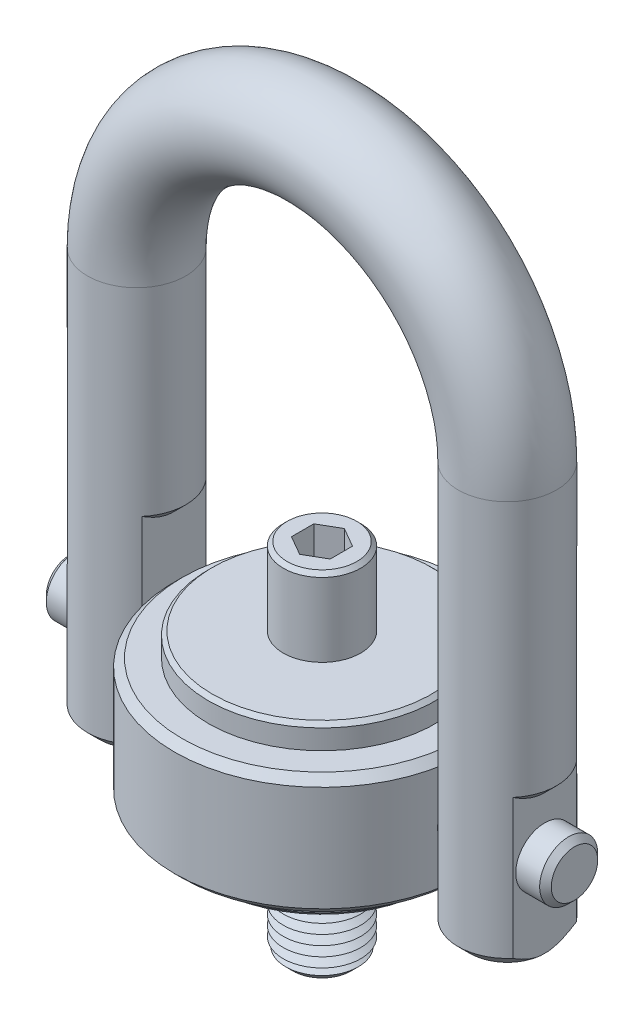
ISO-10303-21;
HEADER;
FILE_DESCRIPTION(('STEP AP214'),'2;1');
FILE_NAME('part.step','',(''),(''),'','','');
FILE_SCHEMA(('AUTOMOTIVE_DESIGN { 1 0 10303 214 1 1 1 1 }'));
ENDSEC;
DATA;
#1=APPLICATION_CONTEXT('core data for automotive mechanical design processes');
#2=APPLICATION_PROTOCOL_DEFINITION('international standard','automotive_design',2000,#1);
#3=PRODUCT_CONTEXT('',#1,'mechanical');
#4=PRODUCT('Part','Part','',(#3));
#5=PRODUCT_RELATED_PRODUCT_CATEGORY('part','',(#4));
#6=PRODUCT_DEFINITION_FORMATION('','',#4);
#7=PRODUCT_DEFINITION_CONTEXT('part definition',#1,'design');
#8=PRODUCT_DEFINITION('design','',#6,#7);
#9=PRODUCT_DEFINITION_SHAPE('','',#8);
#10=(LENGTH_UNIT() NAMED_UNIT(*) SI_UNIT(.MILLI.,.METRE.));
#11=(NAMED_UNIT(*) PLANE_ANGLE_UNIT() SI_UNIT($,.RADIAN.));
#12=(NAMED_UNIT(*) SI_UNIT($,.STERADIAN.) SOLID_ANGLE_UNIT());
#13=UNCERTAINTY_MEASURE_WITH_UNIT(LENGTH_MEASURE(1.E-05),#10,'distance_accuracy_value','');
#14=(GEOMETRIC_REPRESENTATION_CONTEXT(3) GLOBAL_UNCERTAINTY_ASSIGNED_CONTEXT((#13)) GLOBAL_UNIT_ASSIGNED_CONTEXT((#10,
#11,#12)) REPRESENTATION_CONTEXT('',''));
#15=CARTESIAN_POINT('',(0.,0.,0.));
#16=DIRECTION('',(0.,0.,1.));
#17=DIRECTION('',(1.,0.,0.));
#18=AXIS2_PLACEMENT_3D('',#15,#16,#17);
#19=CARTESIAN_POINT('',(65.25,0.,0.));
#20=DIRECTION('',(-1.,0.,0.));
#21=DIRECTION('',(0.,0.,1.));
#22=AXIS2_PLACEMENT_3D('',#19,#20,#21);
#23=CYLINDRICAL_SURFACE('',#22,7.5);
#24=CARTESIAN_POINT('',(-63.75,0.,0.));
#25=DIRECTION('',(1.,0.,0.));
#26=DIRECTION('',(0.,0.,-1.));
#27=AXIS2_PLACEMENT_3D('',#24,#25,#26);
#28=CIRCLE('',#27,7.5);
#29=CARTESIAN_POINT('',(-63.75,0.,-7.5));
#30=VERTEX_POINT('',#29);
#31=EDGE_CURVE('P0_E25',#30,#30,#28,.T.);
#32=ORIENTED_EDGE('',*,*,#31,.T.);
#33=EDGE_LOOP('',(#32));
#34=FACE_BOUND('',#33,.T.);
#35=CARTESIAN_POINT('',(63.75,0.,0.));
#36=DIRECTION('',(1.,0.,0.));
#37=DIRECTION('',(0.,0.,-1.));
#38=AXIS2_PLACEMENT_3D('',#35,#36,#37);
#39=CIRCLE('',#38,7.5);
#40=CARTESIAN_POINT('',(63.75,0.,-7.5));
#41=VERTEX_POINT('',#40);
#42=EDGE_CURVE('P0_E29',#41,#41,#39,.F.);
#43=ORIENTED_EDGE('',*,*,#42,.T.);
#44=EDGE_LOOP('',(#43));
#45=FACE_BOUND('',#44,.T.);
#46=ADVANCED_FACE('P0_F14',(#34,#45),#23,.T.);
#47=CARTESIAN_POINT('',(65.25,0.,0.));
#48=DIRECTION('',(1.,0.,0.));
#49=DIRECTION('',(0.,0.,-1.));
#50=AXIS2_PLACEMENT_3D('',#47,#48,#49);
#51=PLANE('',#50);
#52=CARTESIAN_POINT('',(65.25,0.,0.));
#53=DIRECTION('',(1.,0.,0.));
#54=DIRECTION('',(0.,0.,-1.));
#55=AXIS2_PLACEMENT_3D('',#52,#53,#54);
#56=CIRCLE('',#55,5.99999999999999);
#57=CARTESIAN_POINT('',(65.25,0.,-5.99999999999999));
#58=VERTEX_POINT('',#57);
#59=EDGE_CURVE('P0_E10',#58,#58,#56,.T.);
#60=ORIENTED_EDGE('',*,*,#59,.T.);
#61=EDGE_LOOP('',(#60));
#62=FACE_BOUND('',#61,.T.);
#63=ADVANCED_FACE('P0_F46',(#62),#51,.T.);
#64=CARTESIAN_POINT('',(-65.25,0.,0.));
#65=DIRECTION('',(1.,0.,0.));
#66=DIRECTION('',(0.,0.,-1.));
#67=AXIS2_PLACEMENT_3D('',#64,#65,#66);
#68=PLANE('',#67);
#69=CARTESIAN_POINT('',(-65.25,0.,0.));
#70=DIRECTION('',(1.,0.,0.));
#71=DIRECTION('',(0.,0.,-1.));
#72=AXIS2_PLACEMENT_3D('',#69,#70,#71);
#73=CIRCLE('',#72,5.99999999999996);
#74=CARTESIAN_POINT('',(-65.25,0.,-5.99999999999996));
#75=VERTEX_POINT('',#74);
#76=EDGE_CURVE('P0_E21',#75,#75,#73,.F.);
#77=ORIENTED_EDGE('',*,*,#76,.T.);
#78=EDGE_LOOP('',(#77));
#79=FACE_BOUND('',#78,.T.);
#80=ADVANCED_FACE('P0_F43',(#79),#68,.F.);
#81=CARTESIAN_POINT('',(-63.75,0.,0.));
#82=DIRECTION('',(1.,0.,0.));
#83=DIRECTION('',(0.,0.,-1.));
#84=AXIS2_PLACEMENT_3D('',#81,#82,#83);
#85=CONICAL_SURFACE('',#84,7.5,0.785398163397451);
#86=ORIENTED_EDGE('',*,*,#76,.F.);
#87=EDGE_LOOP('',(#86));
#88=FACE_BOUND('',#87,.T.);
#89=ORIENTED_EDGE('',*,*,#31,.F.);
#90=EDGE_LOOP('',(#89));
#91=FACE_BOUND('',#90,.T.);
#92=ADVANCED_FACE('P0_F38',(#88,#91),#85,.T.);
#93=CARTESIAN_POINT('',(65.25,0.,0.));
#94=DIRECTION('',(-1.,0.,0.));
#95=DIRECTION('',(0.,0.,1.));
#96=AXIS2_PLACEMENT_3D('',#93,#94,#95);
#97=CONICAL_SURFACE('',#96,5.99999999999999,0.785398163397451);
#98=ORIENTED_EDGE('',*,*,#42,.F.);
#99=EDGE_LOOP('',(#98));
#100=FACE_BOUND('',#99,.T.);
#101=ORIENTED_EDGE('',*,*,#59,.F.);
#102=EDGE_LOOP('',(#101));
#103=FACE_BOUND('',#102,.T.);
#104=ADVANCED_FACE('P0_F16',(#100,#103),#97,.T.);
#105=CLOSED_SHELL('',(#46,#63,#80,#92,#104));
#106=MANIFOLD_SOLID_BREP('P0_B1',#105);
#107=CARTESIAN_POINT('',(47.9,-21.7,0.));
#108=DIRECTION('',(0.,-1.,0.));
#109=DIRECTION('',(0.,0.,1.));
#110=AXIS2_PLACEMENT_3D('',#107,#108,#109);
#111=PLANE('',#110);
#112=DIRECTION('',(0.,0.,-1.));
#113=VECTOR('',#112,1.);
#114=CARTESIAN_POINT('',(38.2445611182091,-21.7,8.25));
#115=LINE('',#114,#113);
#116=CARTESIAN_POINT('',(38.2445611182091,-21.7,0.928708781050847));
#117=VERTEX_POINT('',#116);
#118=CARTESIAN_POINT('',(38.2445611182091,-21.7,-0.928708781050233));
#119=VERTEX_POINT('',#118);
#120=EDGE_CURVE('P1_E132',#117,#119,#115,.T.);
#121=ORIENTED_EDGE('',*,*,#120,.T.);
#122=CARTESIAN_POINT('',(47.9,-21.7,0.));
#123=DIRECTION('',(0.,-1.,0.));
#124=DIRECTION('',(1.,0.,0.));
#125=AXIS2_PLACEMENT_3D('',#122,#123,#124);
#126=CIRCLE('',#125,9.69999999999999);
#127=CARTESIAN_POINT('',(57.555438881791,-21.7,-0.928708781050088));
#128=VERTEX_POINT('',#127);
#129=EDGE_CURVE('P1_E192',#119,#128,#126,.T.);
#130=ORIENTED_EDGE('',*,*,#129,.T.);
#131=DIRECTION('',(0.,0.,1.));
#132=VECTOR('',#131,1.);
#133=CARTESIAN_POINT('',(57.555438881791,-21.7,8.25));
#134=LINE('',#133,#132);
#135=CARTESIAN_POINT('',(57.555438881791,-21.7,0.928708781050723));
#136=VERTEX_POINT('',#135);
#137=EDGE_CURVE('P1_E315',#128,#136,#134,.T.);
#138=ORIENTED_EDGE('',*,*,#137,.T.);
#139=CARTESIAN_POINT('',(47.9,-21.7,0.));
#140=DIRECTION('',(0.,-1.,0.));
#141=DIRECTION('',(1.,0.,0.));
#142=AXIS2_PLACEMENT_3D('',#139,#140,#141);
#143=CIRCLE('',#142,9.70000000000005);
#144=CARTESIAN_POINT('',(47.9,-21.7,9.70000000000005));
#145=VERTEX_POINT('',#144);
#146=EDGE_CURVE('P1_E370',#136,#145,#143,.T.);
#147=ORIENTED_EDGE('',*,*,#146,.T.);
#148=CARTESIAN_POINT('',(47.9,-21.7,0.));
#149=DIRECTION('',(0.,-1.,0.));
#150=DIRECTION('',(1.,0.,0.));
#151=AXIS2_PLACEMENT_3D('',#148,#149,#150);
#152=CIRCLE('',#151,9.70000000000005);
#153=EDGE_CURVE('P1_E369',#145,#117,#152,.T.);
#154=ORIENTED_EDGE('',*,*,#153,.T.);
#155=EDGE_LOOP('',(#121,#130,#138,#147,#154));
#156=FACE_BOUND('',#155,.T.);
#157=ADVANCED_FACE('P1_F16',(#156),#111,.T.);
#158=CARTESIAN_POINT('',(47.9,83.5,0.));
#159=DIRECTION('',(0.,-1.,0.));
#160=DIRECTION('',(1.,0.,0.));
#161=AXIS2_PLACEMENT_3D('',#158,#159,#160);
#162=CYLINDRICAL_SURFACE('',#161,12.7);
#163=CARTESIAN_POINT('',(47.9,83.5,0.));
#164=DIRECTION('',(0.,-1.,0.));
#165=DIRECTION('',(0.,0.,1.));
#166=AXIS2_PLACEMENT_3D('',#163,#164,#165);
#167=CIRCLE('',#166,12.7);
#168=CARTESIAN_POINT('',(60.6,83.5,0.));
#169=VERTEX_POINT('',#168);
#170=EDGE_CURVE('P1_E143',#169,#169,#167,.T.);
#171=ORIENTED_EDGE('',*,*,#170,.T.);
#172=EDGE_LOOP('',(#171));
#173=FACE_BOUND('',#172,.T.);
#174=DIRECTION('',(0.,-1.,0.));
#175=VECTOR('',#174,1.);
#176=CARTESIAN_POINT('',(57.555438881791,13.3,-8.25));
#177=LINE('',#176,#175);
#178=CARTESIAN_POINT('',(57.555438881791,17.3000000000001,-8.24999999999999));
#179=VERTEX_POINT('',#178);
#180=CARTESIAN_POINT('',(57.555438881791,-18.7,-8.25));
#181=VERTEX_POINT('',#180);
#182=EDGE_CURVE('P1_E328',#179,#181,#177,.T.);
#183=ORIENTED_EDGE('',*,*,#182,.T.);
#184=CARTESIAN_POINT('',(47.9,-18.7,0.));
#185=DIRECTION('',(0.,-1.,0.));
#186=DIRECTION('',(0.,0.,-1.));
#187=AXIS2_PLACEMENT_3D('',#184,#185,#186);
#188=CIRCLE('',#187,12.7);
#189=CARTESIAN_POINT('',(38.2445611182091,-18.7,-8.25));
#190=VERTEX_POINT('',#189);
#191=EDGE_CURVE('P1_E128',#181,#190,#188,.F.);
#192=ORIENTED_EDGE('',*,*,#191,.T.);
#193=DIRECTION('',(0.,-1.,0.));
#194=VECTOR('',#193,1.);
#195=CARTESIAN_POINT('',(38.2445611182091,28.3,-8.25));
#196=LINE('',#195,#194);
#197=CARTESIAN_POINT('',(38.2445611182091,32.3000000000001,-8.25));
#198=VERTEX_POINT('',#197);
#199=EDGE_CURVE('P1_E120',#198,#190,#196,.T.);
#200=ORIENTED_EDGE('',*,*,#199,.F.);
#201=CARTESIAN_POINT('',(47.9,32.3000000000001,0.));
#202=DIRECTION('',(0.,-1.,0.));
#203=DIRECTION('',(0.,0.,-1.));
#204=AXIS2_PLACEMENT_3D('',#201,#202,#203);
#205=CIRCLE('',#204,12.7);
#206=CARTESIAN_POINT('',(38.2445611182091,32.3000000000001,8.25000000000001));
#207=VERTEX_POINT('',#206);
#208=EDGE_CURVE('P1_E126',#198,#207,#205,.F.);
#209=ORIENTED_EDGE('',*,*,#208,.T.);
#210=DIRECTION('',(0.,-1.,0.));
#211=VECTOR('',#210,1.);
#212=CARTESIAN_POINT('',(38.2445611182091,28.3,8.25));
#213=LINE('',#212,#211);
#214=CARTESIAN_POINT('',(38.2445611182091,-18.7,8.25));
#215=VERTEX_POINT('',#214);
#216=EDGE_CURVE('P1_E131',#207,#215,#213,.T.);
#217=ORIENTED_EDGE('',*,*,#216,.T.);
#218=CARTESIAN_POINT('',(47.9,-18.7,0.));
#219=DIRECTION('',(0.,-1.,0.));
#220=DIRECTION('',(0.,0.,-1.));
#221=AXIS2_PLACEMENT_3D('',#218,#219,#220);
#222=CIRCLE('',#221,12.7);
#223=CARTESIAN_POINT('',(47.9,-18.7,12.7));
#224=VERTEX_POINT('',#223);
#225=EDGE_CURVE('P1_E530',#215,#224,#222,.F.);
#226=ORIENTED_EDGE('',*,*,#225,.T.);
#227=CARTESIAN_POINT('',(47.9,-18.7,0.));
#228=DIRECTION('',(0.,-1.,0.));
#229=DIRECTION('',(0.,0.,-1.));
#230=AXIS2_PLACEMENT_3D('',#227,#228,#229);
#231=CIRCLE('',#230,12.7);
#232=CARTESIAN_POINT('',(57.555438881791,-18.7,8.25));
#233=VERTEX_POINT('',#232);
#234=EDGE_CURVE('P1_E528',#224,#233,#231,.F.);
#235=ORIENTED_EDGE('',*,*,#234,.T.);
#236=DIRECTION('',(0.,-1.,0.));
#237=VECTOR('',#236,1.);
#238=CARTESIAN_POINT('',(57.555438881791,13.3,8.25));
#239=LINE('',#238,#237);
#240=CARTESIAN_POINT('',(57.555438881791,17.3000000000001,8.25));
#241=VERTEX_POINT('',#240);
#242=EDGE_CURVE('P1_E327',#241,#233,#239,.T.);
#243=ORIENTED_EDGE('',*,*,#242,.F.);
#244=CARTESIAN_POINT('',(47.9,17.3000000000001,0.));
#245=DIRECTION('',(0.,-1.,0.));
#246=DIRECTION('',(0.,0.,-1.));
#247=AXIS2_PLACEMENT_3D('',#244,#245,#246);
#248=CIRCLE('',#247,12.7);
#249=EDGE_CURVE('P1_E142',#241,#179,#248,.F.);
#250=ORIENTED_EDGE('',*,*,#249,.T.);
#251=EDGE_LOOP('',(#183,#192,#200,#209,#217,#226,#235,#243,#250));
#252=FACE_BOUND('',#251,.T.);
#253=ADVANCED_FACE('P1_F123',(#173,#252),#162,.T.);
#254=CARTESIAN_POINT('',(-47.9000000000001,-21.7,0.));
#255=DIRECTION('',(0.,1.,0.));
#256=DIRECTION('',(0.,0.,1.));
#257=AXIS2_PLACEMENT_3D('',#254,#255,#256);
#258=PLANE('',#257);
#259=DIRECTION('',(0.,0.,1.));
#260=VECTOR('',#259,1.);
#261=CARTESIAN_POINT('',(-57.555438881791,-21.7,8.25));
#262=LINE('',#261,#260);
#263=CARTESIAN_POINT('',(-57.555438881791,-21.7,-0.92870878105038));
#264=VERTEX_POINT('',#263);
#265=CARTESIAN_POINT('',(-57.555438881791,-21.7,0.928708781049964));
#266=VERTEX_POINT('',#265);
#267=EDGE_CURVE('P1_E334',#264,#266,#262,.T.);
#268=ORIENTED_EDGE('',*,*,#267,.F.);
#269=CARTESIAN_POINT('',(-47.9000000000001,-21.7,0.));
#270=DIRECTION('',(0.,1.,0.));
#271=DIRECTION('',(0.,0.,1.));
#272=AXIS2_PLACEMENT_3D('',#269,#270,#271);
#273=CIRCLE('',#272,9.70000000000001);
#274=CARTESIAN_POINT('',(-38.2445611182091,-21.7,-0.928708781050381));
#275=VERTEX_POINT('',#274);
#276=EDGE_CURVE('P1_E40',#264,#275,#273,.F.);
#277=ORIENTED_EDGE('',*,*,#276,.T.);
#278=DIRECTION('',(0.,0.,-1.));
#279=VECTOR('',#278,1.);
#280=CARTESIAN_POINT('',(-38.2445611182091,-21.7,8.25));
#281=LINE('',#280,#279);
#282=CARTESIAN_POINT('',(-38.2445611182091,-21.7,0.928708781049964));
#283=VERTEX_POINT('',#282);
#284=EDGE_CURVE('P1_E303',#283,#275,#281,.T.);
#285=ORIENTED_EDGE('',*,*,#284,.F.);
#286=CARTESIAN_POINT('',(-47.9000000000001,-21.7,0.));
#287=DIRECTION('',(0.,1.,0.));
#288=DIRECTION('',(0.,0.,1.));
#289=AXIS2_PLACEMENT_3D('',#286,#287,#288);
#290=CIRCLE('',#289,9.69999999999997);
#291=CARTESIAN_POINT('',(-47.9000000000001,-21.7,9.69999999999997));
#292=VERTEX_POINT('',#291);
#293=EDGE_CURVE('P1_E34',#283,#292,#290,.F.);
#294=ORIENTED_EDGE('',*,*,#293,.T.);
#295=CARTESIAN_POINT('',(-47.9000000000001,-21.7,0.));
#296=DIRECTION('',(0.,1.,0.));
#297=DIRECTION('',(0.,0.,1.));
#298=AXIS2_PLACEMENT_3D('',#295,#296,#297);
#299=CIRCLE('',#298,9.69999999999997);
#300=EDGE_CURVE('P1_E298',#292,#266,#299,.F.);
#301=ORIENTED_EDGE('',*,*,#300,.T.);
#302=EDGE_LOOP('',(#268,#277,#285,#294,#301));
#303=FACE_BOUND('',#302,.T.);
#304=ADVANCED_FACE('P1_F239',(#303),#258,.F.);
#305=CARTESIAN_POINT('',(-47.9000000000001,-21.7,0.));
#306=DIRECTION('',(0.,1.,0.));
#307=DIRECTION('',(-1.,0.,0.));
#308=AXIS2_PLACEMENT_3D('',#305,#306,#307);
#309=CYLINDRICAL_SURFACE('',#308,12.7);
#310=DIRECTION('',(0.,-1.,0.));
#311=VECTOR('',#310,1.);
#312=CARTESIAN_POINT('',(-38.2445611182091,28.3,-8.25));
#313=LINE('',#312,#311);
#314=CARTESIAN_POINT('',(-38.2445611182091,32.3,-8.25));
#315=VERTEX_POINT('',#314);
#316=CARTESIAN_POINT('',(-38.2445611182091,-18.7,-8.25));
#317=VERTEX_POINT('',#316);
#318=EDGE_CURVE('P1_E340',#315,#317,#313,.T.);
#319=ORIENTED_EDGE('',*,*,#318,.T.);
#320=CARTESIAN_POINT('',(-47.9000000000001,-18.7,0.));
#321=DIRECTION('',(0.,1.,0.));
#322=DIRECTION('',(0.,0.,1.));
#323=AXIS2_PLACEMENT_3D('',#320,#321,#322);
#324=CIRCLE('',#323,12.7);
#325=CARTESIAN_POINT('',(-57.555438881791,-18.7,-8.25));
#326=VERTEX_POINT('',#325);
#327=EDGE_CURVE('P1_E287',#317,#326,#324,.T.);
#328=ORIENTED_EDGE('',*,*,#327,.T.);
#329=DIRECTION('',(0.,-1.,0.));
#330=VECTOR('',#329,1.);
#331=CARTESIAN_POINT('',(-57.555438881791,13.3,-8.25));
#332=LINE('',#331,#330);
#333=CARTESIAN_POINT('',(-57.555438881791,17.3,-8.24999999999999));
#334=VERTEX_POINT('',#333);
#335=EDGE_CURVE('P1_E337',#334,#326,#332,.T.);
#336=ORIENTED_EDGE('',*,*,#335,.F.);
#337=CARTESIAN_POINT('',(-47.9,17.3,0.));
#338=DIRECTION('',(0.,-1.,0.));
#339=DIRECTION('',(0.,0.,-1.));
#340=AXIS2_PLACEMENT_3D('',#337,#338,#339);
#341=CIRCLE('',#340,12.7);
#342=CARTESIAN_POINT('',(-57.555438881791,17.3,8.24999999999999));
#343=VERTEX_POINT('',#342);
#344=EDGE_CURVE('P1_E146',#334,#343,#341,.F.);
#345=ORIENTED_EDGE('',*,*,#344,.T.);
#346=DIRECTION('',(0.,-1.,0.));
#347=VECTOR('',#346,1.);
#348=CARTESIAN_POINT('',(-57.555438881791,13.3,8.25));
#349=LINE('',#348,#347);
#350=CARTESIAN_POINT('',(-57.555438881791,-18.7,8.25));
#351=VERTEX_POINT('',#350);
#352=EDGE_CURVE('P1_E308',#343,#351,#349,.T.);
#353=ORIENTED_EDGE('',*,*,#352,.T.);
#354=CARTESIAN_POINT('',(-47.9000000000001,-18.7,0.));
#355=DIRECTION('',(0.,1.,0.));
#356=DIRECTION('',(0.,0.,1.));
#357=AXIS2_PLACEMENT_3D('',#354,#355,#356);
#358=CIRCLE('',#357,12.7);
#359=CARTESIAN_POINT('',(-47.9000000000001,-18.7,12.7));
#360=VERTEX_POINT('',#359);
#361=EDGE_CURVE('P1_E284',#351,#360,#358,.T.);
#362=ORIENTED_EDGE('',*,*,#361,.T.);
#363=CARTESIAN_POINT('',(-47.9000000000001,-18.7,0.));
#364=DIRECTION('',(0.,1.,0.));
#365=DIRECTION('',(0.,0.,1.));
#366=AXIS2_PLACEMENT_3D('',#363,#364,#365);
#367=CIRCLE('',#366,12.7);
#368=CARTESIAN_POINT('',(-38.2445611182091,-18.7,8.25));
#369=VERTEX_POINT('',#368);
#370=EDGE_CURVE('P1_E277',#360,#369,#367,.T.);
#371=ORIENTED_EDGE('',*,*,#370,.T.);
#372=DIRECTION('',(0.,-1.,0.));
#373=VECTOR('',#372,1.);
#374=CARTESIAN_POINT('',(-38.2445611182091,28.3,8.25));
#375=LINE('',#374,#373);
#376=CARTESIAN_POINT('',(-38.2445611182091,32.3,8.25));
#377=VERTEX_POINT('',#376);
#378=EDGE_CURVE('P1_E305',#377,#369,#375,.T.);
#379=ORIENTED_EDGE('',*,*,#378,.F.);
#380=CARTESIAN_POINT('',(-47.9,32.3,0.));
#381=DIRECTION('',(0.,-1.,0.));
#382=DIRECTION('',(0.,0.,-1.));
#383=AXIS2_PLACEMENT_3D('',#380,#381,#382);
#384=CIRCLE('',#383,12.7);
#385=EDGE_CURVE('P1_E155',#377,#315,#384,.F.);
#386=ORIENTED_EDGE('',*,*,#385,.T.);
#387=EDGE_LOOP('',(#319,#328,#336,#345,#353,#362,#371,#379,#386));
#388=FACE_BOUND('',#387,.T.);
#389=CARTESIAN_POINT('',(-47.9,83.5,0.));
#390=DIRECTION('',(0.,1.,0.));
#391=DIRECTION('',(0.,0.,1.));
#392=AXIS2_PLACEMENT_3D('',#389,#390,#391);
#393=CIRCLE('',#392,12.7);
#394=CARTESIAN_POINT('',(-60.6000000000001,83.5,0.));
#395=VERTEX_POINT('',#394);
#396=EDGE_CURVE('P1_E149',#395,#395,#393,.T.);
#397=ORIENTED_EDGE('',*,*,#396,.F.);
#398=EDGE_LOOP('',(#397));
#399=FACE_BOUND('',#398,.T.);
#400=ADVANCED_FACE('P1_F241',(#388,#399),#309,.T.);
#401=CARTESIAN_POINT('',(0.,83.5,0.));
#402=DIRECTION('',(0.,0.,-1.));
#403=DIRECTION('',(-1.,0.,0.));
#404=AXIS2_PLACEMENT_3D('',#401,#402,#403);
#405=TOROIDAL_SURFACE('',#404,47.9,12.7);
#406=CARTESIAN_POINT('',(0.,83.5,0.));
#407=DIRECTION('',(0.,0.,-1.));
#408=DIRECTION('',(-1.,0.,0.));
#409=AXIS2_PLACEMENT_3D('',#406,#407,#408);
#410=CIRCLE('',#409,60.6000000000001);
#411=EDGE_CURVE('',#395,#169,#410,.T.);
#412=ORIENTED_EDGE('',*,*,#396,.T.);
#413=ORIENTED_EDGE('',*,*,#170,.F.);
#414=ORIENTED_EDGE('',*,*,#411,.T.);
#415=ORIENTED_EDGE('',*,*,#411,.F.);
#416=EDGE_LOOP('',(#412,#414,#413,#415));
#417=FACE_BOUND('',#416,.T.);
#418=ADVANCED_FACE('P1_F237',(#417),#405,.T.);
#419=CARTESIAN_POINT('',(-38.2445611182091,28.3,8.25));
#420=DIRECTION('',(-1.,0.,0.));
#421=DIRECTION('',(0.,0.,1.));
#422=AXIS2_PLACEMENT_3D('',#419,#420,#421);
#423=PLANE('',#422);
#424=CARTESIAN_POINT('',(-38.2445611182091,0.,0.));
#425=DIRECTION('',(-1.,0.,0.));
#426=DIRECTION('',(0.,0.,1.));
#427=AXIS2_PLACEMENT_3D('',#424,#425,#426);
#428=CIRCLE('',#427,7.5);
#429=CARTESIAN_POINT('',(-38.2445611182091,0.,-7.5));
#430=VERTEX_POINT('',#429);
#431=EDGE_CURVE('P1_E313',#430,#430,#428,.T.);
#432=ORIENTED_EDGE('',*,*,#431,.T.);
#433=EDGE_LOOP('',(#432));
#434=FACE_BOUND('',#433,.T.);
#435=ORIENTED_EDGE('',*,*,#284,.T.);
#436=CARTESIAN_POINT('',(-38.2445611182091,-21.7,-0.928708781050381));
#437=CARTESIAN_POINT('',(-38.2445611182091,-21.6844845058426,-1.0909535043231));
#438=CARTESIAN_POINT('',(-38.2445611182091,-21.6649380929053,-1.25279346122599));
#439=CARTESIAN_POINT('',(-38.2445611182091,-21.6181924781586,-1.57531409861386));
#440=CARTESIAN_POINT('',(-38.2445611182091,-21.5909957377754,-1.73599513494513));
#441=CARTESIAN_POINT('',(-38.2445611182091,-21.5294234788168,-2.05556125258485));
#442=CARTESIAN_POINT('',(-38.2445611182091,-21.4950656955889,-2.21444976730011));
#443=CARTESIAN_POINT('',(-38.2445611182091,-21.419620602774,-2.53062146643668));
#444=CARTESIAN_POINT('',(-38.2445611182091,-21.3785327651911,-2.68790452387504));
#445=CARTESIAN_POINT('',(-38.2445611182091,-21.2471243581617,-3.15293445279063));
#446=CARTESIAN_POINT('',(-38.2445611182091,-21.1478021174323,-3.4581643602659));
#447=CARTESIAN_POINT('',(-38.2445611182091,-20.9289398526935,-4.061371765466));
#448=CARTESIAN_POINT('',(-38.2445611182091,-20.809386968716,-4.35934451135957));
#449=CARTESIAN_POINT('',(-38.2445611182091,-20.5461292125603,-4.96568309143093));
#450=CARTESIAN_POINT('',(-38.2445611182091,-20.4014074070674,-5.27360443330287));
#451=CARTESIAN_POINT('',(-38.2445611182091,-20.0971002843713,-5.88195737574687));
#452=CARTESIAN_POINT('',(-38.2445611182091,-19.9375143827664,-6.18238868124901));
#453=CARTESIAN_POINT('',(-38.2445611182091,-19.6039515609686,-6.78099899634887));
#454=CARTESIAN_POINT('',(-38.2445611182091,-19.4297957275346,-7.07907784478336));
#455=CARTESIAN_POINT('',(-38.2445611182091,-19.1612257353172,-7.52155488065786));
#456=CARTESIAN_POINT('',(-38.2445611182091,-19.0705137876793,-7.66822154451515));
#457=CARTESIAN_POINT('',(-38.2445611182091,-18.8868671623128,-7.96014117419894));
#458=CARTESIAN_POINT('',(-38.2445611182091,-18.7939326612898,-8.10539425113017));
#459=CARTESIAN_POINT('',(-38.2445611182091,-18.7,-8.25));
#460=B_SPLINE_CURVE_WITH_KNOTS('',3,(#436,#437,#438,#439,#440,#441,#442,#443,#444,#445,#446,
#447,#448,#449,#450,#451,#452,#453,#454,#455,#456,#457,#458,#459),.UNSPECIFIED.,.F.,.F.,(4,2,2,
2,2,2,2,2,2,2,2,4),(0.,0.488876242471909,0.977595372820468,1.46511820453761,1.95267930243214,
2.91468065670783,3.87729583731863,4.89749204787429,5.91772838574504,6.95315742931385,
7.47049833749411,7.98779825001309),.UNSPECIFIED.);
#461=EDGE_CURVE('P1_E11',#275,#317,#460,.T.);
#462=ORIENTED_EDGE('',*,*,#461,.T.);
#463=ORIENTED_EDGE('',*,*,#318,.F.);
#464=CARTESIAN_POINT('',(-38.2445611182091,32.3,-8.25));
#465=CARTESIAN_POINT('',(-38.2445611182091,32.1703674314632,-8.05041043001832));
#466=CARTESIAN_POINT('',(-38.2445611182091,32.0426084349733,-7.84958462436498));
#467=CARTESIAN_POINT('',(-38.2445611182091,31.7914840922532,-7.44513716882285));
#468=CARTESIAN_POINT('',(-38.2445611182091,31.6681198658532,-7.24151482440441));
#469=CARTESIAN_POINT('',(-38.2445611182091,31.4259059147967,-6.83024655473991));
#470=CARTESIAN_POINT('',(-38.2445611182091,31.3070812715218,-6.62258580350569));
#471=CARTESIAN_POINT('',(-38.2445611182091,31.0754529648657,-6.20394504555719));
#472=CARTESIAN_POINT('',(-38.2445611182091,30.9626489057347,-5.9929652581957));
#473=CARTESIAN_POINT('',(-38.2445611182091,30.7415767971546,-5.56256117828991));
#474=CARTESIAN_POINT('',(-38.2445611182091,30.6334691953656,-5.34305383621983));
#475=CARTESIAN_POINT('',(-38.2445611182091,30.4258619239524,-4.90001001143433));
#476=CARTESIAN_POINT('',(-38.2445611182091,30.3263630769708,-4.67647314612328));
#477=CARTESIAN_POINT('',(-38.2445611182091,30.0433036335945,-4.00030114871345));
#478=CARTESIAN_POINT('',(-38.2445611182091,29.8746592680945,-3.54111751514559));
#479=CARTESIAN_POINT('',(-38.2445611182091,29.6480567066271,-2.79408739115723));
#480=CARTESIAN_POINT('',(-38.2445611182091,29.5728407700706,-2.51144576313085));
#481=CARTESIAN_POINT('',(-38.2445611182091,29.4446870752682,-1.94101534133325));
#482=CARTESIAN_POINT('',(-38.2445611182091,29.3917526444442,-1.6532257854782));
#483=CARTESIAN_POINT('',(-38.2445611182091,29.3110934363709,-1.07642822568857));
#484=CARTESIAN_POINT('',(-38.2445611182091,29.2831716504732,-0.787448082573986));
#485=CARTESIAN_POINT('',(-38.2445611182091,29.2533586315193,-0.208244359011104));
#486=CARTESIAN_POINT('',(-38.2445611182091,29.2514547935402,0.0819785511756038));
#487=CARTESIAN_POINT('',(-38.2445611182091,29.2707798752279,0.584752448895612));
#488=CARTESIAN_POINT('',(-38.2445611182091,29.2860266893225,0.797554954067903));
#489=CARTESIAN_POINT('',(-38.2445611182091,29.3301499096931,1.22182954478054));
#490=CARTESIAN_POINT('',(-38.2445611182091,29.3590327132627,1.43330095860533));
#491=CARTESIAN_POINT('',(-38.2445611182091,29.4532152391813,1.99441776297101));
#492=CARTESIAN_POINT('',(-38.2445611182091,29.5299558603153,2.34217500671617));
#493=CARTESIAN_POINT('',(-38.2445611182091,29.7141427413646,3.02959280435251));
#494=CARTESIAN_POINT('',(-38.2445611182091,29.8216178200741,3.36924543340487));
#495=CARTESIAN_POINT('',(-38.2445611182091,30.062347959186,4.04131756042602));
#496=CARTESIAN_POINT('',(-38.2445611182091,30.195744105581,4.37368586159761));
#497=CARTESIAN_POINT('',(-38.2445611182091,30.4827859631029,5.02935906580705));
#498=CARTESIAN_POINT('',(-38.2445611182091,30.6364264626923,5.35266627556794));
#499=CARTESIAN_POINT('',(-38.2445611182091,30.9111704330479,5.89508828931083));
#500=CARTESIAN_POINT('',(-38.2445611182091,31.0281703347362,6.11630738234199));
#501=CARTESIAN_POINT('',(-38.2445611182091,31.2688724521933,6.55505345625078));
#502=CARTESIAN_POINT('',(-38.2445611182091,31.3925743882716,6.7725805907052));
#503=CARTESIAN_POINT('',(-38.2445611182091,31.6442229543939,7.20178561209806));
#504=CARTESIAN_POINT('',(-38.2445611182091,31.7721041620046,7.41350202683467));
#505=CARTESIAN_POINT('',(-38.2445611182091,32.0326509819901,7.83392319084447));
#506=CARTESIAN_POINT('',(-38.2445611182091,32.1653157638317,8.04262845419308));
#507=CARTESIAN_POINT('',(-38.2445611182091,32.3,8.25000000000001));
#508=B_SPLINE_CURVE_WITH_KNOTS('',3,(#464,#465,#466,#467,#468,#469,#470,#471,#472,#473,#474,
#475,#476,#477,#478,#479,#480,#481,#482,#483,#484,#485,#486,#487,#488,#489,#490,#491,#492,#493,
#494,#495,#496,#497,#498,#499,#500,#501,#502,#503,#504,#505,#506,#507),.UNSPECIFIED.,.F.,.F.,(4,
2,2,2,2,2,2,2,2,2,2,2,2,2,2,2,2,2,2,2,2,4),(0.,0.713991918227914,1.42816448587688,
2.14583629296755,2.86346086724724,3.59732743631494,4.33126405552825,5.79579808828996,
6.67250509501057,7.5493429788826,8.41921225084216,9.28866008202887,9.92826925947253,
10.568178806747,11.6347696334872,12.7023638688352,13.7759404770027,14.8492412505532,
15.5998864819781,16.3505004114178,17.0924559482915,17.8342832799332),.UNSPECIFIED.);
#509=EDGE_CURVE('P1_E138',#315,#377,#508,.T.);
#510=ORIENTED_EDGE('',*,*,#509,.T.);
#511=ORIENTED_EDGE('',*,*,#378,.T.);
#512=CARTESIAN_POINT('',(-38.2445611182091,-18.7,8.25));
#513=CARTESIAN_POINT('',(-38.2445611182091,-18.8286157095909,8.05197686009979));
#514=CARTESIAN_POINT('',(-38.2445611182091,-18.9553865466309,7.85273665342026));
#515=CARTESIAN_POINT('',(-38.2445611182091,-19.2046095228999,7.45150438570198));
#516=CARTESIAN_POINT('',(-38.2445611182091,-19.3270605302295,7.24951162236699));
#517=CARTESIAN_POINT('',(-38.2445611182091,-19.5674840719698,6.84164865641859));
#518=CARTESIAN_POINT('',(-38.2445611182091,-19.6854341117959,6.63576514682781));
#519=CARTESIAN_POINT('',(-38.2445611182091,-19.9154326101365,6.22074234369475));
#520=CARTESIAN_POINT('',(-38.2445611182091,-20.0274815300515,6.01160330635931));
#521=CARTESIAN_POINT('',(-38.2445611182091,-20.2420878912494,5.59487426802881));
#522=CARTESIAN_POINT('',(-38.2445611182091,-20.3448094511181,5.38736935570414));
#523=CARTESIAN_POINT('',(-38.2445611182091,-20.5426463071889,4.96876868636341));
#524=CARTESIAN_POINT('',(-38.2445611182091,-20.6377608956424,4.75767259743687));
#525=CARTESIAN_POINT('',(-38.2445611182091,-20.9095677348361,4.11942628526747));
#526=CARTESIAN_POINT('',(-38.2445611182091,-21.0731837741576,3.68644448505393));
#527=CARTESIAN_POINT('',(-38.2445611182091,-21.273218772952,3.05871449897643));
#528=CARTESIAN_POINT('',(-38.2445611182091,-21.3287240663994,2.86995086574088));
#529=CARTESIAN_POINT('',(-38.2445611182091,-21.4303684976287,2.48989716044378));
#530=CARTESIAN_POINT('',(-38.2445611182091,-21.4765079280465,2.29860716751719));
#531=CARTESIAN_POINT('',(-38.2445611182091,-21.5589126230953,1.9119275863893));
#532=CARTESIAN_POINT('',(-38.2445611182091,-21.5950762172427,1.71651617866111));
#533=CARTESIAN_POINT('',(-38.2445611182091,-21.6561692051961,1.32384658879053));
#534=CARTESIAN_POINT('',(-38.2445611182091,-21.6810926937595,1.12658749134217));
#535=CARTESIAN_POINT('',(-38.2445611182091,-21.7,0.928708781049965));
#536=B_SPLINE_CURVE_WITH_KNOTS('',3,(#512,#513,#514,#515,#516,#517,#518,#519,#520,#521,#522,
#523,#524,#525,#526,#527,#528,#529,#530,#531,#532,#533,#534,#535),.UNSPECIFIED.,.F.,.F.,(4,2,2,
2,2,2,2,2,2,2,2,4),(0.,0.708388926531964,1.41696210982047,2.12870631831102,2.84039479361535,
3.53485251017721,4.22937476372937,5.61546327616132,6.20554336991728,6.79560502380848,
7.39147513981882,7.98765794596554),.UNSPECIFIED.);
#537=EDGE_CURVE('P1_E26',#369,#283,#536,.T.);
#538=ORIENTED_EDGE('',*,*,#537,.T.);
#539=EDGE_LOOP('',(#435,#462,#463,#510,#511,#538));
#540=FACE_BOUND('',#539,.T.);
#541=ADVANCED_FACE('P1_F232',(#434,#540),#423,.F.);
#542=CARTESIAN_POINT('',(-57.555438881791,13.3,8.25));
#543=DIRECTION('',(1.,0.,0.));
#544=DIRECTION('',(0.,0.,-1.));
#545=AXIS2_PLACEMENT_3D('',#542,#543,#544);
#546=PLANE('',#545);
#547=CARTESIAN_POINT('',(-57.555438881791,0.,0.));
#548=DIRECTION('',(1.,0.,0.));
#549=DIRECTION('',(0.,0.,-1.));
#550=AXIS2_PLACEMENT_3D('',#547,#548,#549);
#551=CIRCLE('',#550,7.5);
#552=CARTESIAN_POINT('',(-57.555438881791,0.,-7.5));
#553=VERTEX_POINT('',#552);
#554=EDGE_CURVE('P1_E321',#553,#553,#551,.F.);
#555=ORIENTED_EDGE('',*,*,#554,.F.);
#556=EDGE_LOOP('',(#555));
#557=FACE_BOUND('',#556,.T.);
#558=ORIENTED_EDGE('',*,*,#335,.T.);
#559=CARTESIAN_POINT('',(-57.555438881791,-18.7,-8.25));
#560=CARTESIAN_POINT('',(-57.555438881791,-18.8286157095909,-8.05197686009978));
#561=CARTESIAN_POINT('',(-57.555438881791,-18.955386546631,-7.85273665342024));
#562=CARTESIAN_POINT('',(-57.555438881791,-19.2046095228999,-7.45150438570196));
#563=CARTESIAN_POINT('',(-57.555438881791,-19.3270605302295,-7.24951162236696));
#564=CARTESIAN_POINT('',(-57.555438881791,-19.5674840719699,-6.84164865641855));
#565=CARTESIAN_POINT('',(-57.555438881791,-19.685434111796,-6.63576514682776));
#566=CARTESIAN_POINT('',(-57.555438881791,-19.9154326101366,-6.22074234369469));
#567=CARTESIAN_POINT('',(-57.555438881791,-20.0274815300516,-6.01160330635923));
#568=CARTESIAN_POINT('',(-57.555438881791,-20.2420878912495,-5.59487426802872));
#569=CARTESIAN_POINT('',(-57.555438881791,-20.3448094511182,-5.38736935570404));
#570=CARTESIAN_POINT('',(-57.555438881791,-20.542646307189,-4.9687686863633));
#571=CARTESIAN_POINT('',(-57.555438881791,-20.6377608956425,-4.75767259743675));
#572=CARTESIAN_POINT('',(-57.555438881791,-20.9095677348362,-4.11942628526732));
#573=CARTESIAN_POINT('',(-57.555438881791,-21.0731837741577,-3.68644448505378));
#574=CARTESIAN_POINT('',(-57.555438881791,-21.2732187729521,-3.0587144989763));
#575=CARTESIAN_POINT('',(-57.555438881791,-21.3287240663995,-2.8699508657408));
#576=CARTESIAN_POINT('',(-57.555438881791,-21.4303684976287,-2.48989716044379));
#577=CARTESIAN_POINT('',(-57.555438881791,-21.4765079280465,-2.29860716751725));
#578=CARTESIAN_POINT('',(-57.555438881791,-21.5589126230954,-1.91192758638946));
#579=CARTESIAN_POINT('',(-57.555438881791,-21.5950762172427,-1.71651617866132));
#580=CARTESIAN_POINT('',(-57.555438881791,-21.6561692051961,-1.32384658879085));
#581=CARTESIAN_POINT('',(-57.555438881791,-21.6810926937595,-1.12658749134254));
#582=CARTESIAN_POINT('',(-57.555438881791,-21.7,-0.928708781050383));
#583=B_SPLINE_CURVE_WITH_KNOTS('',3,(#559,#560,#561,#562,#563,#564,#565,#566,#567,#568,#569,
#570,#571,#572,#573,#574,#575,#576,#577,#578,#579,#580,#581,#582),.UNSPECIFIED.,.F.,.F.,(4,2,2,
2,2,2,2,2,2,2,2,4),(0.,0.708388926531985,1.41696210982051,2.12870631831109,2.84039479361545,
3.53485251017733,4.22937476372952,5.61546327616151,6.20554336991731,6.79560502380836,
7.39147513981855,7.98765794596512),.UNSPECIFIED.);
#584=EDGE_CURVE('P1_E216',#326,#264,#583,.T.);
#585=ORIENTED_EDGE('',*,*,#584,.T.);
#586=ORIENTED_EDGE('',*,*,#267,.T.);
#587=CARTESIAN_POINT('',(-57.555438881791,-21.7,0.928708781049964));
#588=CARTESIAN_POINT('',(-57.555438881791,-21.6844845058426,1.09095350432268));
#589=CARTESIAN_POINT('',(-57.555438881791,-21.6649380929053,1.25279346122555));
#590=CARTESIAN_POINT('',(-57.555438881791,-21.6181924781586,1.57531409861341));
#591=CARTESIAN_POINT('',(-57.555438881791,-21.5909957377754,1.73599513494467));
#592=CARTESIAN_POINT('',(-57.555438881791,-21.5294234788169,2.05556125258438));
#593=CARTESIAN_POINT('',(-57.555438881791,-21.4950656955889,2.21444976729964));
#594=CARTESIAN_POINT('',(-57.555438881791,-21.419620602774,2.5306214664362));
#595=CARTESIAN_POINT('',(-57.555438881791,-21.3785327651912,2.68790452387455));
#596=CARTESIAN_POINT('',(-57.555438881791,-21.2471243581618,3.15293445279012));
#597=CARTESIAN_POINT('',(-57.555438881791,-21.1478021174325,3.45816436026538));
#598=CARTESIAN_POINT('',(-57.555438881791,-20.9289398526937,4.06137176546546));
#599=CARTESIAN_POINT('',(-57.555438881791,-20.8093869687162,4.35934451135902));
#600=CARTESIAN_POINT('',(-57.555438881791,-20.5461292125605,4.96568309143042));
#601=CARTESIAN_POINT('',(-57.555438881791,-20.4014074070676,5.27360443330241));
#602=CARTESIAN_POINT('',(-57.555438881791,-20.0971002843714,5.8819573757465));
#603=CARTESIAN_POINT('',(-57.555438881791,-19.9375143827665,6.18238868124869));
#604=CARTESIAN_POINT('',(-57.555438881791,-19.6039515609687,6.78099899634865));
#605=CARTESIAN_POINT('',(-57.555438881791,-19.4297957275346,7.07907784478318));
#606=CARTESIAN_POINT('',(-57.555438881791,-19.1612257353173,7.52155488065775));
#607=CARTESIAN_POINT('',(-57.555438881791,-19.0705137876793,7.66822154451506));
#608=CARTESIAN_POINT('',(-57.555438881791,-18.8868671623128,7.96014117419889));
#609=CARTESIAN_POINT('',(-57.555438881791,-18.7939326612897,8.10539425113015));
#610=CARTESIAN_POINT('',(-57.555438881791,-18.7,8.25));
#611=B_SPLINE_CURVE_WITH_KNOTS('',3,(#587,#588,#589,#590,#591,#592,#593,#594,#595,#596,#597,
#598,#599,#600,#601,#602,#603,#604,#605,#606,#607,#608,#609,#610),.UNSPECIFIED.,.F.,.F.,(4,2,2,
2,2,2,2,2,2,2,2,4),(0.,0.488876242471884,0.977595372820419,1.46511820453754,1.95267930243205,
2.91468065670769,3.87729583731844,4.89749204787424,5.91772838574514,6.95315742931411,
7.47049833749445,7.98779825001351),.UNSPECIFIED.);
#612=EDGE_CURVE('P1_E289',#266,#351,#611,.T.);
#613=ORIENTED_EDGE('',*,*,#612,.T.);
#614=ORIENTED_EDGE('',*,*,#352,.F.);
#615=CARTESIAN_POINT('',(-57.555438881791,17.3,8.24999999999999));
#616=CARTESIAN_POINT('',(-57.555438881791,17.1703674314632,8.05041043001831));
#617=CARTESIAN_POINT('',(-57.555438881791,17.0426084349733,7.84958462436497));
#618=CARTESIAN_POINT('',(-57.555438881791,16.7914840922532,7.44513716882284));
#619=CARTESIAN_POINT('',(-57.555438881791,16.6681198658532,7.24151482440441));
#620=CARTESIAN_POINT('',(-57.555438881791,16.4259059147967,6.8302465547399));
#621=CARTESIAN_POINT('',(-57.555438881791,16.3070812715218,6.62258580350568));
#622=CARTESIAN_POINT('',(-57.555438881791,16.0754529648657,6.20394504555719));
#623=CARTESIAN_POINT('',(-57.555438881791,15.9626489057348,5.99296525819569));
#624=CARTESIAN_POINT('',(-57.555438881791,15.7415767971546,5.5625611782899));
#625=CARTESIAN_POINT('',(-57.555438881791,15.6334691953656,5.34305383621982));
#626=CARTESIAN_POINT('',(-57.555438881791,15.4258619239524,4.90001001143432));
#627=CARTESIAN_POINT('',(-57.555438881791,15.3263630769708,4.67647314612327));
#628=CARTESIAN_POINT('',(-57.555438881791,15.0433036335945,4.00030114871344));
#629=CARTESIAN_POINT('',(-57.555438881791,14.8746592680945,3.54111751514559));
#630=CARTESIAN_POINT('',(-57.555438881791,14.6480567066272,2.79408739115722));
#631=CARTESIAN_POINT('',(-57.555438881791,14.5728407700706,2.51144576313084));
#632=CARTESIAN_POINT('',(-57.555438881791,14.4446870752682,1.94101534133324));
#633=CARTESIAN_POINT('',(-57.555438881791,14.3917526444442,1.65322578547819));
#634=CARTESIAN_POINT('',(-57.555438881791,14.3110934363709,1.07642822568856));
#635=CARTESIAN_POINT('',(-57.555438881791,14.2831716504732,0.787448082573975));
#636=CARTESIAN_POINT('',(-57.555438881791,14.2533586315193,0.208244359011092));
#637=CARTESIAN_POINT('',(-57.555438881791,14.2514547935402,-0.0819785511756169));
#638=CARTESIAN_POINT('',(-57.555438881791,14.2707798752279,-0.584752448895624));
#639=CARTESIAN_POINT('',(-57.555438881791,14.2860266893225,-0.797554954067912));
#640=CARTESIAN_POINT('',(-57.555438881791,14.3301499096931,-1.22182954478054));
#641=CARTESIAN_POINT('',(-57.555438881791,14.3590327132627,-1.43330095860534));
#642=CARTESIAN_POINT('',(-57.555438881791,14.4532152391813,-1.99441776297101));
#643=CARTESIAN_POINT('',(-57.555438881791,14.5299558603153,-2.34217500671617));
#644=CARTESIAN_POINT('',(-57.555438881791,14.7141427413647,-3.02959280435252));
#645=CARTESIAN_POINT('',(-57.555438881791,14.8216178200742,-3.36924543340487));
#646=CARTESIAN_POINT('',(-57.555438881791,15.062347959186,-4.04131756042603));
#647=CARTESIAN_POINT('',(-57.555438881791,15.195744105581,-4.37368586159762));
#648=CARTESIAN_POINT('',(-57.555438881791,15.482785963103,-5.02935906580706));
#649=CARTESIAN_POINT('',(-57.555438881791,15.6364264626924,-5.35266627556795));
#650=CARTESIAN_POINT('',(-57.555438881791,15.9111704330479,-5.89508828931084));
#651=CARTESIAN_POINT('',(-57.555438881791,16.0281703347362,-6.116307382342));
#652=CARTESIAN_POINT('',(-57.555438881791,16.2688724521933,-6.55505345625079));
#653=CARTESIAN_POINT('',(-57.555438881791,16.3925743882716,-6.77258059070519));
#654=CARTESIAN_POINT('',(-57.555438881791,16.6442229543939,-7.20178561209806));
#655=CARTESIAN_POINT('',(-57.555438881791,16.7721041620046,-7.41350202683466));
#656=CARTESIAN_POINT('',(-57.555438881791,17.0326509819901,-7.83392319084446));
#657=CARTESIAN_POINT('',(-57.555438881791,17.1653157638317,-8.04262845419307));
#658=CARTESIAN_POINT('',(-57.555438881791,17.3,-8.24999999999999));
#659=B_SPLINE_CURVE_WITH_KNOTS('',3,(#615,#616,#617,#618,#619,#620,#621,#622,#623,#624,#625,
#626,#627,#628,#629,#630,#631,#632,#633,#634,#635,#636,#637,#638,#639,#640,#641,#642,#643,#644,
#645,#646,#647,#648,#649,#650,#651,#652,#653,#654,#655,#656,#657,#658),.UNSPECIFIED.,.F.,.F.,(4,
2,2,2,2,2,2,2,2,2,2,2,2,2,2,2,2,2,2,2,2,4),(0.,0.713991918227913,1.42816448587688,
2.14583629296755,2.86346086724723,3.59732743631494,4.33126405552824,5.79579808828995,
6.67250509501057,7.54934297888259,8.41921225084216,9.28866008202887,9.92826925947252,
10.568178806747,11.6347696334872,12.7023638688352,13.7759404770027,14.8492412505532,
15.5998864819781,16.3505004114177,17.0924559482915,17.8342832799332),.UNSPECIFIED.);
#660=EDGE_CURVE('P1_E251',#343,#334,#659,.T.);
#661=ORIENTED_EDGE('',*,*,#660,.T.);
#662=EDGE_LOOP('',(#558,#585,#586,#613,#614,#661));
#663=FACE_BOUND('',#662,.T.);
#664=ADVANCED_FACE('P1_F236',(#557,#663),#546,.F.);
#665=CARTESIAN_POINT('',(38.2445611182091,28.3,8.25));
#666=DIRECTION('',(-1.,0.,0.));
#667=DIRECTION('',(0.,0.,1.));
#668=AXIS2_PLACEMENT_3D('',#665,#666,#667);
#669=PLANE('',#668);
#670=CARTESIAN_POINT('',(38.2445611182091,0.,0.));
#671=DIRECTION('',(-1.,0.,0.));
#672=DIRECTION('',(0.,0.,1.));
#673=AXIS2_PLACEMENT_3D('',#670,#671,#672);
#674=CIRCLE('',#673,7.5);
#675=CARTESIAN_POINT('',(38.2445611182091,0.,-7.5));
#676=VERTEX_POINT('',#675);
#677=EDGE_CURVE('P1_E317',#676,#676,#674,.T.);
#678=ORIENTED_EDGE('',*,*,#677,.F.);
#679=EDGE_LOOP('',(#678));
#680=FACE_BOUND('',#679,.T.);
#681=ORIENTED_EDGE('',*,*,#199,.T.);
#682=CARTESIAN_POINT('',(38.2445611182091,-18.7,-8.25));
#683=CARTESIAN_POINT('',(38.2445611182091,-18.8286157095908,-8.05197686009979));
#684=CARTESIAN_POINT('',(38.2445611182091,-18.9553865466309,-7.85273665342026));
#685=CARTESIAN_POINT('',(38.2445611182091,-19.2046095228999,-7.45150438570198));
#686=CARTESIAN_POINT('',(38.2445611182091,-19.3270605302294,-7.24951162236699));
#687=CARTESIAN_POINT('',(38.2445611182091,-19.5674840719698,-6.84164865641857));
#688=CARTESIAN_POINT('',(38.2445611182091,-19.6854341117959,-6.63576514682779));
#689=CARTESIAN_POINT('',(38.2445611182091,-19.9154326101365,-6.22074234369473));
#690=CARTESIAN_POINT('',(38.2445611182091,-20.0274815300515,-6.01160330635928));
#691=CARTESIAN_POINT('',(38.2445611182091,-20.2420878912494,-5.59487426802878));
#692=CARTESIAN_POINT('',(38.2445611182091,-20.3448094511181,-5.3873693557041));
#693=CARTESIAN_POINT('',(38.2445611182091,-20.5426463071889,-4.96876868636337));
#694=CARTESIAN_POINT('',(38.2445611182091,-20.6377608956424,-4.75767259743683));
#695=CARTESIAN_POINT('',(38.2445611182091,-20.9095677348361,-4.11942628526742));
#696=CARTESIAN_POINT('',(38.2445611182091,-21.0731837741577,-3.68644448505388));
#697=CARTESIAN_POINT('',(38.2445611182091,-21.273218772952,-3.05871449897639));
#698=CARTESIAN_POINT('',(38.2445611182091,-21.3287240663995,-2.86995086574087));
#699=CARTESIAN_POINT('',(38.2445611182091,-21.4303684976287,-2.48989716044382));
#700=CARTESIAN_POINT('',(38.2445611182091,-21.4765079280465,-2.29860716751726));
#701=CARTESIAN_POINT('',(38.2445611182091,-21.5589126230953,-1.91192758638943));
#702=CARTESIAN_POINT('',(38.2445611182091,-21.5950762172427,-1.71651617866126));
#703=CARTESIAN_POINT('',(38.2445611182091,-21.6561692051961,-1.32384658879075));
#704=CARTESIAN_POINT('',(38.2445611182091,-21.6810926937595,-1.12658749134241));
#705=CARTESIAN_POINT('',(38.2445611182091,-21.7,-0.928708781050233));
#706=B_SPLINE_CURVE_WITH_KNOTS('',3,(#682,#683,#684,#685,#686,#687,#688,#689,#690,#691,#692,
#693,#694,#695,#696,#697,#698,#699,#700,#701,#702,#703,#704,#705),.UNSPECIFIED.,.F.,.F.,(4,2,2,
2,2,2,2,2,2,2,2,4),(0.,0.708388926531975,1.41696210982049,2.12870631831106,2.8403947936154,
3.53485251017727,4.22937476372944,5.61546327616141,6.20554336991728,6.7956050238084,
7.39147513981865,7.98765794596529),.UNSPECIFIED.);
#707=EDGE_CURVE('P1_E271',#190,#119,#706,.T.);
#708=ORIENTED_EDGE('',*,*,#707,.T.);
#709=ORIENTED_EDGE('',*,*,#120,.F.);
#710=CARTESIAN_POINT('',(38.2445611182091,-21.7,0.928708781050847));
#711=CARTESIAN_POINT('',(38.2445611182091,-21.6844845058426,1.09095350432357));
#712=CARTESIAN_POINT('',(38.2445611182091,-21.6649380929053,1.25279346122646));
#713=CARTESIAN_POINT('',(38.2445611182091,-21.6181924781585,1.57531409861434));
#714=CARTESIAN_POINT('',(38.2445611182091,-21.5909957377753,1.73599513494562));
#715=CARTESIAN_POINT('',(38.2445611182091,-21.5294234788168,2.05556125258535));
#716=CARTESIAN_POINT('',(38.2445611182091,-21.4950656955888,2.21444976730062));
#717=CARTESIAN_POINT('',(38.2445611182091,-21.4196206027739,2.5306214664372));
#718=CARTESIAN_POINT('',(38.2445611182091,-21.378532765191,2.68790452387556));
#719=CARTESIAN_POINT('',(38.2445611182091,-21.2471243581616,3.15293445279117));
#720=CARTESIAN_POINT('',(38.2445611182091,-21.1478021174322,3.45816436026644));
#721=CARTESIAN_POINT('',(38.2445611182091,-20.9289398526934,4.06137176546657));
#722=CARTESIAN_POINT('',(38.2445611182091,-20.8093869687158,4.35934451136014));
#723=CARTESIAN_POINT('',(38.2445611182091,-20.5461292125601,4.96568309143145));
#724=CARTESIAN_POINT('',(38.2445611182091,-20.4014074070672,5.27360443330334));
#725=CARTESIAN_POINT('',(38.2445611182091,-20.0971002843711,5.88195737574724));
#726=CARTESIAN_POINT('',(38.2445611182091,-19.9375143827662,6.18238868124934));
#727=CARTESIAN_POINT('',(38.2445611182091,-19.6039515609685,6.78099899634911));
#728=CARTESIAN_POINT('',(38.2445611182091,-19.4297957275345,7.07907784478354));
#729=CARTESIAN_POINT('',(38.2445611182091,-19.1612257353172,7.52155488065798));
#730=CARTESIAN_POINT('',(38.2445611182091,-19.0705137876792,7.66822154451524));
#731=CARTESIAN_POINT('',(38.2445611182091,-18.8868671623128,7.96014117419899));
#732=CARTESIAN_POINT('',(38.2445611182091,-18.7939326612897,8.1053942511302));
#733=CARTESIAN_POINT('',(38.2445611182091,-18.7,8.25));
#734=B_SPLINE_CURVE_WITH_KNOTS('',3,(#710,#711,#712,#713,#714,#715,#716,#717,#718,#719,#720,
#721,#722,#723,#724,#725,#726,#727,#728,#729,#730,#731,#732,#733),.UNSPECIFIED.,.F.,.F.,(4,2,2,
2,2,2,2,2,2,2,2,4),(0.,0.48887624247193,0.977595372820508,1.46511820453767,1.95267930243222,
2.91468065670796,3.8772958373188,4.89749204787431,5.91772838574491,6.95315742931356,
7.47049833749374,7.98779825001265),.UNSPECIFIED.);
#735=EDGE_CURVE('P1_E278',#117,#215,#734,.T.);
#736=ORIENTED_EDGE('',*,*,#735,.T.);
#737=ORIENTED_EDGE('',*,*,#216,.F.);
#738=CARTESIAN_POINT('',(38.2445611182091,32.3000000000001,8.25000000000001));
#739=CARTESIAN_POINT('',(38.2445611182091,32.1650194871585,8.04217160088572));
#740=CARTESIAN_POINT('',(38.2445611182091,32.0320665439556,7.83300334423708));
#741=CARTESIAN_POINT('',(38.2445611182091,31.7709484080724,7.4116135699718));
#742=CARTESIAN_POINT('',(38.2445611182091,31.6427847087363,7.19939112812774));
#743=CARTESIAN_POINT('',(38.2445611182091,31.3913196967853,6.77038100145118));
#744=CARTESIAN_POINT('',(38.2445611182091,31.2680516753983,6.55357372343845));
#745=CARTESIAN_POINT('',(38.2445611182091,31.0281857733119,6.1163191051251));
#746=CARTESIAN_POINT('',(38.2445611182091,30.9115872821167,5.89587210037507));
#747=CARTESIAN_POINT('',(38.2445611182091,30.6858205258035,5.45022312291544));
#748=CARTESIAN_POINT('',(38.2445611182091,30.5766790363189,5.22500746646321));
#749=CARTESIAN_POINT('',(38.2445611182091,30.3676673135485,4.77032135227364));
#750=CARTESIAN_POINT('',(38.2445611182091,30.26779832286,4.54085032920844));
#751=CARTESIAN_POINT('',(38.2445611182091,29.984962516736,3.84680957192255));
#752=CARTESIAN_POINT('',(38.2445611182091,29.8180756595,3.37528699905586));
#753=CARTESIAN_POINT('',(38.2445611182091,29.6507351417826,2.79275954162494));
#754=CARTESIAN_POINT('',(38.2445611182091,29.6225132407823,2.68947897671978));
#755=CARTESIAN_POINT('',(38.2445611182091,29.5688860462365,2.48217892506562));
#756=CARTESIAN_POINT('',(38.2445611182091,29.5434809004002,2.37815939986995));
#757=CARTESIAN_POINT('',(38.2445611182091,29.4717118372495,2.06505620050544));
#758=CARTESIAN_POINT('',(38.2445611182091,29.4297956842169,1.85493269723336));
#759=CARTESIAN_POINT('',(38.2445611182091,29.3542115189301,1.40452874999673));
#760=CARTESIAN_POINT('',(38.2445611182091,29.3223697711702,1.163938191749));
#761=CARTESIAN_POINT('',(38.2445611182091,29.2764400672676,0.681007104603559));
#762=CARTESIAN_POINT('',(38.2445611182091,29.2623553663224,0.438666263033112));
#763=CARTESIAN_POINT('',(38.2445611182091,29.252507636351,-0.0463234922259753));
#764=CARTESIAN_POINT('',(38.2445611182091,29.256739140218,-0.288972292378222));
#765=CARTESIAN_POINT('',(38.2445611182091,29.2833315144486,-0.773257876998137));
#766=CARTESIAN_POINT('',(38.2445611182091,29.305693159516,-1.01489461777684));
#767=CARTESIAN_POINT('',(38.2445611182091,29.3810917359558,-1.59952985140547));
#768=CARTESIAN_POINT('',(38.2445611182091,29.4431904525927,-1.94137858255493));
#769=CARTESIAN_POINT('',(38.2445611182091,29.5986136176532,-2.61791841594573));
#770=CARTESIAN_POINT('',(38.2445611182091,29.6919556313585,-2.95260537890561));
#771=CARTESIAN_POINT('',(38.2445611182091,29.9053840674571,-3.61561140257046));
#772=CARTESIAN_POINT('',(38.2445611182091,30.0256396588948,-3.9438752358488));
#773=CARTESIAN_POINT('',(38.2445611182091,30.2874999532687,-4.59161914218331));
#774=CARTESIAN_POINT('',(38.2445611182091,30.4291019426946,-4.91110032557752));
#775=CARTESIAN_POINT('',(38.2445611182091,30.7048838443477,-5.49042788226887));
#776=CARTESIAN_POINT('',(38.2445611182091,30.8365093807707,-5.75150419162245));
#777=CARTESIAN_POINT('',(38.2445611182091,31.1096624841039,-6.26840988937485));
#778=CARTESIAN_POINT('',(38.2445611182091,31.2511901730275,-6.5242392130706));
#779=CARTESIAN_POINT('',(38.2445611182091,31.5402679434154,-7.027399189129));
#780=CARTESIAN_POINT('',(38.2445611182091,31.6876972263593,-7.27479964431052));
#781=CARTESIAN_POINT('',(38.2445611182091,31.9891821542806,-7.76540063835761));
#782=CARTESIAN_POINT('',(38.2445611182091,32.1432351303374,-8.00860281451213));
#783=CARTESIAN_POINT('',(38.2445611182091,32.3000000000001,-8.25000000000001));
#784=B_SPLINE_CURVE_WITH_KNOTS('',3,(#738,#739,#740,#741,#742,#743,#744,#745,#746,#747,#748,
#749,#750,#751,#752,#753,#754,#755,#756,#757,#758,#759,#760,#761,#762,#763,#764,#765,#766,#767,
#768,#769,#770,#771,#772,#773,#774,#775,#776,#777,#778,#779,#780,#781,#782,#783),.UNSPECIFIED.,
.F.,.F.,(4,2,2,2,2,2,2,2,2,2,2,2,2,2,2,2,2,2,2,2,2,2,4),(0.,0.743462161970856,1.48715424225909,
2.23525063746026,2.98327844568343,3.73386455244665,4.48455109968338,5.98145283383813,
6.30262997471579,6.62382395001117,7.26622685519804,7.99366499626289,8.72123647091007,
9.44859079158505,10.175976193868,11.216524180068,12.2576581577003,13.3055299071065,
14.3532685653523,15.2301730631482,16.1070883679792,16.9709681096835,17.8345029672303),.UNSPECIFIED.);
#785=EDGE_CURVE('P1_E135',#207,#198,#784,.T.);
#786=ORIENTED_EDGE('',*,*,#785,.T.);
#787=EDGE_LOOP('',(#681,#708,#709,#736,#737,#786));
#788=FACE_BOUND('',#787,.T.);
#789=ADVANCED_FACE('P1_F136',(#680,#788),#669,.T.);
#790=CARTESIAN_POINT('',(57.555438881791,13.3,8.25));
#791=DIRECTION('',(1.,0.,0.));
#792=DIRECTION('',(0.,0.,-1.));
#793=AXIS2_PLACEMENT_3D('',#790,#791,#792);
#794=PLANE('',#793);
#795=CARTESIAN_POINT('',(57.555438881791,0.,0.));
#796=DIRECTION('',(1.,0.,0.));
#797=DIRECTION('',(0.,0.,-1.));
#798=AXIS2_PLACEMENT_3D('',#795,#796,#797);
#799=CIRCLE('',#798,7.5);
#800=CARTESIAN_POINT('',(57.555438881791,0.,-7.5));
#801=VERTEX_POINT('',#800);
#802=EDGE_CURVE('P1_E520',#801,#801,#799,.T.);
#803=ORIENTED_EDGE('',*,*,#802,.F.);
#804=EDGE_LOOP('',(#803));
#805=FACE_BOUND('',#804,.T.);
#806=ORIENTED_EDGE('',*,*,#137,.F.);
#807=CARTESIAN_POINT('',(57.555438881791,-21.7,-0.928708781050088));
#808=CARTESIAN_POINT('',(57.555438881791,-21.6844845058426,-1.0909535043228));
#809=CARTESIAN_POINT('',(57.555438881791,-21.6649380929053,-1.25279346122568));
#810=CARTESIAN_POINT('',(57.555438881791,-21.6181924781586,-1.57531409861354));
#811=CARTESIAN_POINT('',(57.555438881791,-21.5909957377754,-1.7359951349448));
#812=CARTESIAN_POINT('',(57.555438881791,-21.5294234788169,-2.05556125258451));
#813=CARTESIAN_POINT('',(57.555438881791,-21.4950656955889,-2.21444976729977));
#814=CARTESIAN_POINT('',(57.555438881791,-21.419620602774,-2.53062146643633));
#815=CARTESIAN_POINT('',(57.555438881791,-21.3785327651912,-2.68790452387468));
#816=CARTESIAN_POINT('',(57.555438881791,-21.2471243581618,-3.15293445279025));
#817=CARTESIAN_POINT('',(57.555438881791,-21.1478021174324,-3.45816436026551));
#818=CARTESIAN_POINT('',(57.555438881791,-20.9289398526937,-4.0613717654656));
#819=CARTESIAN_POINT('',(57.555438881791,-20.8093869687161,-4.35934451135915));
#820=CARTESIAN_POINT('',(57.555438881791,-20.5461292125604,-4.96568309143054));
#821=CARTESIAN_POINT('',(57.555438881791,-20.4014074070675,-5.27360443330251));
#822=CARTESIAN_POINT('',(57.555438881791,-20.0971002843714,-5.88195737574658));
#823=CARTESIAN_POINT('',(57.555438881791,-19.9375143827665,-6.18238868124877));
#824=CARTESIAN_POINT('',(57.555438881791,-19.6039515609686,-6.7809989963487));
#825=CARTESIAN_POINT('',(57.555438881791,-19.4297957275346,-7.07907784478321));
#826=CARTESIAN_POINT('',(57.555438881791,-19.1612257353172,-7.52155488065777));
#827=CARTESIAN_POINT('',(57.555438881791,-19.0705137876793,-7.66822154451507));
#828=CARTESIAN_POINT('',(57.555438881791,-18.8868671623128,-7.9601411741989));
#829=CARTESIAN_POINT('',(57.555438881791,-18.7939326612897,-8.10539425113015));
#830=CARTESIAN_POINT('',(57.555438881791,-18.7,-8.24999999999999));
#831=B_SPLINE_CURVE_WITH_KNOTS('',3,(#807,#808,#809,#810,#811,#812,#813,#814,#815,#816,#817,
#818,#819,#820,#821,#822,#823,#824,#825,#826,#827,#828,#829,#830),.UNSPECIFIED.,.F.,.F.,(4,2,2,
2,2,2,2,2,2,2,2,4),(0.,0.488876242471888,0.977595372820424,1.46511820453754,1.95267930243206,
2.9146806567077,3.87729583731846,4.89749204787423,5.9177283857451,6.95315742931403,
7.47049833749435,7.98779825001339),.UNSPECIFIED.);
#832=EDGE_CURVE('P1_E191',#128,#181,#831,.T.);
#833=ORIENTED_EDGE('',*,*,#832,.T.);
#834=ORIENTED_EDGE('',*,*,#182,.F.);
#835=CARTESIAN_POINT('',(57.555438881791,17.3000000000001,-8.24999999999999));
#836=CARTESIAN_POINT('',(57.555438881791,17.1650194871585,-8.0421716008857));
#837=CARTESIAN_POINT('',(57.555438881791,17.0320665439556,-7.83300334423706));
#838=CARTESIAN_POINT('',(57.555438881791,16.7709484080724,-7.41161356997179));
#839=CARTESIAN_POINT('',(57.555438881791,16.6427847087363,-7.19939112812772));
#840=CARTESIAN_POINT('',(57.555438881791,16.3913196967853,-6.77038100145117));
#841=CARTESIAN_POINT('',(57.555438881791,16.2680516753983,-6.55357372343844));
#842=CARTESIAN_POINT('',(57.555438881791,16.0281857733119,-6.11631910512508));
#843=CARTESIAN_POINT('',(57.555438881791,15.9115872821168,-5.89587210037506));
#844=CARTESIAN_POINT('',(57.555438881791,15.6858205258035,-5.45022312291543));
#845=CARTESIAN_POINT('',(57.555438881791,15.5766790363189,-5.22500746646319));
#846=CARTESIAN_POINT('',(57.555438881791,15.3676673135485,-4.77032135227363));
#847=CARTESIAN_POINT('',(57.555438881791,15.26779832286,-4.54085032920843));
#848=CARTESIAN_POINT('',(57.555438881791,14.984962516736,-3.84680957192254));
#849=CARTESIAN_POINT('',(57.555438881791,14.8180756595,-3.37528699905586));
#850=CARTESIAN_POINT('',(57.555438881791,14.6507351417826,-2.79275954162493));
#851=CARTESIAN_POINT('',(57.555438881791,14.6225132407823,-2.68947897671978));
#852=CARTESIAN_POINT('',(57.555438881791,14.5688860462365,-2.48217892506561));
#853=CARTESIAN_POINT('',(57.555438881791,14.5434809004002,-2.37815939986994));
#854=CARTESIAN_POINT('',(57.555438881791,14.4717118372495,-2.06505620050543));
#855=CARTESIAN_POINT('',(57.555438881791,14.4297956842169,-1.85493269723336));
#856=CARTESIAN_POINT('',(57.555438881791,14.3542115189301,-1.40452874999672));
#857=CARTESIAN_POINT('',(57.555438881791,14.3223697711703,-1.163938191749));
#858=CARTESIAN_POINT('',(57.555438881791,14.2764400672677,-0.681007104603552));
#859=CARTESIAN_POINT('',(57.555438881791,14.2623553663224,-0.438666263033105));
#860=CARTESIAN_POINT('',(57.555438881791,14.252507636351,0.0463234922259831));
#861=CARTESIAN_POINT('',(57.555438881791,14.256739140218,0.28897229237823));
#862=CARTESIAN_POINT('',(57.555438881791,14.2833315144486,0.773257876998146));
#863=CARTESIAN_POINT('',(57.555438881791,14.305693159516,1.01489461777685));
#864=CARTESIAN_POINT('',(57.555438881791,14.3810917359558,1.59952985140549));
#865=CARTESIAN_POINT('',(57.555438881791,14.4431904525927,1.94137858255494));
#866=CARTESIAN_POINT('',(57.555438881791,14.5986136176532,2.61791841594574));
#867=CARTESIAN_POINT('',(57.555438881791,14.6919556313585,2.95260537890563));
#868=CARTESIAN_POINT('',(57.555438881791,14.9053840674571,3.61561140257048));
#869=CARTESIAN_POINT('',(57.555438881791,15.0256396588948,3.94387523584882));
#870=CARTESIAN_POINT('',(57.555438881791,15.2874999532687,4.59161914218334));
#871=CARTESIAN_POINT('',(57.555438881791,15.4291019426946,4.91110032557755));
#872=CARTESIAN_POINT('',(57.555438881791,15.7048838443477,5.4904278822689));
#873=CARTESIAN_POINT('',(57.555438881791,15.8365093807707,5.75150419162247));
#874=CARTESIAN_POINT('',(57.555438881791,16.109662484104,6.26840988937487));
#875=CARTESIAN_POINT('',(57.555438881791,16.2511901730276,6.52423921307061));
#876=CARTESIAN_POINT('',(57.555438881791,16.5402679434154,7.027399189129));
#877=CARTESIAN_POINT('',(57.555438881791,16.6876972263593,7.27479964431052));
#878=CARTESIAN_POINT('',(57.555438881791,16.9891821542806,7.7654006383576));
#879=CARTESIAN_POINT('',(57.555438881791,17.1432351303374,8.00860281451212));
#880=CARTESIAN_POINT('',(57.555438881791,17.3000000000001,8.24999999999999));
#881=B_SPLINE_CURVE_WITH_KNOTS('',3,(#835,#836,#837,#838,#839,#840,#841,#842,#843,#844,#845,
#846,#847,#848,#849,#850,#851,#852,#853,#854,#855,#856,#857,#858,#859,#860,#861,#862,#863,#864,
#865,#866,#867,#868,#869,#870,#871,#872,#873,#874,#875,#876,#877,#878,#879,#880),.UNSPECIFIED.,
.F.,.F.,(4,2,2,2,2,2,2,2,2,2,2,2,2,2,2,2,2,2,2,2,2,2,4),(0.,0.743462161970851,1.48715424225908,
2.23525063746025,2.98327844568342,3.73386455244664,4.48455109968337,5.98145283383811,
6.30262997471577,6.62382395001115,7.26622685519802,7.99366499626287,8.72123647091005,
9.44859079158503,10.175976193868,11.216524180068,12.2576581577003,13.3055299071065,
14.3532685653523,15.2301730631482,16.1070883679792,16.9709681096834,17.8345029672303),.UNSPECIFIED.);
#882=EDGE_CURVE('P1_E139',#179,#241,#881,.T.);
#883=ORIENTED_EDGE('',*,*,#882,.T.);
#884=ORIENTED_EDGE('',*,*,#242,.T.);
#885=CARTESIAN_POINT('',(57.555438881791,-18.7,8.24999999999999));
#886=CARTESIAN_POINT('',(57.555438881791,-18.8286157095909,8.05197686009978));
#887=CARTESIAN_POINT('',(57.555438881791,-18.955386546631,7.85273665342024));
#888=CARTESIAN_POINT('',(57.555438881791,-19.2046095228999,7.45150438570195));
#889=CARTESIAN_POINT('',(57.555438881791,-19.3270605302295,7.24951162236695));
#890=CARTESIAN_POINT('',(57.555438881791,-19.5674840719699,6.84164865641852));
#891=CARTESIAN_POINT('',(57.555438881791,-19.685434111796,6.63576514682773));
#892=CARTESIAN_POINT('',(57.555438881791,-19.9154326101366,6.22074234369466));
#893=CARTESIAN_POINT('',(57.555438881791,-20.0274815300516,6.0116033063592));
#894=CARTESIAN_POINT('',(57.555438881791,-20.2420878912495,5.59487426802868));
#895=CARTESIAN_POINT('',(57.555438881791,-20.3448094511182,5.387369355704));
#896=CARTESIAN_POINT('',(57.555438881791,-20.542646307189,4.96876868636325));
#897=CARTESIAN_POINT('',(57.555438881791,-20.6377608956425,4.7576725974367));
#898=CARTESIAN_POINT('',(57.555438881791,-20.9095677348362,4.11942628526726));
#899=CARTESIAN_POINT('',(57.555438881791,-21.0731837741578,3.6864444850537));
#900=CARTESIAN_POINT('',(57.555438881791,-21.2732187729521,3.05871449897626));
#901=CARTESIAN_POINT('',(57.555438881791,-21.3287240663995,2.86995086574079));
#902=CARTESIAN_POINT('',(57.555438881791,-21.4303684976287,2.48989716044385));
#903=CARTESIAN_POINT('',(57.555438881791,-21.4765079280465,2.29860716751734));
#904=CARTESIAN_POINT('',(57.555438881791,-21.5589126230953,1.91192758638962));
#905=CARTESIAN_POINT('',(57.555438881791,-21.5950762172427,1.71651617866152));
#906=CARTESIAN_POINT('',(57.555438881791,-21.6561692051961,1.32384658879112));
#907=CARTESIAN_POINT('',(57.555438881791,-21.6810926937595,1.12658749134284));
#908=CARTESIAN_POINT('',(57.555438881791,-21.7,0.928708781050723));
#909=B_SPLINE_CURVE_WITH_KNOTS('',3,(#885,#886,#887,#888,#889,#890,#891,#892,#893,#894,#895,
#896,#897,#898,#899,#900,#901,#902,#903,#904,#905,#906,#907,#908),.UNSPECIFIED.,.F.,.F.,(4,2,2,
2,2,2,2,2,2,2,2,4),(0.,0.708388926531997,1.41696210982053,2.12870631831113,2.8403947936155,
3.53485251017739,4.22937476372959,5.6154632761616,6.2055433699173,6.79560502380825,
7.39147513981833,7.9876579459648),.UNSPECIFIED.);
#910=EDGE_CURVE('P1_E185',#233,#136,#909,.T.);
#911=ORIENTED_EDGE('',*,*,#910,.T.);
#912=EDGE_LOOP('',(#806,#833,#834,#883,#884,#911));
#913=FACE_BOUND('',#912,.T.);
#914=ADVANCED_FACE('P1_F173',(#805,#913),#794,.T.);
#915=CARTESIAN_POINT('',(47.9,17.3000000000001,0.));
#916=DIRECTION('',(0.,1.,0.));
#917=DIRECTION('',(0.,0.,1.));
#918=AXIS2_PLACEMENT_3D('',#915,#916,#917);
#919=CONICAL_SURFACE('',#918,12.7,0.785398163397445);
#920=ORIENTED_EDGE('',*,*,#249,.F.);
#921=ORIENTED_EDGE('',*,*,#882,.F.);
#922=EDGE_LOOP('',(#920,#921));
#923=FACE_BOUND('',#922,.T.);
#924=ADVANCED_FACE('P1_F170',(#923),#919,.T.);
#925=CARTESIAN_POINT('',(47.9,32.3000000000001,0.));
#926=DIRECTION('',(0.,1.,0.));
#927=DIRECTION('',(0.,0.,1.));
#928=AXIS2_PLACEMENT_3D('',#925,#926,#927);
#929=CONICAL_SURFACE('',#928,12.7,0.785398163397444);
#930=ORIENTED_EDGE('',*,*,#208,.F.);
#931=ORIENTED_EDGE('',*,*,#785,.F.);
#932=EDGE_LOOP('',(#930,#931));
#933=FACE_BOUND('',#932,.T.);
#934=ADVANCED_FACE('P1_F141',(#933),#929,.T.);
#935=CARTESIAN_POINT('',(-47.9,28.3,0.));
#936=DIRECTION('',(0.,1.,0.));
#937=DIRECTION('',(0.,0.,1.));
#938=AXIS2_PLACEMENT_3D('',#935,#936,#937);
#939=CONICAL_SURFACE('',#938,8.69999999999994,0.785398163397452);
#940=ORIENTED_EDGE('',*,*,#509,.F.);
#941=ORIENTED_EDGE('',*,*,#385,.F.);
#942=EDGE_LOOP('',(#940,#941));
#943=FACE_BOUND('',#942,.T.);
#944=ADVANCED_FACE('P1_F257',(#943),#939,.T.);
#945=CARTESIAN_POINT('',(-47.9,13.3,0.));
#946=DIRECTION('',(0.,1.,0.));
#947=DIRECTION('',(0.,0.,1.));
#948=AXIS2_PLACEMENT_3D('',#945,#946,#947);
#949=CONICAL_SURFACE('',#948,8.69999999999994,0.785398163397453);
#950=ORIENTED_EDGE('',*,*,#660,.F.);
#951=ORIENTED_EDGE('',*,*,#344,.F.);
#952=EDGE_LOOP('',(#950,#951));
#953=FACE_BOUND('',#952,.T.);
#954=ADVANCED_FACE('P1_F260',(#953),#949,.T.);
#955=CARTESIAN_POINT('',(47.9,-21.7,0.));
#956=DIRECTION('',(0.,1.,0.));
#957=DIRECTION('',(0.,0.,1.));
#958=AXIS2_PLACEMENT_3D('',#955,#956,#957);
#959=CONICAL_SURFACE('',#958,9.69999999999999,0.785398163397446);
#960=ORIENTED_EDGE('',*,*,#707,.F.);
#961=ORIENTED_EDGE('',*,*,#191,.F.);
#962=ORIENTED_EDGE('',*,*,#832,.F.);
#963=ORIENTED_EDGE('',*,*,#129,.F.);
#964=EDGE_LOOP('',(#960,#961,#962,#963));
#965=FACE_BOUND('',#964,.T.);
#966=ADVANCED_FACE('P1_F205',(#965),#959,.T.);
#967=CARTESIAN_POINT('',(47.9,-21.7,0.));
#968=DIRECTION('',(0.,1.,0.));
#969=DIRECTION('',(0.,0.,1.));
#970=AXIS2_PLACEMENT_3D('',#967,#968,#969);
#971=CONICAL_SURFACE('',#970,9.70000000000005,0.785398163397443);
#972=ORIENTED_EDGE('',*,*,#910,.F.);
#973=ORIENTED_EDGE('',*,*,#234,.F.);
#974=DIRECTION('',(0.,0.707106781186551,0.707106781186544));
#975=VECTOR('',#974,1.);
#976=CARTESIAN_POINT('',(47.9,-21.7,9.70000000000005));
#977=LINE('',#976,#975);
#978=EDGE_CURVE('P1_E231',#145,#224,#977,.T.);
#979=ORIENTED_EDGE('',*,*,#978,.F.);
#980=ORIENTED_EDGE('',*,*,#146,.F.);
#981=EDGE_LOOP('',(#972,#973,#979,#980));
#982=FACE_BOUND('',#981,.T.);
#983=ADVANCED_FACE('P1_F199',(#982),#971,.T.);
#984=CARTESIAN_POINT('',(47.9,-21.7,0.));
#985=DIRECTION('',(0.,1.,0.));
#986=DIRECTION('',(0.,0.,1.));
#987=AXIS2_PLACEMENT_3D('',#984,#985,#986);
#988=CONICAL_SURFACE('',#987,9.70000000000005,0.785398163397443);
#989=ORIENTED_EDGE('',*,*,#978,.T.);
#990=ORIENTED_EDGE('',*,*,#225,.F.);
#991=ORIENTED_EDGE('',*,*,#735,.F.);
#992=ORIENTED_EDGE('',*,*,#153,.F.);
#993=EDGE_LOOP('',(#989,#990,#991,#992));
#994=FACE_BOUND('',#993,.T.);
#995=ADVANCED_FACE('P1_F204',(#994),#988,.T.);
#996=CARTESIAN_POINT('',(-47.9000000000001,-18.7,0.));
#997=DIRECTION('',(0.,1.,0.));
#998=DIRECTION('',(0.,0.,1.));
#999=AXIS2_PLACEMENT_3D('',#996,#997,#998);
#1000=CONICAL_SURFACE('',#999,12.7,0.785398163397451);
#1001=ORIENTED_EDGE('',*,*,#461,.F.);
#1002=ORIENTED_EDGE('',*,*,#276,.F.);
#1003=ORIENTED_EDGE('',*,*,#584,.F.);
#1004=ORIENTED_EDGE('',*,*,#327,.F.);
#1005=EDGE_LOOP('',(#1001,#1002,#1003,#1004));
#1006=FACE_BOUND('',#1005,.T.);
#1007=ADVANCED_FACE('P1_F208',(#1006),#1000,.T.);
#1008=CARTESIAN_POINT('',(-47.9000000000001,-18.7,0.));
#1009=DIRECTION('',(0.,1.,0.));
#1010=DIRECTION('',(0.,0.,1.));
#1011=AXIS2_PLACEMENT_3D('',#1008,#1009,#1010);
#1012=CONICAL_SURFACE('',#1011,12.7,0.785398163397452);
#1013=ORIENTED_EDGE('',*,*,#537,.F.);
#1014=ORIENTED_EDGE('',*,*,#370,.F.);
#1015=DIRECTION('',(0.,0.707106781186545,0.70710678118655));
#1016=VECTOR('',#1015,1.);
#1017=CARTESIAN_POINT('',(-47.9000000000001,-21.7,9.69999999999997));
#1018=LINE('',#1017,#1016);
#1019=EDGE_CURVE('P1_E21',#292,#360,#1018,.T.);
#1020=ORIENTED_EDGE('',*,*,#1019,.F.);
#1021=ORIENTED_EDGE('',*,*,#293,.F.);
#1022=EDGE_LOOP('',(#1013,#1014,#1020,#1021));
#1023=FACE_BOUND('',#1022,.T.);
#1024=ADVANCED_FACE('P1_F18',(#1023),#1012,.T.);
#1025=CARTESIAN_POINT('',(-47.9000000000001,-18.7,0.));
#1026=DIRECTION('',(0.,1.,0.));
#1027=DIRECTION('',(0.,0.,1.));
#1028=AXIS2_PLACEMENT_3D('',#1025,#1026,#1027);
#1029=CONICAL_SURFACE('',#1028,12.7,0.785398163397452);
#1030=ORIENTED_EDGE('',*,*,#612,.F.);
#1031=ORIENTED_EDGE('',*,*,#300,.F.);
#1032=ORIENTED_EDGE('',*,*,#1019,.T.);
#1033=ORIENTED_EDGE('',*,*,#361,.F.);
#1034=EDGE_LOOP('',(#1030,#1031,#1032,#1033));
#1035=FACE_BOUND('',#1034,.T.);
#1036=ADVANCED_FACE('P1_F212',(#1035),#1029,.T.);
#1037=CARTESIAN_POINT('',(-78.7686423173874,0.,0.));
#1038=DIRECTION('',(1.,0.,0.));
#1039=DIRECTION('',(0.,0.,-1.));
#1040=AXIS2_PLACEMENT_3D('',#1037,#1038,#1039);
#1041=CYLINDRICAL_SURFACE('',#1040,7.5);
#1042=CARTESIAN_POINT('',(38.2445611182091,0.,-7.5));
#1043=CARTESIAN_POINT('',(38.4457160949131,0.,-7.5));
#1044=CARTESIAN_POINT('',(38.6468710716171,0.,-7.5));
#1045=CARTESIAN_POINT('',(39.049181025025,0.,-7.5));
#1046=CARTESIAN_POINT('',(39.250336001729,0.,-7.5));
#1047=CARTESIAN_POINT('',(39.652645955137,0.,-7.5));
#1048=CARTESIAN_POINT('',(39.853800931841,0.,-7.5));
#1049=CARTESIAN_POINT('',(40.2561108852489,0.,-7.5));
#1050=CARTESIAN_POINT('',(40.4572658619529,0.,-7.5));
#1051=CARTESIAN_POINT('',(40.8595758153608,0.,-7.5));
#1052=CARTESIAN_POINT('',(41.0607307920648,0.,-7.5));
#1053=CARTESIAN_POINT('',(41.4630407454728,0.,-7.5));
#1054=CARTESIAN_POINT('',(41.6641957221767,0.,-7.5));
#1055=CARTESIAN_POINT('',(42.0665056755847,0.,-7.5));
#1056=CARTESIAN_POINT('',(42.2676606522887,0.,-7.5));
#1057=CARTESIAN_POINT('',(42.6699706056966,0.,-7.5));
#1058=CARTESIAN_POINT('',(42.8711255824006,0.,-7.5));
#1059=CARTESIAN_POINT('',(43.2734355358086,0.,-7.5));
#1060=CARTESIAN_POINT('',(43.4745905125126,0.,-7.5));
#1061=CARTESIAN_POINT('',(43.8769004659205,0.,-7.5));
#1062=CARTESIAN_POINT('',(44.0780554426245,0.,-7.5));
#1063=CARTESIAN_POINT('',(44.4803653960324,0.,-7.5));
#1064=CARTESIAN_POINT('',(44.6815203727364,0.,-7.5));
#1065=CARTESIAN_POINT('',(45.0838303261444,0.,-7.5));
#1066=CARTESIAN_POINT('',(45.2849853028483,0.,-7.5));
#1067=CARTESIAN_POINT('',(45.6872952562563,0.,-7.5));
#1068=CARTESIAN_POINT('',(45.8884502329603,0.,-7.5));
#1069=CARTESIAN_POINT('',(46.2907601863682,0.,-7.5));
#1070=CARTESIAN_POINT('',(46.4919151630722,0.,-7.5));
#1071=CARTESIAN_POINT('',(46.8942251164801,0.,-7.5));
#1072=CARTESIAN_POINT('',(47.0953800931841,0.,-7.5));
#1073=CARTESIAN_POINT('',(47.4976900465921,0.,-7.5));
#1074=CARTESIAN_POINT('',(47.6988450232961,0.,-7.5));
#1075=CARTESIAN_POINT('',(48.101154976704,0.,-7.5));
#1076=CARTESIAN_POINT('',(48.302309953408,0.,-7.5));
#1077=CARTESIAN_POINT('',(48.704619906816,0.,-7.5));
#1078=CARTESIAN_POINT('',(48.9057748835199,0.,-7.5));
#1079=CARTESIAN_POINT('',(49.3080848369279,0.,-7.5));
#1080=CARTESIAN_POINT('',(49.5092398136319,0.,-7.5));
#1081=CARTESIAN_POINT('',(49.9115497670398,0.,-7.5));
#1082=CARTESIAN_POINT('',(50.1127047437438,0.,-7.5));
#1083=CARTESIAN_POINT('',(50.5150146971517,0.,-7.5));
#1084=CARTESIAN_POINT('',(50.7161696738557,0.,-7.5));
#1085=CARTESIAN_POINT('',(51.1184796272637,0.,-7.5));
#1086=CARTESIAN_POINT('',(51.3196346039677,0.,-7.5));
#1087=CARTESIAN_POINT('',(51.7219445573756,0.,-7.5));
#1088=CARTESIAN_POINT('',(51.9230995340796,0.,-7.5));
#1089=CARTESIAN_POINT('',(52.3254094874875,0.,-7.5));
#1090=CARTESIAN_POINT('',(52.5265644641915,0.,-7.5));
#1091=CARTESIAN_POINT('',(52.9288744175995,0.,-7.5));
#1092=CARTESIAN_POINT('',(53.1300293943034,0.,-7.5));
#1093=CARTESIAN_POINT('',(53.5323393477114,0.,-7.5));
#1094=CARTESIAN_POINT('',(53.7334943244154,0.,-7.5));
#1095=CARTESIAN_POINT('',(54.1358042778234,0.,-7.5));
#1096=CARTESIAN_POINT('',(54.3369592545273,0.,-7.5));
#1097=CARTESIAN_POINT('',(54.7392692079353,0.,-7.5));
#1098=CARTESIAN_POINT('',(54.9404241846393,0.,-7.5));
#1099=CARTESIAN_POINT('',(55.3427341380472,0.,-7.5));
#1100=CARTESIAN_POINT('',(55.5438891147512,0.,-7.5));
#1101=CARTESIAN_POINT('',(55.9461990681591,0.,-7.5));
#1102=CARTESIAN_POINT('',(56.1473540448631,0.,-7.5));
#1103=CARTESIAN_POINT('',(56.5496639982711,0.,-7.5));
#1104=CARTESIAN_POINT('',(56.7508189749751,0.,-7.5));
#1105=CARTESIAN_POINT('',(57.153128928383,0.,-7.5));
#1106=CARTESIAN_POINT('',(57.354283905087,0.,-7.5));
#1107=CARTESIAN_POINT('',(57.555438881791,0.,-7.5));
#1108=B_SPLINE_CURVE_WITH_KNOTS('',3,(#1042,#1043,#1044,#1045,#1046,#1047,#1048,#1049,#1050,
#1051,#1052,#1053,#1054,#1055,#1056,#1057,#1058,#1059,#1060,#1061,#1062,#1063,#1064,#1065,#1066,
#1067,#1068,#1069,#1070,#1071,#1072,#1073,#1074,#1075,#1076,#1077,#1078,#1079,#1080,#1081,#1082,
#1083,#1084,#1085,#1086,#1087,#1088,#1089,#1090,#1091,#1092,#1093,#1094,#1095,#1096,#1097,#1098,
#1099,#1100,#1101,#1102,#1103,#1104,#1105,#1106,#1107),.UNSPECIFIED.,.F.,.F.,(4,2,2,2,2,2,2,2,2,
2,2,2,2,2,2,2,2,2,2,2,2,2,2,2,2,2,2,2,2,2,2,2,4),(0.,0.60346493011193,1.20692986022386,
1.8103947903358,2.41385972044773,3.01732465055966,3.62078958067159,4.22425451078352,
4.82771944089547,5.4311843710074,6.03464930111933,6.63811423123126,7.24157916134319,
7.84504409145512,8.44850902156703,9.05197395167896,9.65543888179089,10.2589038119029,
10.8623687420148,11.4658336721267,12.0692986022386,12.6727635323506,13.2762284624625,
13.8796933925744,14.4831583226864,15.0866232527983,15.6900881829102,16.2935531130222,
16.8970180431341,17.500482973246,18.103947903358,18.7074128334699,19.3108777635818),.UNSPECIFIED.);
#1109=EDGE_CURVE('P1_BSEAM178',#676,#801,#1108,.T.);
#1110=ORIENTED_EDGE('',*,*,#677,.T.);
#1111=ORIENTED_EDGE('',*,*,#802,.T.);
#1112=ORIENTED_EDGE('',*,*,#1109,.T.);
#1113=ORIENTED_EDGE('',*,*,#1109,.F.);
#1114=EDGE_LOOP('',(#1110,#1112,#1111,#1113));
#1115=FACE_BOUND('',#1114,.T.);
#1116=ADVANCED_FACE('P1_F178',(#1115),#1041,.F.);
#1117=CARTESIAN_POINT('',(-57.555438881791,0.,-7.5));
#1118=CARTESIAN_POINT('',(-57.354283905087,0.,-7.5));
#1119=CARTESIAN_POINT('',(-57.153128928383,0.,-7.5));
#1120=CARTESIAN_POINT('',(-56.7508189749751,0.,-7.5));
#1121=CARTESIAN_POINT('',(-56.5496639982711,0.,-7.5));
#1122=CARTESIAN_POINT('',(-56.1473540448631,0.,-7.5));
#1123=CARTESIAN_POINT('',(-55.9461990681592,0.,-7.5));
#1124=CARTESIAN_POINT('',(-55.5438891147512,0.,-7.5));
#1125=CARTESIAN_POINT('',(-55.3427341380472,0.,-7.5));
#1126=CARTESIAN_POINT('',(-54.9404241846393,0.,-7.5));
#1127=CARTESIAN_POINT('',(-54.7392692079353,0.,-7.5));
#1128=CARTESIAN_POINT('',(-54.3369592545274,0.,-7.5));
#1129=CARTESIAN_POINT('',(-54.1358042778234,0.,-7.5));
#1130=CARTESIAN_POINT('',(-53.7334943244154,0.,-7.5));
#1131=CARTESIAN_POINT('',(-53.5323393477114,0.,-7.5));
#1132=CARTESIAN_POINT('',(-53.1300293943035,0.,-7.5));
#1133=CARTESIAN_POINT('',(-52.9288744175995,0.,-7.5));
#1134=CARTESIAN_POINT('',(-52.5265644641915,0.,-7.5));
#1135=CARTESIAN_POINT('',(-52.3254094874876,0.,-7.5));
#1136=CARTESIAN_POINT('',(-51.9230995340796,0.,-7.5));
#1137=CARTESIAN_POINT('',(-51.7219445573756,0.,-7.5));
#1138=CARTESIAN_POINT('',(-51.3196346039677,0.,-7.5));
#1139=CARTESIAN_POINT('',(-51.1184796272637,0.,-7.5));
#1140=CARTESIAN_POINT('',(-50.7161696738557,0.,-7.5));
#1141=CARTESIAN_POINT('',(-50.5150146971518,0.,-7.5));
#1142=CARTESIAN_POINT('',(-50.1127047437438,0.,-7.5));
#1143=CARTESIAN_POINT('',(-49.9115497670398,0.,-7.5));
#1144=CARTESIAN_POINT('',(-49.5092398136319,0.,-7.5));
#1145=CARTESIAN_POINT('',(-49.3080848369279,0.,-7.5));
#1146=CARTESIAN_POINT('',(-48.9057748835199,0.,-7.5));
#1147=CARTESIAN_POINT('',(-48.704619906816,0.,-7.5));
#1148=CARTESIAN_POINT('',(-48.302309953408,0.,-7.5));
#1149=CARTESIAN_POINT('',(-48.101154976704,0.,-7.5));
#1150=CARTESIAN_POINT('',(-47.6988450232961,0.,-7.5));
#1151=CARTESIAN_POINT('',(-47.4976900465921,0.,-7.5));
#1152=CARTESIAN_POINT('',(-47.0953800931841,0.,-7.5));
#1153=CARTESIAN_POINT('',(-46.8942251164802,0.,-7.5));
#1154=CARTESIAN_POINT('',(-46.4919151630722,0.,-7.5));
#1155=CARTESIAN_POINT('',(-46.2907601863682,0.,-7.5));
#1156=CARTESIAN_POINT('',(-45.8884502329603,0.,-7.5));
#1157=CARTESIAN_POINT('',(-45.6872952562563,0.,-7.5));
#1158=CARTESIAN_POINT('',(-45.2849853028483,0.,-7.5));
#1159=CARTESIAN_POINT('',(-45.0838303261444,0.,-7.5));
#1160=CARTESIAN_POINT('',(-44.6815203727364,0.,-7.5));
#1161=CARTESIAN_POINT('',(-44.4803653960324,0.,-7.5));
#1162=CARTESIAN_POINT('',(-44.0780554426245,0.,-7.5));
#1163=CARTESIAN_POINT('',(-43.8769004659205,0.,-7.5));
#1164=CARTESIAN_POINT('',(-43.4745905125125,0.,-7.5));
#1165=CARTESIAN_POINT('',(-43.2734355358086,0.,-7.5));
#1166=CARTESIAN_POINT('',(-42.8711255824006,0.,-7.5));
#1167=CARTESIAN_POINT('',(-42.6699706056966,0.,-7.5));
#1168=CARTESIAN_POINT('',(-42.2676606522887,0.,-7.5));
#1169=CARTESIAN_POINT('',(-42.0665056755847,0.,-7.5));
#1170=CARTESIAN_POINT('',(-41.6641957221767,0.,-7.5));
#1171=CARTESIAN_POINT('',(-41.4630407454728,0.,-7.5));
#1172=CARTESIAN_POINT('',(-41.0607307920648,0.,-7.5));
#1173=CARTESIAN_POINT('',(-40.8595758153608,0.,-7.5));
#1174=CARTESIAN_POINT('',(-40.4572658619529,0.,-7.5));
#1175=CARTESIAN_POINT('',(-40.2561108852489,0.,-7.5));
#1176=CARTESIAN_POINT('',(-39.8538009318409,0.,-7.5));
#1177=CARTESIAN_POINT('',(-39.652645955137,0.,-7.5));
#1178=CARTESIAN_POINT('',(-39.250336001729,0.,-7.5));
#1179=CARTESIAN_POINT('',(-39.049181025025,0.,-7.5));
#1180=CARTESIAN_POINT('',(-38.6468710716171,0.,-7.5));
#1181=CARTESIAN_POINT('',(-38.4457160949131,0.,-7.5));
#1182=CARTESIAN_POINT('',(-38.2445611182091,0.,-7.5));
#1183=B_SPLINE_CURVE_WITH_KNOTS('',3,(#1117,#1118,#1119,#1120,#1121,#1122,#1123,#1124,#1125,
#1126,#1127,#1128,#1129,#1130,#1131,#1132,#1133,#1134,#1135,#1136,#1137,#1138,#1139,#1140,#1141,
#1142,#1143,#1144,#1145,#1146,#1147,#1148,#1149,#1150,#1151,#1152,#1153,#1154,#1155,#1156,#1157,
#1158,#1159,#1160,#1161,#1162,#1163,#1164,#1165,#1166,#1167,#1168,#1169,#1170,#1171,#1172,#1173,
#1174,#1175,#1176,#1177,#1178,#1179,#1180,#1181,#1182),.UNSPECIFIED.,.F.,.F.,(4,2,2,2,2,2,2,2,2,
2,2,2,2,2,2,2,2,2,2,2,2,2,2,2,2,2,2,2,2,2,2,2,4),(0.,0.60346493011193,1.20692986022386,
1.8103947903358,2.41385972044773,3.01732465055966,3.6207895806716,4.22425451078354,
4.82771944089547,5.4311843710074,6.03464930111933,6.63811423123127,7.2415791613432,
7.84504409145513,8.44850902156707,9.051973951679,9.65543888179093,10.2589038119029,
10.8623687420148,11.4658336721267,12.0692986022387,12.6727635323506,13.2762284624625,
13.8796933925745,14.4831583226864,15.0866232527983,15.6900881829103,16.2935531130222,
16.8970180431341,17.5004829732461,18.103947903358,18.7074128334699,19.3108777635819),.UNSPECIFIED.);
#1184=EDGE_CURVE('P1_BSEAM384',#553,#430,#1183,.T.);
#1185=ORIENTED_EDGE('',*,*,#554,.T.);
#1186=ORIENTED_EDGE('',*,*,#431,.F.);
#1187=ORIENTED_EDGE('',*,*,#1184,.T.);
#1188=ORIENTED_EDGE('',*,*,#1184,.F.);
#1189=EDGE_LOOP('',(#1185,#1187,#1186,#1188));
#1190=FACE_BOUND('',#1189,.T.);
#1191=ADVANCED_FACE('P1_F384',(#1190),#1041,.F.);
#1192=CLOSED_SHELL('',(#157,#253,#304,#400,#418,#541,#664,#789,#914,#924,#934,#944,#954,#966,
#983,#995,#1007,#1024,#1036,#1116,#1191));
#1193=MANIFOLD_SOLID_BREP('P1_B1',#1192);
#1194=CARTESIAN_POINT('',(0.,33.7,0.));
#1195=DIRECTION('',(0.,1.,0.));
#1196=DIRECTION('',(0.,0.,1.));
#1197=AXIS2_PLACEMENT_3D('',#1194,#1195,#1196);
#1198=PLANE('',#1197);
#1199=CARTESIAN_POINT('',(0.,33.7,0.));
#1200=DIRECTION('',(0.,1.,0.));
#1201=DIRECTION('',(0.,0.,1.));
#1202=AXIS2_PLACEMENT_3D('',#1199,#1200,#1201);
#1203=CIRCLE('',#1202,5.);
#1204=CARTESIAN_POINT('',(2.5,33.7,4.3301270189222));
#1205=VERTEX_POINT('',#1204);
#1206=CARTESIAN_POINT('',(5.,33.7,0.));
#1207=VERTEX_POINT('',#1206);
#1208=EDGE_CURVE('P2_E98',#1205,#1207,#1203,.T.);
#1209=ORIENTED_EDGE('',*,*,#1208,.F.);
#1210=DIRECTION('',(0.866025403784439,0.,-0.5));
#1211=VECTOR('',#1210,1.);
#1212=CARTESIAN_POINT('',(0.,33.7,5.77350269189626));
#1213=LINE('',#1212,#1211);
#1214=CARTESIAN_POINT('',(5.,33.7,2.88675134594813));
#1215=VERTEX_POINT('',#1214);
#1216=EDGE_CURVE('P2_E127',#1205,#1215,#1213,.T.);
#1217=ORIENTED_EDGE('',*,*,#1216,.T.);
#1218=DIRECTION('',(0.,0.,-1.));
#1219=VECTOR('',#1218,1.);
#1220=CARTESIAN_POINT('',(5.,33.7,2.88675134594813));
#1221=LINE('',#1220,#1219);
#1222=EDGE_CURVE('P2_E123',#1215,#1207,#1221,.T.);
#1223=ORIENTED_EDGE('',*,*,#1222,.T.);
#1224=EDGE_LOOP('',(#1209,#1217,#1223));
#1225=FACE_BOUND('',#1224,.T.);
#1226=ADVANCED_FACE('P2_F15',(#1225),#1198,.T.);
#1227=CARTESIAN_POINT('',(0.,33.7,0.));
#1228=DIRECTION('',(0.,1.,0.));
#1229=DIRECTION('',(0.,0.,1.));
#1230=AXIS2_PLACEMENT_3D('',#1227,#1228,#1229);
#1231=CIRCLE('',#1230,5.);
#1232=CARTESIAN_POINT('',(2.5,33.7,-4.3301270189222));
#1233=VERTEX_POINT('',#1232);
#1234=EDGE_CURVE('P2_E100',#1207,#1233,#1231,.T.);
#1235=ORIENTED_EDGE('',*,*,#1234,.F.);
#1236=CARTESIAN_POINT('',(5.,33.7,-2.88675134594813));
#1237=VERTEX_POINT('',#1236);
#1238=EDGE_CURVE('P2_E112',#1207,#1237,#1221,.T.);
#1239=ORIENTED_EDGE('',*,*,#1238,.T.);
#1240=DIRECTION('',(-0.866025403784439,0.,-0.5));
#1241=VECTOR('',#1240,1.);
#1242=CARTESIAN_POINT('',(5.,33.7,-2.88675134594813));
#1243=LINE('',#1242,#1241);
#1244=EDGE_CURVE('P2_E115',#1237,#1233,#1243,.T.);
#1245=ORIENTED_EDGE('',*,*,#1244,.T.);
#1246=EDGE_LOOP('',(#1235,#1239,#1245));
#1247=FACE_BOUND('',#1246,.T.);
#1248=ADVANCED_FACE('P2_F111',(#1247),#1198,.T.);
#1249=CARTESIAN_POINT('',(-2.5,33.7,-4.3301270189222));
#1250=VERTEX_POINT('',#1249);
#1251=EDGE_CURVE('P2_E117',#1233,#1250,#1231,.T.);
#1252=ORIENTED_EDGE('',*,*,#1251,.F.);
#1253=CARTESIAN_POINT('',(0.,33.7,-5.77350269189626));
#1254=VERTEX_POINT('',#1253);
#1255=EDGE_CURVE('P2_E150',#1233,#1254,#1243,.T.);
#1256=ORIENTED_EDGE('',*,*,#1255,.T.);
#1257=DIRECTION('',(-0.866025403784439,0.,0.5));
#1258=VECTOR('',#1257,1.);
#1259=CARTESIAN_POINT('',(0.,33.7,-5.77350269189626));
#1260=LINE('',#1259,#1258);
#1261=EDGE_CURVE('P2_E375',#1254,#1250,#1260,.T.);
#1262=ORIENTED_EDGE('',*,*,#1261,.T.);
#1263=EDGE_LOOP('',(#1252,#1256,#1262));
#1264=FACE_BOUND('',#1263,.T.);
#1265=ADVANCED_FACE('P2_F362',(#1264),#1198,.T.);
#1266=CARTESIAN_POINT('',(-5.,33.7,0.));
#1267=VERTEX_POINT('',#1266);
#1268=EDGE_CURVE('P2_E377',#1250,#1267,#1231,.T.);
#1269=ORIENTED_EDGE('',*,*,#1268,.F.);
#1270=CARTESIAN_POINT('',(-5.,33.7,-2.88675134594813));
#1271=VERTEX_POINT('',#1270);
#1272=EDGE_CURVE('P2_E379',#1250,#1271,#1260,.T.);
#1273=ORIENTED_EDGE('',*,*,#1272,.T.);
#1274=DIRECTION('',(0.,0.,1.));
#1275=VECTOR('',#1274,1.);
#1276=CARTESIAN_POINT('',(-5.,33.7,-2.88675134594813));
#1277=LINE('',#1276,#1275);
#1278=EDGE_CURVE('P2_E384',#1271,#1267,#1277,.T.);
#1279=ORIENTED_EDGE('',*,*,#1278,.T.);
#1280=EDGE_LOOP('',(#1269,#1273,#1279));
#1281=FACE_BOUND('',#1280,.T.);
#1282=ADVANCED_FACE('P2_F366',(#1281),#1198,.T.);
#1283=CARTESIAN_POINT('',(-2.5,33.7,4.33012701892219));
#1284=VERTEX_POINT('',#1283);
#1285=EDGE_CURVE('P2_E34',#1267,#1284,#1231,.T.);
#1286=ORIENTED_EDGE('',*,*,#1285,.F.);
#1287=CARTESIAN_POINT('',(-5.,33.7,2.88675134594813));
#1288=VERTEX_POINT('',#1287);
#1289=EDGE_CURVE('P2_E383',#1267,#1288,#1277,.T.);
#1290=ORIENTED_EDGE('',*,*,#1289,.T.);
#1291=DIRECTION('',(0.866025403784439,0.,0.5));
#1292=VECTOR('',#1291,1.);
#1293=CARTESIAN_POINT('',(-5.,33.7,2.88675134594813));
#1294=LINE('',#1293,#1292);
#1295=EDGE_CURVE('P2_E387',#1288,#1284,#1294,.T.);
#1296=ORIENTED_EDGE('',*,*,#1295,.T.);
#1297=EDGE_LOOP('',(#1286,#1290,#1296));
#1298=FACE_BOUND('',#1297,.T.);
#1299=ADVANCED_FACE('P2_F314',(#1298),#1198,.T.);
#1300=CARTESIAN_POINT('',(0.,21.7,29.35));
#1301=DIRECTION('',(0.,1.,0.));
#1302=DIRECTION('',(0.,0.,1.));
#1303=AXIS2_PLACEMENT_3D('',#1300,#1301,#1302);
#1304=PLANE('',#1303);
#1305=CARTESIAN_POINT('',(0.,21.7,0.));
#1306=DIRECTION('',(0.,1.,0.));
#1307=DIRECTION('',(0.,0.,1.));
#1308=AXIS2_PLACEMENT_3D('',#1305,#1306,#1307);
#1309=CIRCLE('',#1308,28.35);
#1310=CARTESIAN_POINT('',(0.,21.7,28.35));
#1311=VERTEX_POINT('',#1310);
#1312=EDGE_CURVE('P2_E186',#1311,#1311,#1309,.T.);
#1313=ORIENTED_EDGE('',*,*,#1312,.T.);
#1314=EDGE_LOOP('',(#1313));
#1315=FACE_BOUND('',#1314,.T.);
#1316=CARTESIAN_POINT('',(0.,21.7,0.));
#1317=DIRECTION('',(0.,1.,0.));
#1318=DIRECTION('',(0.,0.,1.));
#1319=AXIS2_PLACEMENT_3D('',#1316,#1317,#1318);
#1320=CIRCLE('',#1319,10.);
#1321=CARTESIAN_POINT('',(0.,21.7,10.));
#1322=VERTEX_POINT('',#1321);
#1323=EDGE_CURVE('P2_E160',#1322,#1322,#1320,.T.);
#1324=ORIENTED_EDGE('',*,*,#1323,.F.);
#1325=EDGE_LOOP('',(#1324));
#1326=FACE_BOUND('',#1325,.T.);
#1327=ADVANCED_FACE('P2_F407',(#1315,#1326),#1304,.T.);
#1328=CARTESIAN_POINT('',(0.,-21.7,0.));
#1329=DIRECTION('',(0.,-1.,0.));
#1330=DIRECTION('',(0.,0.,-1.));
#1331=AXIS2_PLACEMENT_3D('',#1328,#1329,#1330);
#1332=PLANE('',#1331);
#1333=CARTESIAN_POINT('',(0.,-21.7,0.));
#1334=DIRECTION('',(0.,1.,0.));
#1335=DIRECTION('',(0.,0.,1.));
#1336=AXIS2_PLACEMENT_3D('',#1333,#1334,#1335);
#1337=CIRCLE('',#1336,10.);
#1338=CARTESIAN_POINT('',(0.,-21.7,10.));
#1339=VERTEX_POINT('',#1338);
#1340=EDGE_CURVE('P2_E106',#1339,#1339,#1337,.T.);
#1341=ORIENTED_EDGE('',*,*,#1340,.T.);
#1342=EDGE_LOOP('',(#1341));
#1343=FACE_BOUND('',#1342,.T.);
#1344=CARTESIAN_POINT('',(0.,-21.7,0.));
#1345=DIRECTION('',(0.,-1.,0.));
#1346=DIRECTION('',(0.,0.,-1.));
#1347=AXIS2_PLACEMENT_3D('',#1344,#1345,#1346);
#1348=CIRCLE('',#1347,28.35);
#1349=CARTESIAN_POINT('',(0.,-21.7,-28.35));
#1350=VERTEX_POINT('',#1349);
#1351=EDGE_CURVE('P2_E183',#1350,#1350,#1348,.T.);
#1352=ORIENTED_EDGE('',*,*,#1351,.T.);
#1353=EDGE_LOOP('',(#1352));
#1354=FACE_BOUND('',#1353,.T.);
#1355=ADVANCED_FACE('P2_F411',(#1343,#1354),#1332,.T.);
#1356=CARTESIAN_POINT('',(0.,59.0086077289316,0.));
#1357=DIRECTION('',(0.,1.,0.));
#1358=DIRECTION('',(0.,0.,1.));
#1359=AXIS2_PLACEMENT_3D('',#1356,#1357,#1358);
#1360=CYLINDRICAL_SURFACE('',#1359,29.35);
#1361=CARTESIAN_POINT('',(0.,-20.7,0.));
#1362=DIRECTION('',(0.,-1.,0.));
#1363=DIRECTION('',(0.,0.,-1.));
#1364=AXIS2_PLACEMENT_3D('',#1361,#1362,#1363);
#1365=CIRCLE('',#1364,29.35);
#1366=CARTESIAN_POINT('',(0.,-20.7,-29.35));
#1367=VERTEX_POINT('',#1366);
#1368=EDGE_CURVE('P2_E163',#1367,#1367,#1365,.F.);
#1369=ORIENTED_EDGE('',*,*,#1368,.T.);
#1370=EDGE_LOOP('',(#1369));
#1371=FACE_BOUND('',#1370,.T.);
#1372=CARTESIAN_POINT('',(0.,-15.6,0.));
#1373=DIRECTION('',(0.,1.,0.));
#1374=DIRECTION('',(0.,0.,1.));
#1375=AXIS2_PLACEMENT_3D('',#1372,#1373,#1374);
#1376=CIRCLE('',#1375,29.35);
#1377=CARTESIAN_POINT('',(0.,-15.6,29.35));
#1378=VERTEX_POINT('',#1377);
#1379=EDGE_CURVE('P2_E167',#1378,#1378,#1376,.T.);
#1380=ORIENTED_EDGE('',*,*,#1379,.F.);
#1381=EDGE_LOOP('',(#1380));
#1382=FACE_BOUND('',#1381,.T.);
#1383=ADVANCED_FACE('P2_F417',(#1371,#1382),#1360,.T.);
#1384=CARTESIAN_POINT('',(0.,-15.6,29.35));
#1385=DIRECTION('',(0.,-1.,0.));
#1386=DIRECTION('',(0.,0.,-1.));
#1387=AXIS2_PLACEMENT_3D('',#1384,#1385,#1386);
#1388=PLANE('',#1387);
#1389=CARTESIAN_POINT('',(0.,-15.6,0.));
#1390=DIRECTION('',(0.,-1.,0.));
#1391=DIRECTION('',(0.,0.,-1.));
#1392=AXIS2_PLACEMENT_3D('',#1389,#1390,#1391);
#1393=CIRCLE('',#1392,36.1);
#1394=CARTESIAN_POINT('',(0.,-15.6,-36.1));
#1395=VERTEX_POINT('',#1394);
#1396=EDGE_CURVE('P2_E176',#1395,#1395,#1393,.T.);
#1397=ORIENTED_EDGE('',*,*,#1396,.T.);
#1398=EDGE_LOOP('',(#1397));
#1399=FACE_BOUND('',#1398,.T.);
#1400=ORIENTED_EDGE('',*,*,#1379,.T.);
#1401=EDGE_LOOP('',(#1400));
#1402=FACE_BOUND('',#1401,.T.);
#1403=ADVANCED_FACE('P2_F355',(#1399,#1402),#1388,.T.);
#1404=CARTESIAN_POINT('',(0.,59.0086077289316,0.));
#1405=DIRECTION('',(0.,1.,0.));
#1406=DIRECTION('',(0.,0.,1.));
#1407=AXIS2_PLACEMENT_3D('',#1404,#1405,#1406);
#1408=CYLINDRICAL_SURFACE('',#1407,38.1);
#1409=CARTESIAN_POINT('',(-38.1,7.5,0.));
#1410=CARTESIAN_POINT('',(-38.1000020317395,7.50000405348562,-0.208552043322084));
#1411=CARTESIAN_POINT('',(-38.0982846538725,7.49129891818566,-0.417052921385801));
#1412=CARTESIAN_POINT('',(-38.0914675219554,7.45655499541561,-0.832612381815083));
#1413=CARTESIAN_POINT('',(-38.0863671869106,7.43051323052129,-1.03967071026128));
#1414=CARTESIAN_POINT('',(-38.0729203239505,7.36127753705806,-1.45089667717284));
#1415=CARTESIAN_POINT('',(-38.064572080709,7.3180745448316,-1.65506272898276));
#1416=CARTESIAN_POINT('',(-38.0448593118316,7.21483799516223,-2.05902573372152));
#1417=CARTESIAN_POINT('',(-38.0334936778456,7.15479825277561,-2.25882105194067));
#1418=CARTESIAN_POINT('',(-38.0080796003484,7.01844649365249,-2.65230238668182));
#1419=CARTESIAN_POINT('',(-37.9940347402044,6.94215619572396,-2.84599616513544));
#1420=CARTESIAN_POINT('',(-37.9636329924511,6.77379391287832,-3.22629439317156));
#1421=CARTESIAN_POINT('',(-37.9472752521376,6.68171610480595,-3.41289619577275));
#1422=CARTESIAN_POINT('',(-37.9127067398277,6.48251071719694,-3.77759281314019));
#1423=CARTESIAN_POINT('',(-37.8944968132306,6.3753899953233,-3.95569145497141));
#1424=CARTESIAN_POINT('',(-37.8567056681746,6.14677744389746,-4.30235447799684));
#1425=CARTESIAN_POINT('',(-37.8371239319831,6.02528017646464,-4.47091521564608));
#1426=CARTESIAN_POINT('',(-37.7968990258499,5.76732050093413,-4.79917511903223));
#1427=CARTESIAN_POINT('',(-37.7762463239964,5.63070374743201,-4.95875184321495));
#1428=CARTESIAN_POINT('',(-37.7346515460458,5.34452732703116,-5.26593900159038));
#1429=CARTESIAN_POINT('',(-37.7137093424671,5.19496179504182,-5.4135439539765));
#1430=CARTESIAN_POINT('',(-37.6721267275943,4.88394091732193,-5.69571885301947));
#1431=CARTESIAN_POINT('',(-37.6514863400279,4.72248464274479,-5.83028777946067));
#1432=CARTESIAN_POINT('',(-37.6110974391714,4.38885538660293,-6.0853944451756));
#1433=CARTESIAN_POINT('',(-37.5913485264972,4.21668728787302,-6.20593850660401));
#1434=CARTESIAN_POINT('',(-37.5531156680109,3.86109096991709,-6.43326645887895));
#1435=CARTESIAN_POINT('',(-37.534645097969,3.67757339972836,-6.53991290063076));
#1436=CARTESIAN_POINT('',(-37.4997175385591,3.30208105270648,-6.73730155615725));
#1437=CARTESIAN_POINT('',(-37.4832597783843,3.11010955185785,-6.82804986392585));
#1438=CARTESIAN_POINT('',(-37.452831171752,2.71893210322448,-6.99303089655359));
#1439=CARTESIAN_POINT('',(-37.4388611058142,2.51972390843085,-7.0672584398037));
#1440=CARTESIAN_POINT('',(-37.4138380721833,2.11563737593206,-7.19855474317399));
#1441=CARTESIAN_POINT('',(-37.4027839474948,1.91076132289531,-7.25563031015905));
#1442=CARTESIAN_POINT('',(-37.3840372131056,1.49931578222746,-7.35160697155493));
#1443=CARTESIAN_POINT('',(-37.3763048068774,1.29279838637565,-7.3907236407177));
#1444=CARTESIAN_POINT('',(-37.3642386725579,0.877187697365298,-7.45148510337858));
#1445=CARTESIAN_POINT('',(-37.3599036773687,0.668095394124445,-7.47313641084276));
#1446=CARTESIAN_POINT('',(-37.3547577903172,0.2487678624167,-7.49881609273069));
#1447=CARTESIAN_POINT('',(-37.3539472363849,0.0385325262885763,-7.5028427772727));
#1448=CARTESIAN_POINT('',(-37.3558756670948,-0.381516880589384,-7.49323543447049));
#1449=CARTESIAN_POINT('',(-37.3586146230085,-0.591330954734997,-7.47960155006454));
#1450=CARTESIAN_POINT('',(-37.3674930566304,-1.00590988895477,-7.43511706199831));
#1451=CARTESIAN_POINT('',(-37.3735816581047,-1.21070353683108,-7.4045239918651));
#1452=CARTESIAN_POINT('',(-37.3889490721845,-1.61701660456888,-7.32653159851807));
#1453=CARTESIAN_POINT('',(-37.398228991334,-1.81853486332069,-7.27912644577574));
#1454=CARTESIAN_POINT('',(-37.4197070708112,-2.21675404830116,-7.16789551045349));
#1455=CARTESIAN_POINT('',(-37.4319042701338,-2.41345653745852,-7.10407513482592));
#1456=CARTESIAN_POINT('',(-37.4588754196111,-2.80083944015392,-6.96045889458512));
#1457=CARTESIAN_POINT('',(-37.4736503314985,-2.99151757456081,-6.88065706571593));
#1458=CARTESIAN_POINT('',(-37.5054554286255,-3.36665055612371,-6.70513329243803));
#1459=CARTESIAN_POINT('',(-37.5224989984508,-3.55105961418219,-6.60931592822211));
#1460=CARTESIAN_POINT('',(-37.5582966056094,-3.91123685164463,-6.40276044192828));
#1461=CARTESIAN_POINT('',(-37.5770512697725,-4.08700182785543,-6.29201684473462));
#1462=CARTESIAN_POINT('',(-37.6157386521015,-4.42861066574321,-6.05643827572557));
#1463=CARTESIAN_POINT('',(-37.635671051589,-4.59445718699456,-5.93160710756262));
#1464=CARTESIAN_POINT('',(-37.6761776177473,-4.91525101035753,-5.66862780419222));
#1465=CARTESIAN_POINT('',(-37.6967520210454,-5.07019422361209,-5.53047471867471));
#1466=CARTESIAN_POINT('',(-37.7383261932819,-5.37064059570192,-5.23934332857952));
#1467=CARTESIAN_POINT('',(-37.759327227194,-5.5159374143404,-5.08615217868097));
#1468=CARTESIAN_POINT('',(-37.800822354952,-5.79318301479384,-4.76797361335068));
#1469=CARTESIAN_POINT('',(-37.8213162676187,-5.9251270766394,-4.60298206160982));
#1470=CARTESIAN_POINT('',(-37.8612118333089,-6.17466877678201,-4.26239668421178));
#1471=CARTESIAN_POINT('',(-37.8806136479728,-6.2922685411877,-4.0868044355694));
#1472=CARTESIAN_POINT('',(-37.9177834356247,-6.51230097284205,-3.72619752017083));
#1473=CARTESIAN_POINT('',(-37.9355514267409,-6.61473380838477,-3.54118295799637));
#1474=CARTESIAN_POINT('',(-37.9689811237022,-6.80383771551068,-3.16269192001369));
#1475=CARTESIAN_POINT('',(-37.9846392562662,-6.89048213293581,-2.96920180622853));
#1476=CARTESIAN_POINT('',(-38.013363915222,-7.04711041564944,-2.57548158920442));
#1477=CARTESIAN_POINT('',(-38.0264313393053,-7.11710005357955,-2.37525384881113));
#1478=CARTESIAN_POINT('',(-38.0496085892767,-7.23991395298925,-1.96941516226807));
#1479=CARTESIAN_POINT('',(-38.0597181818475,-7.29273686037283,-1.76380379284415));
#1480=CARTESIAN_POINT('',(-38.0766872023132,-7.3807843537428,-1.34871531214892));
#1481=CARTESIAN_POINT('',(-38.0835466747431,-7.41600918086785,-1.13923825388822));
#1482=CARTESIAN_POINT('',(-38.0937329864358,-7.46814134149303,-0.721427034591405));
#1483=CARTESIAN_POINT('',(-38.0971159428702,-7.48533974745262,-0.513130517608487));
#1484=CARTESIAN_POINT('',(-38.100451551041,-7.50229822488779,-0.0957274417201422));
#1485=CARTESIAN_POINT('',(-38.1004030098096,-7.50205223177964,0.113379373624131));
#1486=CARTESIAN_POINT('',(-38.0968743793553,-7.48411077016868,0.530762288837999));
#1487=CARTESIAN_POINT('',(-38.093395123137,-7.46641953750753,0.739038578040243));
#1488=CARTESIAN_POINT('',(-38.0831039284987,-7.41373529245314,1.15331240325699));
#1489=CARTESIAN_POINT('',(-38.0762919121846,-7.37874187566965,1.35930988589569));
#1490=CARTESIAN_POINT('',(-38.0595992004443,-7.29211071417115,1.76576412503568));
#1491=CARTESIAN_POINT('',(-38.0497457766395,-7.24062074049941,1.96625352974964));
#1492=CARTESIAN_POINT('',(-38.0272215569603,-7.12130666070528,2.36214586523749));
#1493=CARTESIAN_POINT('',(-38.0145507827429,-7.05348268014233,2.55754883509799));
#1494=CARTESIAN_POINT('',(-37.986735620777,-6.90200136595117,2.9419479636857));
#1495=CARTESIAN_POINT('',(-37.9715910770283,-6.81834303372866,3.13094371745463));
#1496=CARTESIAN_POINT('',(-37.9392385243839,-6.63580319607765,3.50124666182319));
#1497=CARTESIAN_POINT('',(-37.9220305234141,-6.53692174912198,3.6825538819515));
#1498=CARTESIAN_POINT('',(-37.8857955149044,-6.32334613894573,4.03842507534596));
#1499=CARTESIAN_POINT('',(-37.8667490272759,-6.20847521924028,4.21288099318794));
#1500=CARTESIAN_POINT('',(-37.8275453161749,-5.96470005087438,4.55146746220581));
#1501=CARTESIAN_POINT('',(-37.8073884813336,-5.8358006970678,4.71560158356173));
#1502=CARTESIAN_POINT('',(-37.7665004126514,-5.56475553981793,5.03259401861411));
#1503=CARTESIAN_POINT('',(-37.7457689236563,-5.42260378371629,5.18544720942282));
#1504=CARTESIAN_POINT('',(-37.7043166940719,-5.12611271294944,5.47872553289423));
#1505=CARTESIAN_POINT('',(-37.6835959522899,-4.97177777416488,5.61915508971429));
#1506=CARTESIAN_POINT('',(-37.6424194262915,-4.64947985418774,5.88872966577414));
#1507=CARTESIAN_POINT('',(-37.6219723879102,-4.48134607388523,6.01767191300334));
#1508=CARTESIAN_POINT('',(-37.5822629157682,-4.13474396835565,6.26088632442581));
#1509=CARTESIAN_POINT('',(-37.5630000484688,-3.95627947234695,6.37516387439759));
#1510=CARTESIAN_POINT('',(-37.5262012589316,-3.59012051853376,6.58831741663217));
#1511=CARTESIAN_POINT('',(-37.508665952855,-3.40242280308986,6.68718792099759));
#1512=CARTESIAN_POINT('',(-37.4758506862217,-3.01923863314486,6.86870616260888));
#1513=CARTESIAN_POINT('',(-37.4605698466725,-2.82375525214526,6.95136022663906));
#1514=CARTESIAN_POINT('',(-37.4327758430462,-2.42726651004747,7.09950350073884));
#1515=CARTESIAN_POINT('',(-37.4202497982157,-2.22629201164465,7.16507287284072));
#1516=CARTESIAN_POINT('',(-37.3982504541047,-1.81944401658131,7.2790269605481));
#1517=CARTESIAN_POINT('',(-37.3887760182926,-1.61357237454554,7.32741807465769));
#1518=CARTESIAN_POINT('',(-37.3731584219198,-1.19833822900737,7.40666346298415));
#1519=CARTESIAN_POINT('',(-37.3670155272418,-0.988975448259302,7.43751633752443));
#1520=CARTESIAN_POINT('',(-37.3582490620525,-0.568319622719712,7.48142571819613));
#1521=CARTESIAN_POINT('',(-37.3556254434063,-0.357026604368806,7.49448246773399));
#1522=CARTESIAN_POINT('',(-37.3539919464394,0.0621630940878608,7.50261957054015));
#1523=CARTESIAN_POINT('',(-37.354918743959,0.270053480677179,7.49801492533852));
#1524=CARTESIAN_POINT('',(-37.3602181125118,0.684763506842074,7.47156504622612));
#1525=CARTESIAN_POINT('',(-37.3645918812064,0.891582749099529,7.44971381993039));
#1526=CARTESIAN_POINT('',(-37.3766556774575,1.30251994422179,7.38894896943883));
#1527=CARTESIAN_POINT('',(-37.3843444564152,1.5066388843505,7.35004176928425));
#1528=CARTESIAN_POINT('',(-37.402816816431,1.91088818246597,7.25545407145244));
#1529=CARTESIAN_POINT('',(-37.4136015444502,2.11101703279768,7.19976735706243));
#1530=CARTESIAN_POINT('',(-37.4379220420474,2.50532171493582,7.07221277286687));
#1531=CARTESIAN_POINT('',(-37.4514508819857,2.69951115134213,7.00038561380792));
#1532=CARTESIAN_POINT('',(-37.4808916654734,3.08114275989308,6.84100305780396));
#1533=CARTESIAN_POINT('',(-37.4968036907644,3.26858470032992,6.75344712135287));
#1534=CARTESIAN_POINT('',(-37.5305643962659,3.63546931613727,6.56323557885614));
#1535=CARTESIAN_POINT('',(-37.5484131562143,3.81491166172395,6.4605793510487));
#1536=CARTESIAN_POINT('',(-37.5855522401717,4.16460938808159,6.24088685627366));
#1537=CARTESIAN_POINT('',(-37.6048425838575,4.33486464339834,6.1238503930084));
#1538=CARTESIAN_POINT('',(-37.6446623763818,4.66780186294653,5.87414974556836));
#1539=CARTESIAN_POINT('',(-37.6652070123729,4.83031265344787,5.74125968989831));
#1540=CARTESIAN_POINT('',(-37.7066639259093,5.14359975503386,5.46235897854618));
#1541=CARTESIAN_POINT('',(-37.7275761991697,5.29437620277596,5.31634847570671));
#1542=CARTESIAN_POINT('',(-37.7691957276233,5.58324170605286,5.0121281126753));
#1543=CARTESIAN_POINT('',(-37.7899028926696,5.72132538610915,4.85391313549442));
#1544=CARTESIAN_POINT('',(-37.8305212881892,5.98373989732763,4.52646248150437));
#1545=CARTESIAN_POINT('',(-37.8504328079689,6.10807575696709,4.35723087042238));
#1546=CARTESIAN_POINT('',(-37.8891181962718,6.34341362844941,4.00700351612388));
#1547=CARTESIAN_POINT('',(-37.9078779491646,6.45426218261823,3.82590303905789));
#1548=CARTESIAN_POINT('',(-37.9434909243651,6.66023971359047,3.45488263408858));
#1549=CARTESIAN_POINT('',(-37.9603448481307,6.75537447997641,3.26496598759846));
#1550=CARTESIAN_POINT('',(-37.9916644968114,6.92920528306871,2.87769440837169));
#1551=CARTESIAN_POINT('',(-38.0061316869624,7.00791141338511,2.68034413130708));
#1552=CARTESIAN_POINT('',(-38.0322742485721,7.14833022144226,2.27957751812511));
#1553=CARTESIAN_POINT('',(-38.0439501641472,7.21004621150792,2.07616237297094));
#1554=CARTESIAN_POINT('',(-38.069041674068,7.34152529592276,1.5655631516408));
#1555=CARTESIAN_POINT('',(-38.0805913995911,7.40087333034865,1.25554116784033));
#1556=CARTESIAN_POINT('',(-38.0960689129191,7.48010702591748,0.630307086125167));
#1557=CARTESIAN_POINT('',(-38.0999969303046,7.49999387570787,0.315095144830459));
#1558=CARTESIAN_POINT('',(-38.1,7.5,0.));
#1559=B_SPLINE_CURVE_WITH_KNOTS('',3,(#1409,#1410,#1411,#1412,#1413,#1414,#1415,#1416,#1417,
#1418,#1419,#1420,#1421,#1422,#1423,#1424,#1425,#1426,#1427,#1428,#1429,#1430,#1431,#1432,#1433,
#1434,#1435,#1436,#1437,#1438,#1439,#1440,#1441,#1442,#1443,#1444,#1445,#1446,#1447,#1448,#1449,
#1450,#1451,#1452,#1453,#1454,#1455,#1456,#1457,#1458,#1459,#1460,#1461,#1462,#1463,#1464,#1465,
#1466,#1467,#1468,#1469,#1470,#1471,#1472,#1473,#1474,#1475,#1476,#1477,#1478,#1479,#1480,#1481,
#1482,#1483,#1484,#1485,#1486,#1487,#1488,#1489,#1490,#1491,#1492,#1493,#1494,#1495,#1496,#1497,
#1498,#1499,#1500,#1501,#1502,#1503,#1504,#1505,#1506,#1507,#1508,#1509,#1510,#1511,#1512,#1513,
#1514,#1515,#1516,#1517,#1518,#1519,#1520,#1521,#1522,#1523,#1524,#1525,#1526,#1527,#1528,#1529,
#1530,#1531,#1532,#1533,#1534,#1535,#1536,#1537,#1538,#1539,#1540,#1541,#1542,#1543,#1544,#1545,
#1546,#1547,#1548,#1549,#1550,#1551,#1552,#1553,#1554,#1555,#1556,#1557,#1558),.UNSPECIFIED.,
.T.,.F.,(4,2,2,2,2,2,2,2,2,2,2,2,2,2,2,2,2,2,2,2,2,2,2,2,2,2,2,2,2,2,2,2,2,2,2,2,2,2,2,2,2,2,2,
2,2,2,2,2,2,2,2,2,2,2,2,2,2,2,2,2,2,2,2,2,2,2,2,2,2,2,2,2,2,2,4),(0.,0.625379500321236,
1.2508664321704,1.87668415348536,2.50273206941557,3.1279484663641,3.75339596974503,
4.37855926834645,5.00395979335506,5.63646592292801,6.26926005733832,6.90210367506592,
7.53466090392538,8.17306349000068,8.81122082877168,9.44957803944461,10.0876815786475,
10.7179111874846,11.3479056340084,11.9779604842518,12.6080102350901,13.2287445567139,
13.8496943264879,14.4704398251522,15.0914174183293,15.7162360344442,16.3412844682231,
16.9661645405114,17.5912777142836,18.2270637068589,18.8630736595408,19.4989892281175,
20.1348977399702,20.771870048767,21.4086212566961,22.0454226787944,22.6822153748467,
23.3085594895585,23.9351213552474,24.5615311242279,25.1879555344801,25.808918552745,
26.4298767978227,27.050874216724,27.6718692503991,28.3003736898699,28.9286595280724,
29.5572289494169,30.1855736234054,30.8234207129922,31.4610328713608,32.0988716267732,
32.7364610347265,33.3710026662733,34.0053076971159,34.6396633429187,35.2740103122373,
35.897096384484,36.5203990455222,37.1434671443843,37.7667663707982,38.3885107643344,
39.0102764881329,39.6320678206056,40.2538676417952,40.8859206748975,41.5179663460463,
42.1502784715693,42.7823585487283,43.4210653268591,44.0595362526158,44.6976137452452,
45.3355667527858,46.2804626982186,47.2253301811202),.UNSPECIFIED.);
#1560=CARTESIAN_POINT('',(-38.1,7.5,0.));
#1561=VERTEX_POINT('',#1560);
#1562=EDGE_CURVE('P2_E10',#1561,#1561,#1559,.T.);
#1563=ORIENTED_EDGE('',*,*,#1562,.F.);
#1564=EDGE_LOOP('',(#1563));
#1565=FACE_BOUND('',#1564,.T.);
#1566=CARTESIAN_POINT('',(37.3545177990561,0.,-7.5));
#1567=CARTESIAN_POINT('',(37.3545156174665,0.208508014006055,-7.50000406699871));
#1568=CARTESIAN_POINT('',(37.3562668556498,0.416964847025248,-7.49130256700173));
#1569=CARTESIAN_POINT('',(37.3632152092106,0.832435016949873,-7.45657353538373));
#1570=CARTESIAN_POINT('',(37.3684129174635,1.03944809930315,-7.43054302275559));
#1571=CARTESIAN_POINT('',(37.3821071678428,1.45058263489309,-7.36133809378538));
#1572=CARTESIAN_POINT('',(37.3906054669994,1.6547024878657,-7.31815454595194));
#1573=CARTESIAN_POINT('',(37.4106539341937,2.05857207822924,-7.21496597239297));
#1574=CARTESIAN_POINT('',(37.4222052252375,2.25832017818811,-7.15495475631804));
#1575=CARTESIAN_POINT('',(37.4480045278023,2.65170105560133,-7.01867186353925));
#1576=CARTESIAN_POINT('',(37.4622488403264,2.84534180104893,-6.94242247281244));
#1577=CARTESIAN_POINT('',(37.4930417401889,3.225538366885,-6.77415195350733));
#1578=CARTESIAN_POINT('',(37.509591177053,3.41209154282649,-6.68212500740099));
#1579=CARTESIAN_POINT('',(37.5445141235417,3.77669990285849,-6.48302890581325));
#1580=CARTESIAN_POINT('',(37.5628868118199,3.95475886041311,-6.37596651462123));
#1581=CARTESIAN_POINT('',(37.6009567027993,4.30135232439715,-6.14747662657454));
#1582=CARTESIAN_POINT('',(37.6206543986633,4.46988324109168,-6.02604376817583));
#1583=CARTESIAN_POINT('',(37.6610641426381,4.79818831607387,-5.76814360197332));
#1584=CARTESIAN_POINT('',(37.6817854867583,4.95783406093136,-5.63151425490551));
#1585=CARTESIAN_POINT('',(37.7234485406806,5.26514587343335,-5.34531048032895));
#1586=CARTESIAN_POINT('',(37.7443903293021,5.4128074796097,-5.19573127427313));
#1587=CARTESIAN_POINT('',(37.7858971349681,5.69504219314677,-4.88472881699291));
#1588=CARTESIAN_POINT('',(37.8064622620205,5.82961917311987,-4.72330909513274));
#1589=CARTESIAN_POINT('',(37.8466584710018,6.08485423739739,-4.38961158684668));
#1590=CARTESIAN_POINT('',(37.8662892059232,6.20550717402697,-4.21732982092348));
#1591=CARTESIAN_POINT('',(37.9042191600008,6.43292385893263,-3.86165922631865));
#1592=CARTESIAN_POINT('',(37.9225060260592,6.53956450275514,-3.67819033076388));
#1593=CARTESIAN_POINT('',(37.9570488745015,6.73698820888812,-3.30272279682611));
#1594=CARTESIAN_POINT('',(37.9733048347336,6.82777109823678,-3.11072406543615));
#1595=CARTESIAN_POINT('',(38.0033211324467,6.99278219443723,-2.71956809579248));
#1596=CARTESIAN_POINT('',(38.0170816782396,7.06701178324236,-2.52041145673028));
#1597=CARTESIAN_POINT('',(38.0417142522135,7.19834620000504,-2.11635051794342));
#1598=CARTESIAN_POINT('',(38.0525862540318,7.25545087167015,-1.91144616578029));
#1599=CARTESIAN_POINT('',(38.0710092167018,7.35145803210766,-1.50003733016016));
#1600=CARTESIAN_POINT('',(38.0786008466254,7.39058382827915,-1.29358676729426));
#1601=CARTESIAN_POINT('',(38.0904482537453,7.45138507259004,-0.878039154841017));
#1602=CARTESIAN_POINT('',(38.0947040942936,7.47306085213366,-0.668942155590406));
#1603=CARTESIAN_POINT('',(38.099758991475,7.49878622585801,-0.249641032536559));
#1604=CARTESIAN_POINT('',(38.1005583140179,7.50283717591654,-0.0394369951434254));
#1605=CARTESIAN_POINT('',(38.0986781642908,7.49328365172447,0.380552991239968));
#1606=CARTESIAN_POINT('',(38.0959987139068,7.47967928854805,0.590338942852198));
#1607=CARTESIAN_POINT('',(38.0872986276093,7.43523921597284,1.00503394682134));
#1608=CARTESIAN_POINT('',(38.0813252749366,7.40464731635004,1.20997016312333));
#1609=CARTESIAN_POINT('',(38.0662334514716,7.32663572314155,1.61656482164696));
#1610=CARTESIAN_POINT('',(38.0571139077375,7.27921028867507,1.81822212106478));
#1611=CARTESIAN_POINT('',(38.0359815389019,7.16790619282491,2.21672836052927));
#1612=CARTESIAN_POINT('',(38.0239696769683,7.10403300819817,2.41357887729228));
#1613=CARTESIAN_POINT('',(37.9973826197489,6.96031926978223,2.80120731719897));
#1614=CARTESIAN_POINT('',(37.9828064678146,6.88047275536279,2.99198294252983));
#1615=CARTESIAN_POINT('',(37.9356209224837,6.61676482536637,3.55536956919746));
#1616=CARTESIAN_POINT('',(37.8996686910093,6.40930783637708,3.91699548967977));
#1617=CARTESIAN_POINT('',(37.8228040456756,5.93787310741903,4.6004643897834));
#1618=CARTESIAN_POINT('',(37.7818910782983,5.67388905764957,4.92230292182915));
#1619=CARTESIAN_POINT('',(37.6988039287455,5.09158073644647,5.5230170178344));
#1620=CARTESIAN_POINT('',(37.6566201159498,4.77241397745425,5.80107513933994));
#1621=CARTESIAN_POINT('',(37.5763920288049,4.09133896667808,6.29991175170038));
#1622=CARTESIAN_POINT('',(37.5383478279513,3.72942995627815,6.52068922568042));
#1623=CARTESIAN_POINT('',(37.4876393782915,3.16211735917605,6.8041204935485));
#1624=CARTESIAN_POINT('',(37.4717765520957,2.96861896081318,6.89073890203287));
#1625=CARTESIAN_POINT('',(37.4426405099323,2.57483517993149,7.04734261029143));
#1626=CARTESIAN_POINT('',(37.4293663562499,2.37455228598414,7.11733393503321));
#1627=CARTESIAN_POINT('',(37.4058062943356,1.96861080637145,7.24013570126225));
#1628=CARTESIAN_POINT('',(37.3955206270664,1.7629517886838,7.29294475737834));
#1629=CARTESIAN_POINT('',(37.3782484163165,1.34776146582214,7.3809593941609));
#1630=CARTESIAN_POINT('',(37.3712618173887,1.13823022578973,7.41616527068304));
#1631=CARTESIAN_POINT('',(37.3608886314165,0.720350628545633,7.46824568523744));
#1632=CARTESIAN_POINT('',(37.3574442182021,0.51204035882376,7.48541477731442));
#1633=CARTESIAN_POINT('',(37.3540549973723,0.0946844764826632,7.50230969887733));
#1634=CARTESIAN_POINT('',(37.3541101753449,-0.114361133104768,7.50203560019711));
#1635=CARTESIAN_POINT('',(37.3577184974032,-0.531660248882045,7.4840464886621));
#1636=CARTESIAN_POINT('',(37.3612714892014,-0.739913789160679,7.4663322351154));
#1637=CARTESIAN_POINT('',(37.3717693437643,-1.15412742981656,7.41360754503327));
#1638=CARTESIAN_POINT('',(37.3787141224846,-1.36008758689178,7.37859753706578));
#1639=CARTESIAN_POINT('',(37.3957108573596,-1.76635360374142,7.29196377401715));
#1640=CARTESIAN_POINT('',(37.4057334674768,-1.96669414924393,7.24049674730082));
#1641=CARTESIAN_POINT('',(37.4286176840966,-2.36229098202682,7.12125411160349));
#1642=CARTESIAN_POINT('',(37.4414792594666,-2.55754732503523,7.05347868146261));
#1643=CARTESIAN_POINT('',(37.4696792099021,-2.94169471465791,6.90210575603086));
#1644=CARTESIAN_POINT('',(37.4850181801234,-3.13058421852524,6.81850445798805));
#1645=CARTESIAN_POINT('',(37.5177343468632,-3.50062129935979,6.63612721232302));
#1646=CARTESIAN_POINT('',(37.535110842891,-3.68177150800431,6.53735647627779));
#1647=CARTESIAN_POINT('',(37.5716617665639,-4.03750936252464,6.3239307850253));
#1648=CARTESIAN_POINT('',(37.5908566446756,-4.21198096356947,6.20908588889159));
#1649=CARTESIAN_POINT('',(37.6303032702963,-4.55060421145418,5.96535870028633));
#1650=CARTESIAN_POINT('',(37.6505546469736,-4.71475943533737,5.83648131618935));
#1651=CARTESIAN_POINT('',(37.6915677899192,-5.0317996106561,5.56547407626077));
#1652=CARTESIAN_POINT('',(37.7123297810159,-5.18467947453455,5.42333830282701));
#1653=CARTESIAN_POINT('',(37.7537757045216,-5.47801611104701,5.126871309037));
#1654=CARTESIAN_POINT('',(37.7744596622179,-5.61847731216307,4.97254447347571));
#1655=CARTESIAN_POINT('',(37.815500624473,-5.88813384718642,4.65023629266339));
#1656=CARTESIAN_POINT('',(37.8358478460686,-6.01712492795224,4.48208273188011));
#1657=CARTESIAN_POINT('',(37.875303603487,-6.26043402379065,4.13543118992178));
#1658=CARTESIAN_POINT('',(37.8944125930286,-6.37475742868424,3.95693704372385));
#1659=CARTESIAN_POINT('',(37.9308668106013,-6.58799677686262,3.59071182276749));
#1660=CARTESIAN_POINT('',(37.9482114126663,-6.68690725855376,3.40297750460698));
#1661=CARTESIAN_POINT('',(37.98063031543,-6.86849779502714,3.01971615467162));
#1662=CARTESIAN_POINT('',(37.9957055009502,-6.95118417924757,2.82419219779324));
#1663=CARTESIAN_POINT('',(38.0230913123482,-7.09934851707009,2.42771528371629));
#1664=CARTESIAN_POINT('',(38.0354160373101,-7.16491454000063,2.22679621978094));
#1665=CARTESIAN_POINT('',(38.0570469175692,-7.27887023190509,1.82006447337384));
#1666=CARTESIAN_POINT('',(38.0663541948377,-7.32726628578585,1.61425364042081));
#1667=CARTESIAN_POINT('',(38.0816910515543,-7.40653141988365,1.19914380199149));
#1668=CARTESIAN_POINT('',(38.0877203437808,-7.43739896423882,0.989844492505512));
#1669=CARTESIAN_POINT('',(38.096326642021,-7.48134813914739,0.569317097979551));
#1670=CARTESIAN_POINT('',(38.0989036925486,-7.4944299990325,0.358089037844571));
#1671=CARTESIAN_POINT('',(38.1005177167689,-7.50263048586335,-0.0611214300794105));
#1672=CARTESIAN_POINT('',(38.0996143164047,-7.49805166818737,-0.26909775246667));
#1673=CARTESIAN_POINT('',(38.0944250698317,-7.47163897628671,-0.683982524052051));
#1674=CARTESIAN_POINT('',(38.0901380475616,-7.44979910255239,-0.890890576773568));
#1675=CARTESIAN_POINT('',(38.0783016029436,-7.38904178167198,-1.30200732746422));
#1676=CARTESIAN_POINT('',(38.070753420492,-7.35013082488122,-1.50621702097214));
#1677=CARTESIAN_POINT('',(38.0526005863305,-7.25551963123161,-1.91064919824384));
#1678=CARTESIAN_POINT('',(38.0419948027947,-7.19981317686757,-2.11087017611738));
#1679=CARTESIAN_POINT('',(38.0180485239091,-7.07219407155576,-2.50538472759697));
#1680=CARTESIAN_POINT('',(38.0047145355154,-7.0003199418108,-2.69969116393));
#1681=CARTESIAN_POINT('',(37.9756595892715,-6.84082351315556,-3.081549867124));
#1682=CARTESIAN_POINT('',(37.959938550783,-6.7532006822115,-3.2691019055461));
#1683=CARTESIAN_POINT('',(37.9265350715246,-6.56283772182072,-3.63619470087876));
#1684=CARTESIAN_POINT('',(37.908852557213,-6.46009702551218,-3.81573515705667));
#1685=CARTESIAN_POINT('',(37.8720030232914,-6.24022078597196,-4.16561356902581));
#1686=CARTESIAN_POINT('',(37.8528359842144,-6.12308505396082,-4.33595140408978));
#1687=CARTESIAN_POINT('',(37.8132237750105,-5.87327285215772,-4.66890325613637));
#1688=CARTESIAN_POINT('',(37.7927632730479,-5.74038144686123,-4.83135422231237));
#1689=CARTESIAN_POINT('',(37.7514087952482,-5.46149042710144,-5.14452000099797));
#1690=CARTESIAN_POINT('',(37.7305148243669,-5.3154909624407,-5.29523494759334));
#1691=CARTESIAN_POINT('',(37.688864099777,-5.0113051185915,-5.58397838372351));
#1692=CARTESIAN_POINT('',(37.6681074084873,-4.85311356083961,-5.722001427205));
#1693=CARTESIAN_POINT('',(37.6273277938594,-4.52572231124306,-5.98429763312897));
#1694=CARTESIAN_POINT('',(37.6073046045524,-4.35652667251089,-6.10857581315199));
#1695=CARTESIAN_POINT('',(37.5683390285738,-4.00633162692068,-6.34383785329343));
#1696=CARTESIAN_POINT('',(37.549410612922,-3.82522467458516,-6.45466403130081));
#1697=CARTESIAN_POINT('',(37.5134293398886,-3.45419438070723,-6.66059647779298));
#1698=CARTESIAN_POINT('',(37.4963757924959,-3.26427431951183,-6.75570853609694));
#1699=CARTESIAN_POINT('',(37.4646488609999,-2.87699730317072,-6.92949452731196));
#1700=CARTESIAN_POINT('',(37.4499740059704,-2.67964503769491,-7.00817862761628));
#1701=CARTESIAN_POINT('',(37.4234318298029,-2.27887303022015,-7.14855470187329));
#1702=CARTESIAN_POINT('',(37.4115639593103,-2.07545448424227,-7.21025000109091));
#1703=CARTESIAN_POINT('',(37.386050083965,-1.56496865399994,-7.3416464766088));
#1704=CARTESIAN_POINT('',(37.3742900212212,-1.25506613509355,-7.40094876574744));
#1705=CARTESIAN_POINT('',(37.3585256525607,-0.630070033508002,-7.48012181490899));
#1706=CARTESIAN_POINT('',(37.3545210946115,-0.314976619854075,-7.49999385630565));
#1707=CARTESIAN_POINT('',(37.3545177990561,0.,-7.5));
#1708=B_SPLINE_CURVE_WITH_KNOTS('',3,(#1566,#1567,#1568,#1569,#1570,#1571,#1572,#1573,#1574,
#1575,#1576,#1577,#1578,#1579,#1580,#1581,#1582,#1583,#1584,#1585,#1586,#1587,#1588,#1589,#1590,
#1591,#1592,#1593,#1594,#1595,#1596,#1597,#1598,#1599,#1600,#1601,#1602,#1603,#1604,#1605,#1606,
#1607,#1608,#1609,#1610,#1611,#1612,#1613,#1614,#1615,#1616,#1617,#1618,#1619,#1620,#1621,#1622,
#1623,#1624,#1625,#1626,#1627,#1628,#1629,#1630,#1631,#1632,#1633,#1634,#1635,#1636,#1637,#1638,
#1639,#1640,#1641,#1642,#1643,#1644,#1645,#1646,#1647,#1648,#1649,#1650,#1651,#1652,#1653,#1654,
#1655,#1656,#1657,#1658,#1659,#1660,#1661,#1662,#1663,#1664,#1665,#1666,#1667,#1668,#1669,#1670,
#1671,#1672,#1673,#1674,#1675,#1676,#1677,#1678,#1679,#1680,#1681,#1682,#1683,#1684,#1685,#1686,
#1687,#1688,#1689,#1690,#1691,#1692,#1693,#1694,#1695,#1696,#1697,#1698,#1699,#1700,#1701,#1702,
#1703,#1704,#1705,#1706,#1707),.UNSPECIFIED.,.T.,.F.,(4,2,2,2,2,2,2,2,2,2,2,2,2,2,2,2,2,2,2,2,2,
2,2,2,2,2,2,2,2,2,2,2,2,2,2,2,2,2,2,2,2,2,2,2,2,2,2,2,2,2,2,2,2,2,2,2,2,2,2,2,2,2,2,2,2,2,2,2,2,
2,4),(0.,0.625247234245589,1.25060205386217,1.87629023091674,2.50220888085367,3.1272739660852,
3.75257002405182,4.3775856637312,5.00283523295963,5.6355420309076,6.26848330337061,
6.90123667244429,7.53422322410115,8.17244413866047,8.81067201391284,9.44884658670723,
10.0870269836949,10.7170510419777,11.3470631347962,11.9770267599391,12.6069864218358,
13.2281300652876,13.8494857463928,14.4706347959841,15.0920160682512,16.3410797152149,
17.59028286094,18.860584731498,20.1309091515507,20.7680518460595,21.4049633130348,
22.0419261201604,22.6788782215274,23.3052585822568,23.9316363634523,24.5579868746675,
25.1843218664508,25.8048612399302,26.4253938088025,27.0460756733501,27.6665447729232,
28.2950864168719,28.9234089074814,29.5520131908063,30.1803924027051,30.8183456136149,
31.4560637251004,32.0940073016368,32.7317015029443,33.3660476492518,34.0001576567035,
34.634323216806,35.2684805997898,35.8918225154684,36.5153811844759,37.1387029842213,
37.762255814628,38.3843384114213,39.0064420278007,39.6285689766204,40.2507040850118,
40.8825972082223,41.5144831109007,42.1466389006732,42.7785631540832,43.4172966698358,
44.0557943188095,44.6938956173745,45.3318719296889,46.2764143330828,47.2209260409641),.UNSPECIFIED.);
#1709=CARTESIAN_POINT('',(37.3545177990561,0.,-7.5));
#1710=VERTEX_POINT('',#1709);
#1711=EDGE_CURVE('P2_E27',#1710,#1710,#1708,.T.);
#1712=ORIENTED_EDGE('',*,*,#1711,.F.);
#1713=EDGE_LOOP('',(#1712));
#1714=FACE_BOUND('',#1713,.T.);
#1715=CARTESIAN_POINT('',(0.,-13.6,0.));
#1716=DIRECTION('',(0.,-1.,0.));
#1717=DIRECTION('',(0.,0.,-1.));
#1718=AXIS2_PLACEMENT_3D('',#1715,#1716,#1717);
#1719=CIRCLE('',#1718,38.1);
#1720=CARTESIAN_POINT('',(0.,-13.6,-38.1));
#1721=VERTEX_POINT('',#1720);
#1722=EDGE_CURVE('P2_E173',#1721,#1721,#1719,.F.);
#1723=ORIENTED_EDGE('',*,*,#1722,.T.);
#1724=EDGE_LOOP('',(#1723));
#1725=FACE_BOUND('',#1724,.T.);
#1726=CARTESIAN_POINT('',(0.,13.6,0.));
#1727=DIRECTION('',(0.,1.,0.));
#1728=DIRECTION('',(0.,0.,1.));
#1729=AXIS2_PLACEMENT_3D('',#1726,#1727,#1728);
#1730=CIRCLE('',#1729,38.1);
#1731=CARTESIAN_POINT('',(0.,13.6,38.1));
#1732=VERTEX_POINT('',#1731);
#1733=EDGE_CURVE('P2_E170',#1732,#1732,#1730,.F.);
#1734=ORIENTED_EDGE('',*,*,#1733,.T.);
#1735=EDGE_LOOP('',(#1734));
#1736=FACE_BOUND('',#1735,.T.);
#1737=ADVANCED_FACE('P2_F207',(#1565,#1714,#1725,#1736),#1408,.T.);
#1738=CARTESIAN_POINT('',(0.,15.6,38.1));
#1739=DIRECTION('',(0.,1.,0.));
#1740=DIRECTION('',(0.,0.,1.));
#1741=AXIS2_PLACEMENT_3D('',#1738,#1739,#1740);
#1742=PLANE('',#1741);
#1743=CARTESIAN_POINT('',(0.,15.6,0.));
#1744=DIRECTION('',(0.,1.,0.));
#1745=DIRECTION('',(0.,0.,1.));
#1746=AXIS2_PLACEMENT_3D('',#1743,#1744,#1745);
#1747=CIRCLE('',#1746,36.1);
#1748=CARTESIAN_POINT('',(0.,15.6,36.1));
#1749=VERTEX_POINT('',#1748);
#1750=EDGE_CURVE('P2_E164',#1749,#1749,#1747,.T.);
#1751=ORIENTED_EDGE('',*,*,#1750,.T.);
#1752=EDGE_LOOP('',(#1751));
#1753=FACE_BOUND('',#1752,.T.);
#1754=CARTESIAN_POINT('',(0.,15.6,0.));
#1755=DIRECTION('',(0.,1.,0.));
#1756=DIRECTION('',(0.,0.,1.));
#1757=AXIS2_PLACEMENT_3D('',#1754,#1755,#1756);
#1758=CIRCLE('',#1757,29.35);
#1759=CARTESIAN_POINT('',(0.,15.6,29.35));
#1760=VERTEX_POINT('',#1759);
#1761=EDGE_CURVE('P2_E152',#1760,#1760,#1758,.T.);
#1762=ORIENTED_EDGE('',*,*,#1761,.F.);
#1763=EDGE_LOOP('',(#1762));
#1764=FACE_BOUND('',#1763,.T.);
#1765=ADVANCED_FACE('P2_F347',(#1753,#1764),#1742,.T.);
#1766=CARTESIAN_POINT('',(0.,59.0086077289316,0.));
#1767=DIRECTION('',(0.,1.,0.));
#1768=DIRECTION('',(0.,0.,1.));
#1769=AXIS2_PLACEMENT_3D('',#1766,#1767,#1768);
#1770=CYLINDRICAL_SURFACE('',#1769,29.35);
#1771=CARTESIAN_POINT('',(0.,20.7,0.));
#1772=DIRECTION('',(0.,1.,0.));
#1773=DIRECTION('',(0.,0.,1.));
#1774=AXIS2_PLACEMENT_3D('',#1771,#1772,#1773);
#1775=CIRCLE('',#1774,29.35);
#1776=CARTESIAN_POINT('',(0.,20.7,29.35));
#1777=VERTEX_POINT('',#1776);
#1778=EDGE_CURVE('P2_E189',#1777,#1777,#1775,.F.);
#1779=ORIENTED_EDGE('',*,*,#1778,.T.);
#1780=EDGE_LOOP('',(#1779));
#1781=FACE_BOUND('',#1780,.T.);
#1782=ORIENTED_EDGE('',*,*,#1761,.T.);
#1783=EDGE_LOOP('',(#1782));
#1784=FACE_BOUND('',#1783,.T.);
#1785=ADVANCED_FACE('P2_F344',(#1781,#1784),#1770,.T.);
#1786=CARTESIAN_POINT('',(0.,-13.6,0.));
#1787=DIRECTION('',(0.,1.,0.));
#1788=DIRECTION('',(0.,0.,1.));
#1789=AXIS2_PLACEMENT_3D('',#1786,#1787,#1788);
#1790=CONICAL_SURFACE('',#1789,38.1,0.785398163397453);
#1791=ORIENTED_EDGE('',*,*,#1396,.F.);
#1792=EDGE_LOOP('',(#1791));
#1793=FACE_BOUND('',#1792,.T.);
#1794=ORIENTED_EDGE('',*,*,#1722,.F.);
#1795=EDGE_LOOP('',(#1794));
#1796=FACE_BOUND('',#1795,.T.);
#1797=ADVANCED_FACE('P2_F346',(#1793,#1796),#1790,.T.);
#1798=CARTESIAN_POINT('',(0.,15.6,0.));
#1799=DIRECTION('',(0.,-1.,0.));
#1800=DIRECTION('',(0.,0.,-1.));
#1801=AXIS2_PLACEMENT_3D('',#1798,#1799,#1800);
#1802=CONICAL_SURFACE('',#1801,36.1,0.785398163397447);
#1803=ORIENTED_EDGE('',*,*,#1733,.F.);
#1804=EDGE_LOOP('',(#1803));
#1805=FACE_BOUND('',#1804,.T.);
#1806=ORIENTED_EDGE('',*,*,#1750,.F.);
#1807=EDGE_LOOP('',(#1806));
#1808=FACE_BOUND('',#1807,.T.);
#1809=ADVANCED_FACE('P2_F342',(#1805,#1808),#1802,.T.);
#1810=CARTESIAN_POINT('',(0.,41.7,0.));
#1811=DIRECTION('',(0.,-1.,0.));
#1812=DIRECTION('',(0.,0.,-1.));
#1813=AXIS2_PLACEMENT_3D('',#1810,#1811,#1812);
#1814=CYLINDRICAL_SURFACE('',#1813,10.);
#1815=CARTESIAN_POINT('',(0.,40.7,0.));
#1816=DIRECTION('',(0.,1.,0.));
#1817=DIRECTION('',(0.,0.,1.));
#1818=AXIS2_PLACEMENT_3D('',#1815,#1816,#1817);
#1819=CIRCLE('',#1818,10.);
#1820=CARTESIAN_POINT('',(0.,40.7,10.));
#1821=VERTEX_POINT('',#1820);
#1822=EDGE_CURVE('P2_E195',#1821,#1821,#1819,.F.);
#1823=ORIENTED_EDGE('',*,*,#1822,.T.);
#1824=EDGE_LOOP('',(#1823));
#1825=FACE_BOUND('',#1824,.T.);
#1826=ORIENTED_EDGE('',*,*,#1323,.T.);
#1827=EDGE_LOOP('',(#1826));
#1828=FACE_BOUND('',#1827,.T.);
#1829=ADVANCED_FACE('P2_F338',(#1825,#1828),#1814,.T.);
#1830=CARTESIAN_POINT('',(0.,41.7,0.));
#1831=DIRECTION('',(0.,1.,0.));
#1832=DIRECTION('',(0.,0.,1.));
#1833=AXIS2_PLACEMENT_3D('',#1830,#1831,#1832);
#1834=PLANE('',#1833);
#1835=CARTESIAN_POINT('',(0.,41.7,0.));
#1836=DIRECTION('',(0.,1.,0.));
#1837=DIRECTION('',(0.,0.,1.));
#1838=AXIS2_PLACEMENT_3D('',#1835,#1836,#1837);
#1839=CIRCLE('',#1838,8.99999999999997);
#1840=CARTESIAN_POINT('',(0.,41.7,8.99999999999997));
#1841=VERTEX_POINT('',#1840);
#1842=EDGE_CURVE('P2_E192',#1841,#1841,#1839,.T.);
#1843=ORIENTED_EDGE('',*,*,#1842,.T.);
#1844=EDGE_LOOP('',(#1843));
#1845=FACE_BOUND('',#1844,.T.);
#1846=DIRECTION('',(-0.866025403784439,0.,-0.5));
#1847=VECTOR('',#1846,1.);
#1848=CARTESIAN_POINT('',(5.,41.7,-2.88675134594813));
#1849=LINE('',#1848,#1847);
#1850=CARTESIAN_POINT('',(5.,41.7,-2.88675134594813));
#1851=VERTEX_POINT('',#1850);
#1852=CARTESIAN_POINT('',(0.,41.7,-5.77350269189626));
#1853=VERTEX_POINT('',#1852);
#1854=EDGE_CURVE('P2_E42',#1851,#1853,#1849,.T.);
#1855=ORIENTED_EDGE('',*,*,#1854,.F.);
#1856=DIRECTION('',(0.,0.,-1.));
#1857=VECTOR('',#1856,1.);
#1858=CARTESIAN_POINT('',(5.,41.7,2.88675134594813));
#1859=LINE('',#1858,#1857);
#1860=CARTESIAN_POINT('',(5.,41.7,2.88675134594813));
#1861=VERTEX_POINT('',#1860);
#1862=EDGE_CURVE('P2_E148',#1861,#1851,#1859,.T.);
#1863=ORIENTED_EDGE('',*,*,#1862,.F.);
#1864=DIRECTION('',(0.866025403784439,0.,-0.5));
#1865=VECTOR('',#1864,1.);
#1866=CARTESIAN_POINT('',(0.,41.7,5.77350269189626));
#1867=LINE('',#1866,#1865);
#1868=CARTESIAN_POINT('',(0.,41.7,5.77350269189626));
#1869=VERTEX_POINT('',#1868);
#1870=EDGE_CURVE('P2_E145',#1869,#1861,#1867,.T.);
#1871=ORIENTED_EDGE('',*,*,#1870,.F.);
#1872=DIRECTION('',(0.866025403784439,0.,0.5));
#1873=VECTOR('',#1872,1.);
#1874=CARTESIAN_POINT('',(-5.,41.7,2.88675134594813));
#1875=LINE('',#1874,#1873);
#1876=CARTESIAN_POINT('',(-5.,41.7,2.88675134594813));
#1877=VERTEX_POINT('',#1876);
#1878=EDGE_CURVE('P2_E142',#1877,#1869,#1875,.T.);
#1879=ORIENTED_EDGE('',*,*,#1878,.F.);
#1880=DIRECTION('',(0.,0.,1.));
#1881=VECTOR('',#1880,1.);
#1882=CARTESIAN_POINT('',(-5.,41.7,-2.88675134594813));
#1883=LINE('',#1882,#1881);
#1884=CARTESIAN_POINT('',(-5.,41.7,-2.88675134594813));
#1885=VERTEX_POINT('',#1884);
#1886=EDGE_CURVE('P2_E139',#1885,#1877,#1883,.T.);
#1887=ORIENTED_EDGE('',*,*,#1886,.F.);
#1888=DIRECTION('',(-0.866025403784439,0.,0.5));
#1889=VECTOR('',#1888,1.);
#1890=CARTESIAN_POINT('',(0.,41.7,-5.77350269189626));
#1891=LINE('',#1890,#1889);
#1892=EDGE_CURVE('P2_E136',#1853,#1885,#1891,.T.);
#1893=ORIENTED_EDGE('',*,*,#1892,.F.);
#1894=EDGE_LOOP('',(#1855,#1863,#1871,#1879,#1887,#1893));
#1895=FACE_BOUND('',#1894,.T.);
#1896=ADVANCED_FACE('P2_F335',(#1845,#1895),#1834,.T.);
#1897=CARTESIAN_POINT('',(5.,33.7,-2.88675134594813));
#1898=DIRECTION('',(0.5,0.,-0.866025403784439));
#1899=DIRECTION('',(-0.866025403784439,0.,-0.5));
#1900=AXIS2_PLACEMENT_3D('',#1897,#1898,#1899);
#1901=PLANE('',#1900);
#1902=ORIENTED_EDGE('',*,*,#1854,.T.);
#1903=DIRECTION('',(0.,1.,0.));
#1904=VECTOR('',#1903,1.);
#1905=CARTESIAN_POINT('',(0.,33.7,-5.77350269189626));
#1906=LINE('',#1905,#1904);
#1907=EDGE_CURVE('P2_E129',#1254,#1853,#1906,.T.);
#1908=ORIENTED_EDGE('',*,*,#1907,.F.);
#1909=ORIENTED_EDGE('',*,*,#1255,.F.);
#1910=ORIENTED_EDGE('',*,*,#1244,.F.);
#1911=DIRECTION('',(0.,1.,0.));
#1912=VECTOR('',#1911,1.);
#1913=CARTESIAN_POINT('',(5.,33.7,-2.88675134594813));
#1914=LINE('',#1913,#1912);
#1915=EDGE_CURVE('P2_E124',#1237,#1851,#1914,.T.);
#1916=ORIENTED_EDGE('',*,*,#1915,.T.);
#1917=EDGE_LOOP('',(#1902,#1908,#1909,#1910,#1916));
#1918=FACE_BOUND('',#1917,.T.);
#1919=ADVANCED_FACE('P2_F318',(#1918),#1901,.F.);
#1920=CARTESIAN_POINT('',(5.,33.7,2.88675134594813));
#1921=DIRECTION('',(1.,0.,0.));
#1922=DIRECTION('',(0.,0.,-1.));
#1923=AXIS2_PLACEMENT_3D('',#1920,#1921,#1922);
#1924=PLANE('',#1923);
#1925=ORIENTED_EDGE('',*,*,#1862,.T.);
#1926=ORIENTED_EDGE('',*,*,#1915,.F.);
#1927=ORIENTED_EDGE('',*,*,#1238,.F.);
#1928=ORIENTED_EDGE('',*,*,#1222,.F.);
#1929=DIRECTION('',(0.,1.,0.));
#1930=VECTOR('',#1929,1.);
#1931=CARTESIAN_POINT('',(5.,33.7,2.88675134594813));
#1932=LINE('',#1931,#1930);
#1933=EDGE_CURVE('P2_E153',#1215,#1861,#1932,.T.);
#1934=ORIENTED_EDGE('',*,*,#1933,.T.);
#1935=EDGE_LOOP('',(#1925,#1926,#1927,#1928,#1934));
#1936=FACE_BOUND('',#1935,.T.);
#1937=ADVANCED_FACE('P2_F122',(#1936),#1924,.F.);
#1938=CARTESIAN_POINT('',(0.,33.7,5.77350269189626));
#1939=DIRECTION('',(0.5,0.,0.866025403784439));
#1940=DIRECTION('',(0.866025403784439,0.,-0.5));
#1941=AXIS2_PLACEMENT_3D('',#1938,#1939,#1940);
#1942=PLANE('',#1941);
#1943=ORIENTED_EDGE('',*,*,#1870,.T.);
#1944=ORIENTED_EDGE('',*,*,#1933,.F.);
#1945=ORIENTED_EDGE('',*,*,#1216,.F.);
#1946=CARTESIAN_POINT('',(0.,33.7,5.77350269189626));
#1947=VERTEX_POINT('',#1946);
#1948=EDGE_CURVE('P2_E125',#1947,#1205,#1213,.T.);
#1949=ORIENTED_EDGE('',*,*,#1948,.F.);
#1950=DIRECTION('',(0.,1.,0.));
#1951=VECTOR('',#1950,1.);
#1952=CARTESIAN_POINT('',(0.,33.7,5.77350269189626));
#1953=LINE('',#1952,#1951);
#1954=EDGE_CURVE('P2_E155',#1947,#1869,#1953,.T.);
#1955=ORIENTED_EDGE('',*,*,#1954,.T.);
#1956=EDGE_LOOP('',(#1943,#1944,#1945,#1949,#1955));
#1957=FACE_BOUND('',#1956,.T.);
#1958=ADVANCED_FACE('P2_F317',(#1957),#1942,.F.);
#1959=CARTESIAN_POINT('',(-5.,33.7,2.88675134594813));
#1960=DIRECTION('',(-0.5,0.,0.866025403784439));
#1961=DIRECTION('',(0.866025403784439,0.,0.5));
#1962=AXIS2_PLACEMENT_3D('',#1959,#1960,#1961);
#1963=PLANE('',#1962);
#1964=ORIENTED_EDGE('',*,*,#1878,.T.);
#1965=ORIENTED_EDGE('',*,*,#1954,.F.);
#1966=EDGE_CURVE('P2_E386',#1284,#1947,#1294,.T.);
#1967=ORIENTED_EDGE('',*,*,#1966,.F.);
#1968=ORIENTED_EDGE('',*,*,#1295,.F.);
#1969=DIRECTION('',(0.,1.,0.));
#1970=VECTOR('',#1969,1.);
#1971=CARTESIAN_POINT('',(-5.,33.7,2.88675134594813));
#1972=LINE('',#1971,#1970);
#1973=EDGE_CURVE('P2_E157',#1288,#1877,#1972,.T.);
#1974=ORIENTED_EDGE('',*,*,#1973,.T.);
#1975=EDGE_LOOP('',(#1964,#1965,#1967,#1968,#1974));
#1976=FACE_BOUND('',#1975,.T.);
#1977=ADVANCED_FACE('P2_F321',(#1976),#1963,.F.);
#1978=CARTESIAN_POINT('',(-5.,33.7,-2.88675134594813));
#1979=DIRECTION('',(-1.,0.,0.));
#1980=DIRECTION('',(0.,0.,1.));
#1981=AXIS2_PLACEMENT_3D('',#1978,#1979,#1980);
#1982=PLANE('',#1981);
#1983=ORIENTED_EDGE('',*,*,#1886,.T.);
#1984=ORIENTED_EDGE('',*,*,#1973,.F.);
#1985=ORIENTED_EDGE('',*,*,#1289,.F.);
#1986=ORIENTED_EDGE('',*,*,#1278,.F.);
#1987=DIRECTION('',(0.,1.,0.));
#1988=VECTOR('',#1987,1.);
#1989=CARTESIAN_POINT('',(-5.,33.7,-2.88675134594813));
#1990=LINE('',#1989,#1988);
#1991=EDGE_CURVE('P2_E130',#1271,#1885,#1990,.T.);
#1992=ORIENTED_EDGE('',*,*,#1991,.T.);
#1993=EDGE_LOOP('',(#1983,#1984,#1985,#1986,#1992));
#1994=FACE_BOUND('',#1993,.T.);
#1995=ADVANCED_FACE('P2_F325',(#1994),#1982,.F.);
#1996=CARTESIAN_POINT('',(0.,33.7,-5.77350269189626));
#1997=DIRECTION('',(-0.5,0.,-0.866025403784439));
#1998=DIRECTION('',(-0.866025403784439,0.,0.5));
#1999=AXIS2_PLACEMENT_3D('',#1996,#1997,#1998);
#2000=PLANE('',#1999);
#2001=ORIENTED_EDGE('',*,*,#1892,.T.);
#2002=ORIENTED_EDGE('',*,*,#1991,.F.);
#2003=ORIENTED_EDGE('',*,*,#1272,.F.);
#2004=ORIENTED_EDGE('',*,*,#1261,.F.);
#2005=ORIENTED_EDGE('',*,*,#1907,.T.);
#2006=EDGE_LOOP('',(#2001,#2002,#2003,#2004,#2005));
#2007=FACE_BOUND('',#2006,.T.);
#2008=ADVANCED_FACE('P2_F312',(#2007),#2000,.F.);
#2009=EDGE_CURVE('P2_E102',#1284,#1205,#1231,.T.);
#2010=ORIENTED_EDGE('',*,*,#2009,.F.);
#2011=ORIENTED_EDGE('',*,*,#1966,.T.);
#2012=ORIENTED_EDGE('',*,*,#1948,.T.);
#2013=EDGE_LOOP('',(#2010,#2011,#2012));
#2014=FACE_BOUND('',#2013,.T.);
#2015=ADVANCED_FACE('P2_F308',(#2014),#1198,.T.);
#2016=CARTESIAN_POINT('',(0.,-20.7,0.));
#2017=DIRECTION('',(0.,1.,0.));
#2018=DIRECTION('',(0.,0.,1.));
#2019=AXIS2_PLACEMENT_3D('',#2016,#2017,#2018);
#2020=CONICAL_SURFACE('',#2019,29.35,0.785398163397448);
#2021=ORIENTED_EDGE('',*,*,#1351,.F.);
#2022=EDGE_LOOP('',(#2021));
#2023=FACE_BOUND('',#2022,.T.);
#2024=ORIENTED_EDGE('',*,*,#1368,.F.);
#2025=EDGE_LOOP('',(#2024));
#2026=FACE_BOUND('',#2025,.T.);
#2027=ADVANCED_FACE('P2_F311',(#2023,#2026),#2020,.T.);
#2028=CARTESIAN_POINT('',(0.,21.7,0.));
#2029=DIRECTION('',(0.,-1.,0.));
#2030=DIRECTION('',(0.,0.,-1.));
#2031=AXIS2_PLACEMENT_3D('',#2028,#2029,#2030);
#2032=CONICAL_SURFACE('',#2031,28.35,0.785398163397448);
#2033=ORIENTED_EDGE('',*,*,#1778,.F.);
#2034=EDGE_LOOP('',(#2033));
#2035=FACE_BOUND('',#2034,.T.);
#2036=ORIENTED_EDGE('',*,*,#1312,.F.);
#2037=EDGE_LOOP('',(#2036));
#2038=FACE_BOUND('',#2037,.T.);
#2039=ADVANCED_FACE('P2_F431',(#2035,#2038),#2032,.T.);
#2040=CARTESIAN_POINT('',(0.,41.7,0.));
#2041=DIRECTION('',(0.,-1.,0.));
#2042=DIRECTION('',(0.,0.,-1.));
#2043=AXIS2_PLACEMENT_3D('',#2040,#2041,#2042);
#2044=CONICAL_SURFACE('',#2043,8.99999999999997,0.785398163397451);
#2045=ORIENTED_EDGE('',*,*,#1822,.F.);
#2046=EDGE_LOOP('',(#2045));
#2047=FACE_BOUND('',#2046,.T.);
#2048=ORIENTED_EDGE('',*,*,#1842,.F.);
#2049=EDGE_LOOP('',(#2048));
#2050=FACE_BOUND('',#2049,.T.);
#2051=ADVANCED_FACE('P2_F95',(#2047,#2050),#2044,.T.);
#2052=CARTESIAN_POINT('',(0.,33.7,0.));
#2053=DIRECTION('',(0.,1.,0.));
#2054=DIRECTION('',(0.,0.,1.));
#2055=AXIS2_PLACEMENT_3D('',#2052,#2053,#2054);
#2056=CONICAL_SURFACE('',#2055,5.,1.0471975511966);
#2057=CARTESIAN_POINT('',(0.,30.8132486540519,0.));
#2058=VERTEX_POINT('',#2057);
#2059=VERTEX_LOOP('',#2058);
#2060=FACE_BOUND('',#2059,.T.);
#2061=ORIENTED_EDGE('',*,*,#1208,.T.);
#2062=ORIENTED_EDGE('',*,*,#1234,.T.);
#2063=ORIENTED_EDGE('',*,*,#1251,.T.);
#2064=ORIENTED_EDGE('',*,*,#1268,.T.);
#2065=ORIENTED_EDGE('',*,*,#1285,.T.);
#2066=ORIENTED_EDGE('',*,*,#2009,.T.);
#2067=EDGE_LOOP('',(#2061,#2062,#2063,#2064,#2065,#2066));
#2068=FACE_BOUND('',#2067,.T.);
#2069=ADVANCED_FACE('P2_F92',(#2060,#2068),#2056,.F.);
#2070=CARTESIAN_POINT('',(0.,-22.95,0.));
#2071=DIRECTION('',(0.,1.,0.));
#2072=DIRECTION('',(0.,0.,1.));
#2073=AXIS2_PLACEMENT_3D('',#2070,#2071,#2072);
#2074=CONICAL_SURFACE('',#2073,7.83493649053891,1.0471975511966);
#2075=ORIENTED_EDGE('',*,*,#1340,.F.);
#2076=EDGE_LOOP('',(#2075));
#2077=FACE_BOUND('',#2076,.T.);
#2078=CARTESIAN_POINT('',(0.,-22.95,0.));
#2079=DIRECTION('',(0.,1.,0.));
#2080=DIRECTION('',(0.,0.,1.));
#2081=AXIS2_PLACEMENT_3D('',#2078,#2079,#2080);
#2082=CIRCLE('',#2081,7.83493649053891);
#2083=CARTESIAN_POINT('',(0.,-22.95,7.83493649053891));
#2084=VERTEX_POINT('',#2083);
#2085=EDGE_CURVE('P2_E833',#2084,#2084,#2082,.T.);
#2086=ORIENTED_EDGE('',*,*,#2085,.T.);
#2087=EDGE_LOOP('',(#2086));
#2088=FACE_BOUND('',#2087,.T.);
#2089=ADVANCED_FACE('P2_F94',(#2077,#2088),#2074,.T.);
#2090=CARTESIAN_POINT('',(0.,-24.2,0.));
#2091=DIRECTION('',(0.,-1.,0.));
#2092=DIRECTION('',(0.,0.,-1.));
#2093=AXIS2_PLACEMENT_3D('',#2090,#2091,#2092);
#2094=CONICAL_SURFACE('',#2093,10.,1.0471975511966);
#2095=ORIENTED_EDGE('',*,*,#2085,.F.);
#2096=EDGE_LOOP('',(#2095));
#2097=FACE_BOUND('',#2096,.T.);
#2098=CARTESIAN_POINT('',(0.,-24.2,0.));
#2099=DIRECTION('',(0.,1.,0.));
#2100=DIRECTION('',(0.,0.,1.));
#2101=AXIS2_PLACEMENT_3D('',#2098,#2099,#2100);
#2102=CIRCLE('',#2101,10.);
#2103=CARTESIAN_POINT('',(0.,-24.2,10.));
#2104=VERTEX_POINT('',#2103);
#2105=EDGE_CURVE('P2_E830',#2104,#2104,#2102,.T.);
#2106=ORIENTED_EDGE('',*,*,#2105,.T.);
#2107=EDGE_LOOP('',(#2106));
#2108=FACE_BOUND('',#2107,.T.);
#2109=ADVANCED_FACE('P2_F297',(#2097,#2108),#2094,.T.);
#2110=CARTESIAN_POINT('',(0.,-25.45,0.));
#2111=DIRECTION('',(0.,1.,0.));
#2112=DIRECTION('',(0.,0.,1.));
#2113=AXIS2_PLACEMENT_3D('',#2110,#2111,#2112);
#2114=CONICAL_SURFACE('',#2113,7.83493649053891,1.0471975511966);
#2115=ORIENTED_EDGE('',*,*,#2105,.F.);
#2116=EDGE_LOOP('',(#2115));
#2117=FACE_BOUND('',#2116,.T.);
#2118=CARTESIAN_POINT('',(0.,-25.45,0.));
#2119=DIRECTION('',(0.,1.,0.));
#2120=DIRECTION('',(0.,0.,1.));
#2121=AXIS2_PLACEMENT_3D('',#2118,#2119,#2120);
#2122=CIRCLE('',#2121,7.83493649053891);
#2123=CARTESIAN_POINT('',(0.,-25.45,7.83493649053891));
#2124=VERTEX_POINT('',#2123);
#2125=EDGE_CURVE('P2_E827',#2124,#2124,#2122,.T.);
#2126=ORIENTED_EDGE('',*,*,#2125,.T.);
#2127=EDGE_LOOP('',(#2126));
#2128=FACE_BOUND('',#2127,.T.);
#2129=ADVANCED_FACE('P2_F293',(#2117,#2128),#2114,.T.);
#2130=CARTESIAN_POINT('',(0.,-26.7,0.));
#2131=DIRECTION('',(0.,-1.,0.));
#2132=DIRECTION('',(0.,0.,-1.));
#2133=AXIS2_PLACEMENT_3D('',#2130,#2131,#2132);
#2134=CONICAL_SURFACE('',#2133,10.,1.0471975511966);
#2135=ORIENTED_EDGE('',*,*,#2125,.F.);
#2136=EDGE_LOOP('',(#2135));
#2137=FACE_BOUND('',#2136,.T.);
#2138=CARTESIAN_POINT('',(0.,-26.7,0.));
#2139=DIRECTION('',(0.,1.,0.));
#2140=DIRECTION('',(0.,0.,1.));
#2141=AXIS2_PLACEMENT_3D('',#2138,#2139,#2140);
#2142=CIRCLE('',#2141,10.);
#2143=CARTESIAN_POINT('',(0.,-26.7,10.));
#2144=VERTEX_POINT('',#2143);
#2145=EDGE_CURVE('P2_E824',#2144,#2144,#2142,.T.);
#2146=ORIENTED_EDGE('',*,*,#2145,.T.);
#2147=EDGE_LOOP('',(#2146));
#2148=FACE_BOUND('',#2147,.T.);
#2149=ADVANCED_FACE('P2_F289',(#2137,#2148),#2134,.T.);
#2150=CARTESIAN_POINT('',(0.,-27.95,0.));
#2151=DIRECTION('',(0.,1.,0.));
#2152=DIRECTION('',(0.,0.,1.));
#2153=AXIS2_PLACEMENT_3D('',#2150,#2151,#2152);
#2154=CONICAL_SURFACE('',#2153,7.83493649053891,1.0471975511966);
#2155=ORIENTED_EDGE('',*,*,#2145,.F.);
#2156=EDGE_LOOP('',(#2155));
#2157=FACE_BOUND('',#2156,.T.);
#2158=CARTESIAN_POINT('',(0.,-27.95,0.));
#2159=DIRECTION('',(0.,1.,0.));
#2160=DIRECTION('',(0.,0.,1.));
#2161=AXIS2_PLACEMENT_3D('',#2158,#2159,#2160);
#2162=CIRCLE('',#2161,7.83493649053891);
#2163=CARTESIAN_POINT('',(0.,-27.95,7.83493649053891));
#2164=VERTEX_POINT('',#2163);
#2165=EDGE_CURVE('P2_E821',#2164,#2164,#2162,.T.);
#2166=ORIENTED_EDGE('',*,*,#2165,.T.);
#2167=EDGE_LOOP('',(#2166));
#2168=FACE_BOUND('',#2167,.T.);
#2169=ADVANCED_FACE('P2_F285',(#2157,#2168),#2154,.T.);
#2170=CARTESIAN_POINT('',(0.,-29.2,0.));
#2171=DIRECTION('',(0.,-1.,0.));
#2172=DIRECTION('',(0.,0.,-1.));
#2173=AXIS2_PLACEMENT_3D('',#2170,#2171,#2172);
#2174=CONICAL_SURFACE('',#2173,10.,1.0471975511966);
#2175=ORIENTED_EDGE('',*,*,#2165,.F.);
#2176=EDGE_LOOP('',(#2175));
#2177=FACE_BOUND('',#2176,.T.);
#2178=CARTESIAN_POINT('',(0.,-29.2,0.));
#2179=DIRECTION('',(0.,1.,0.));
#2180=DIRECTION('',(0.,0.,1.));
#2181=AXIS2_PLACEMENT_3D('',#2178,#2179,#2180);
#2182=CIRCLE('',#2181,10.);
#2183=CARTESIAN_POINT('',(0.,-29.2,10.));
#2184=VERTEX_POINT('',#2183);
#2185=EDGE_CURVE('P2_E818',#2184,#2184,#2182,.T.);
#2186=ORIENTED_EDGE('',*,*,#2185,.T.);
#2187=EDGE_LOOP('',(#2186));
#2188=FACE_BOUND('',#2187,.T.);
#2189=ADVANCED_FACE('P2_F281',(#2177,#2188),#2174,.T.);
#2190=CARTESIAN_POINT('',(0.,-30.45,0.));
#2191=DIRECTION('',(0.,1.,0.));
#2192=DIRECTION('',(0.,0.,1.));
#2193=AXIS2_PLACEMENT_3D('',#2190,#2191,#2192);
#2194=CONICAL_SURFACE('',#2193,7.83493649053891,1.0471975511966);
#2195=ORIENTED_EDGE('',*,*,#2185,.F.);
#2196=EDGE_LOOP('',(#2195));
#2197=FACE_BOUND('',#2196,.T.);
#2198=CARTESIAN_POINT('',(0.,-30.45,0.));
#2199=DIRECTION('',(0.,1.,0.));
#2200=DIRECTION('',(0.,0.,1.));
#2201=AXIS2_PLACEMENT_3D('',#2198,#2199,#2200);
#2202=CIRCLE('',#2201,7.83493649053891);
#2203=CARTESIAN_POINT('',(0.,-30.45,7.83493649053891));
#2204=VERTEX_POINT('',#2203);
#2205=EDGE_CURVE('P2_E815',#2204,#2204,#2202,.T.);
#2206=ORIENTED_EDGE('',*,*,#2205,.T.);
#2207=EDGE_LOOP('',(#2206));
#2208=FACE_BOUND('',#2207,.T.);
#2209=ADVANCED_FACE('P2_F277',(#2197,#2208),#2194,.T.);
#2210=CARTESIAN_POINT('',(0.,-31.7,0.));
#2211=DIRECTION('',(0.,-1.,0.));
#2212=DIRECTION('',(0.,0.,-1.));
#2213=AXIS2_PLACEMENT_3D('',#2210,#2211,#2212);
#2214=CONICAL_SURFACE('',#2213,10.,1.0471975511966);
#2215=ORIENTED_EDGE('',*,*,#2205,.F.);
#2216=EDGE_LOOP('',(#2215));
#2217=FACE_BOUND('',#2216,.T.);
#2218=CARTESIAN_POINT('',(0.,-31.7,0.));
#2219=DIRECTION('',(0.,1.,0.));
#2220=DIRECTION('',(0.,0.,1.));
#2221=AXIS2_PLACEMENT_3D('',#2218,#2219,#2220);
#2222=CIRCLE('',#2221,10.);
#2223=CARTESIAN_POINT('',(0.,-31.7,10.));
#2224=VERTEX_POINT('',#2223);
#2225=EDGE_CURVE('P2_E812',#2224,#2224,#2222,.T.);
#2226=ORIENTED_EDGE('',*,*,#2225,.T.);
#2227=EDGE_LOOP('',(#2226));
#2228=FACE_BOUND('',#2227,.T.);
#2229=ADVANCED_FACE('P2_F273',(#2217,#2228),#2214,.T.);
#2230=CARTESIAN_POINT('',(0.,-32.95,0.));
#2231=DIRECTION('',(0.,1.,0.));
#2232=DIRECTION('',(0.,0.,1.));
#2233=AXIS2_PLACEMENT_3D('',#2230,#2231,#2232);
#2234=CONICAL_SURFACE('',#2233,7.83493649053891,1.0471975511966);
#2235=ORIENTED_EDGE('',*,*,#2225,.F.);
#2236=EDGE_LOOP('',(#2235));
#2237=FACE_BOUND('',#2236,.T.);
#2238=CARTESIAN_POINT('',(0.,-32.95,0.));
#2239=DIRECTION('',(0.,1.,0.));
#2240=DIRECTION('',(0.,0.,1.));
#2241=AXIS2_PLACEMENT_3D('',#2238,#2239,#2240);
#2242=CIRCLE('',#2241,7.83493649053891);
#2243=CARTESIAN_POINT('',(0.,-32.95,7.83493649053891));
#2244=VERTEX_POINT('',#2243);
#2245=EDGE_CURVE('P2_E809',#2244,#2244,#2242,.T.);
#2246=ORIENTED_EDGE('',*,*,#2245,.T.);
#2247=EDGE_LOOP('',(#2246));
#2248=FACE_BOUND('',#2247,.T.);
#2249=ADVANCED_FACE('P2_F269',(#2237,#2248),#2234,.T.);
#2250=CARTESIAN_POINT('',(0.,-34.2,0.));
#2251=DIRECTION('',(0.,-1.,0.));
#2252=DIRECTION('',(0.,0.,-1.));
#2253=AXIS2_PLACEMENT_3D('',#2250,#2251,#2252);
#2254=CONICAL_SURFACE('',#2253,10.,1.0471975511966);
#2255=ORIENTED_EDGE('',*,*,#2245,.F.);
#2256=EDGE_LOOP('',(#2255));
#2257=FACE_BOUND('',#2256,.T.);
#2258=CARTESIAN_POINT('',(0.,-34.2,0.));
#2259=DIRECTION('',(0.,1.,0.));
#2260=DIRECTION('',(0.,0.,1.));
#2261=AXIS2_PLACEMENT_3D('',#2258,#2259,#2260);
#2262=CIRCLE('',#2261,10.);
#2263=CARTESIAN_POINT('',(0.,-34.2,10.));
#2264=VERTEX_POINT('',#2263);
#2265=EDGE_CURVE('P2_E806',#2264,#2264,#2262,.T.);
#2266=ORIENTED_EDGE('',*,*,#2265,.T.);
#2267=EDGE_LOOP('',(#2266));
#2268=FACE_BOUND('',#2267,.T.);
#2269=ADVANCED_FACE('P2_F265',(#2257,#2268),#2254,.T.);
#2270=CARTESIAN_POINT('',(0.,-35.45,0.));
#2271=DIRECTION('',(0.,1.,0.));
#2272=DIRECTION('',(0.,0.,1.));
#2273=AXIS2_PLACEMENT_3D('',#2270,#2271,#2272);
#2274=CONICAL_SURFACE('',#2273,7.83493649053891,1.0471975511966);
#2275=ORIENTED_EDGE('',*,*,#2265,.F.);
#2276=EDGE_LOOP('',(#2275));
#2277=FACE_BOUND('',#2276,.T.);
#2278=CARTESIAN_POINT('',(0.,-35.45,0.));
#2279=DIRECTION('',(0.,1.,0.));
#2280=DIRECTION('',(0.,0.,1.));
#2281=AXIS2_PLACEMENT_3D('',#2278,#2279,#2280);
#2282=CIRCLE('',#2281,7.83493649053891);
#2283=CARTESIAN_POINT('',(0.,-35.45,7.83493649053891));
#2284=VERTEX_POINT('',#2283);
#2285=EDGE_CURVE('P2_E803',#2284,#2284,#2282,.T.);
#2286=ORIENTED_EDGE('',*,*,#2285,.T.);
#2287=EDGE_LOOP('',(#2286));
#2288=FACE_BOUND('',#2287,.T.);
#2289=ADVANCED_FACE('P2_F261',(#2277,#2288),#2274,.T.);
#2290=CARTESIAN_POINT('',(0.,-36.7,0.));
#2291=DIRECTION('',(0.,-1.,0.));
#2292=DIRECTION('',(0.,0.,-1.));
#2293=AXIS2_PLACEMENT_3D('',#2290,#2291,#2292);
#2294=CONICAL_SURFACE('',#2293,10.,1.0471975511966);
#2295=ORIENTED_EDGE('',*,*,#2285,.F.);
#2296=EDGE_LOOP('',(#2295));
#2297=FACE_BOUND('',#2296,.T.);
#2298=CARTESIAN_POINT('',(0.,-36.7,0.));
#2299=DIRECTION('',(0.,1.,0.));
#2300=DIRECTION('',(0.,0.,1.));
#2301=AXIS2_PLACEMENT_3D('',#2298,#2299,#2300);
#2302=CIRCLE('',#2301,10.);
#2303=CARTESIAN_POINT('',(0.,-36.7,10.));
#2304=VERTEX_POINT('',#2303);
#2305=EDGE_CURVE('P2_E800',#2304,#2304,#2302,.T.);
#2306=ORIENTED_EDGE('',*,*,#2305,.T.);
#2307=EDGE_LOOP('',(#2306));
#2308=FACE_BOUND('',#2307,.T.);
#2309=ADVANCED_FACE('P2_F257',(#2297,#2308),#2294,.T.);
#2310=CARTESIAN_POINT('',(0.,-37.95,0.));
#2311=DIRECTION('',(0.,1.,0.));
#2312=DIRECTION('',(0.,0.,1.));
#2313=AXIS2_PLACEMENT_3D('',#2310,#2311,#2312);
#2314=CONICAL_SURFACE('',#2313,7.83493649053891,1.0471975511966);
#2315=ORIENTED_EDGE('',*,*,#2305,.F.);
#2316=EDGE_LOOP('',(#2315));
#2317=FACE_BOUND('',#2316,.T.);
#2318=CARTESIAN_POINT('',(0.,-37.95,0.));
#2319=DIRECTION('',(0.,1.,0.));
#2320=DIRECTION('',(0.,0.,1.));
#2321=AXIS2_PLACEMENT_3D('',#2318,#2319,#2320);
#2322=CIRCLE('',#2321,7.83493649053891);
#2323=CARTESIAN_POINT('',(0.,-37.95,7.83493649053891));
#2324=VERTEX_POINT('',#2323);
#2325=EDGE_CURVE('P2_E797',#2324,#2324,#2322,.T.);
#2326=ORIENTED_EDGE('',*,*,#2325,.T.);
#2327=EDGE_LOOP('',(#2326));
#2328=FACE_BOUND('',#2327,.T.);
#2329=ADVANCED_FACE('P2_F253',(#2317,#2328),#2314,.T.);
#2330=CARTESIAN_POINT('',(0.,-39.2,0.));
#2331=DIRECTION('',(0.,-1.,0.));
#2332=DIRECTION('',(0.,0.,-1.));
#2333=AXIS2_PLACEMENT_3D('',#2330,#2331,#2332);
#2334=CONICAL_SURFACE('',#2333,10.,1.0471975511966);
#2335=ORIENTED_EDGE('',*,*,#2325,.F.);
#2336=EDGE_LOOP('',(#2335));
#2337=FACE_BOUND('',#2336,.T.);
#2338=CARTESIAN_POINT('',(0.,-39.2,0.));
#2339=DIRECTION('',(0.,1.,0.));
#2340=DIRECTION('',(0.,0.,1.));
#2341=AXIS2_PLACEMENT_3D('',#2338,#2339,#2340);
#2342=CIRCLE('',#2341,10.);
#2343=CARTESIAN_POINT('',(0.,-39.2,10.));
#2344=VERTEX_POINT('',#2343);
#2345=EDGE_CURVE('P2_E794',#2344,#2344,#2342,.T.);
#2346=ORIENTED_EDGE('',*,*,#2345,.T.);
#2347=EDGE_LOOP('',(#2346));
#2348=FACE_BOUND('',#2347,.T.);
#2349=ADVANCED_FACE('P2_F249',(#2337,#2348),#2334,.T.);
#2350=CARTESIAN_POINT('',(0.,-40.45,0.));
#2351=DIRECTION('',(0.,1.,0.));
#2352=DIRECTION('',(0.,0.,1.));
#2353=AXIS2_PLACEMENT_3D('',#2350,#2351,#2352);
#2354=CONICAL_SURFACE('',#2353,7.83493649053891,1.0471975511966);
#2355=ORIENTED_EDGE('',*,*,#2345,.F.);
#2356=EDGE_LOOP('',(#2355));
#2357=FACE_BOUND('',#2356,.T.);
#2358=CARTESIAN_POINT('',(0.,-40.45,0.));
#2359=DIRECTION('',(0.,1.,0.));
#2360=DIRECTION('',(0.,0.,1.));
#2361=AXIS2_PLACEMENT_3D('',#2358,#2359,#2360);
#2362=CIRCLE('',#2361,7.83493649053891);
#2363=CARTESIAN_POINT('',(0.,-40.45,7.83493649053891));
#2364=VERTEX_POINT('',#2363);
#2365=EDGE_CURVE('P2_E791',#2364,#2364,#2362,.T.);
#2366=ORIENTED_EDGE('',*,*,#2365,.T.);
#2367=EDGE_LOOP('',(#2366));
#2368=FACE_BOUND('',#2367,.T.);
#2369=ADVANCED_FACE('P2_F245',(#2357,#2368),#2354,.T.);
#2370=CARTESIAN_POINT('',(0.,-41.7,0.));
#2371=DIRECTION('',(0.,-1.,0.));
#2372=DIRECTION('',(0.,0.,-1.));
#2373=AXIS2_PLACEMENT_3D('',#2370,#2371,#2372);
#2374=CONICAL_SURFACE('',#2373,10.,1.0471975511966);
#2375=ORIENTED_EDGE('',*,*,#2365,.F.);
#2376=EDGE_LOOP('',(#2375));
#2377=FACE_BOUND('',#2376,.T.);
#2378=CARTESIAN_POINT('',(0.,-41.7,0.));
#2379=DIRECTION('',(0.,1.,0.));
#2380=DIRECTION('',(0.,0.,1.));
#2381=AXIS2_PLACEMENT_3D('',#2378,#2379,#2380);
#2382=CIRCLE('',#2381,10.);
#2383=CARTESIAN_POINT('',(0.,-41.7,10.));
#2384=VERTEX_POINT('',#2383);
#2385=EDGE_CURVE('P2_E788',#2384,#2384,#2382,.T.);
#2386=ORIENTED_EDGE('',*,*,#2385,.T.);
#2387=EDGE_LOOP('',(#2386));
#2388=FACE_BOUND('',#2387,.T.);
#2389=ADVANCED_FACE('P2_F241',(#2377,#2388),#2374,.T.);
#2390=CARTESIAN_POINT('',(0.,-42.95,0.));
#2391=DIRECTION('',(0.,1.,0.));
#2392=DIRECTION('',(0.,0.,1.));
#2393=AXIS2_PLACEMENT_3D('',#2390,#2391,#2392);
#2394=CONICAL_SURFACE('',#2393,7.83493649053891,1.0471975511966);
#2395=ORIENTED_EDGE('',*,*,#2385,.F.);
#2396=EDGE_LOOP('',(#2395));
#2397=FACE_BOUND('',#2396,.T.);
#2398=CARTESIAN_POINT('',(0.,-42.95,0.));
#2399=DIRECTION('',(0.,1.,0.));
#2400=DIRECTION('',(0.,0.,1.));
#2401=AXIS2_PLACEMENT_3D('',#2398,#2399,#2400);
#2402=CIRCLE('',#2401,7.83493649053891);
#2403=CARTESIAN_POINT('',(0.,-42.95,7.83493649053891));
#2404=VERTEX_POINT('',#2403);
#2405=EDGE_CURVE('P2_E785',#2404,#2404,#2402,.T.);
#2406=ORIENTED_EDGE('',*,*,#2405,.T.);
#2407=EDGE_LOOP('',(#2406));
#2408=FACE_BOUND('',#2407,.T.);
#2409=ADVANCED_FACE('P2_F237',(#2397,#2408),#2394,.T.);
#2410=CARTESIAN_POINT('',(0.,-44.2,0.));
#2411=DIRECTION('',(0.,-1.,0.));
#2412=DIRECTION('',(0.,0.,-1.));
#2413=AXIS2_PLACEMENT_3D('',#2410,#2411,#2412);
#2414=CONICAL_SURFACE('',#2413,10.,1.0471975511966);
#2415=ORIENTED_EDGE('',*,*,#2405,.F.);
#2416=EDGE_LOOP('',(#2415));
#2417=FACE_BOUND('',#2416,.T.);
#2418=CARTESIAN_POINT('',(0.,-44.2,0.));
#2419=DIRECTION('',(0.,1.,0.));
#2420=DIRECTION('',(0.,0.,1.));
#2421=AXIS2_PLACEMENT_3D('',#2418,#2419,#2420);
#2422=CIRCLE('',#2421,10.);
#2423=CARTESIAN_POINT('',(0.,-44.2,10.));
#2424=VERTEX_POINT('',#2423);
#2425=EDGE_CURVE('P2_E782',#2424,#2424,#2422,.T.);
#2426=ORIENTED_EDGE('',*,*,#2425,.T.);
#2427=EDGE_LOOP('',(#2426));
#2428=FACE_BOUND('',#2427,.T.);
#2429=ADVANCED_FACE('P2_F233',(#2417,#2428),#2414,.T.);
#2430=CARTESIAN_POINT('',(0.,-45.45,0.));
#2431=DIRECTION('',(0.,1.,0.));
#2432=DIRECTION('',(0.,0.,1.));
#2433=AXIS2_PLACEMENT_3D('',#2430,#2431,#2432);
#2434=CONICAL_SURFACE('',#2433,7.83493649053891,1.0471975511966);
#2435=ORIENTED_EDGE('',*,*,#2425,.F.);
#2436=EDGE_LOOP('',(#2435));
#2437=FACE_BOUND('',#2436,.T.);
#2438=CARTESIAN_POINT('',(0.,-45.45,0.));
#2439=DIRECTION('',(0.,1.,0.));
#2440=DIRECTION('',(0.,0.,1.));
#2441=AXIS2_PLACEMENT_3D('',#2438,#2439,#2440);
#2442=CIRCLE('',#2441,7.83493649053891);
#2443=CARTESIAN_POINT('',(0.,-45.45,7.83493649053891));
#2444=VERTEX_POINT('',#2443);
#2445=EDGE_CURVE('P2_E202',#2444,#2444,#2442,.T.);
#2446=ORIENTED_EDGE('',*,*,#2445,.T.);
#2447=EDGE_LOOP('',(#2446));
#2448=FACE_BOUND('',#2447,.T.);
#2449=ADVANCED_FACE('P2_F229',(#2437,#2448),#2434,.T.);
#2450=CARTESIAN_POINT('',(0.,-46.7,0.));
#2451=DIRECTION('',(0.,-1.,0.));
#2452=DIRECTION('',(0.,0.,-1.));
#2453=AXIS2_PLACEMENT_3D('',#2450,#2451,#2452);
#2454=CONICAL_SURFACE('',#2453,10.,1.0471975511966);
#2455=ORIENTED_EDGE('',*,*,#2445,.F.);
#2456=EDGE_LOOP('',(#2455));
#2457=FACE_BOUND('',#2456,.T.);
#2458=CARTESIAN_POINT('',(0.,-46.7,0.));
#2459=DIRECTION('',(0.,1.,0.));
#2460=DIRECTION('',(0.,0.,1.));
#2461=AXIS2_PLACEMENT_3D('',#2458,#2459,#2460);
#2462=CIRCLE('',#2461,10.);
#2463=CARTESIAN_POINT('',(0.,-46.7,10.));
#2464=VERTEX_POINT('',#2463);
#2465=EDGE_CURVE('P2_E203',#2464,#2464,#2462,.T.);
#2466=ORIENTED_EDGE('',*,*,#2465,.T.);
#2467=EDGE_LOOP('',(#2466));
#2468=FACE_BOUND('',#2467,.T.);
#2469=ADVANCED_FACE('P2_F225',(#2457,#2468),#2454,.T.);
#2470=CARTESIAN_POINT('',(0.,-47.95,0.));
#2471=DIRECTION('',(0.,1.,0.));
#2472=DIRECTION('',(0.,0.,1.));
#2473=AXIS2_PLACEMENT_3D('',#2470,#2471,#2472);
#2474=CONICAL_SURFACE('',#2473,7.83493649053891,1.0471975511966);
#2475=ORIENTED_EDGE('',*,*,#2465,.F.);
#2476=EDGE_LOOP('',(#2475));
#2477=FACE_BOUND('',#2476,.T.);
#2478=CARTESIAN_POINT('',(0.,-47.95,0.));
#2479=DIRECTION('',(0.,1.,0.));
#2480=DIRECTION('',(0.,0.,1.));
#2481=AXIS2_PLACEMENT_3D('',#2478,#2479,#2480);
#2482=CIRCLE('',#2481,7.83493649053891);
#2483=CARTESIAN_POINT('',(0.,-47.95,7.83493649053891));
#2484=VERTEX_POINT('',#2483);
#2485=EDGE_CURVE('P2_E774',#2484,#2484,#2482,.T.);
#2486=ORIENTED_EDGE('',*,*,#2485,.T.);
#2487=EDGE_LOOP('',(#2486));
#2488=FACE_BOUND('',#2487,.T.);
#2489=ADVANCED_FACE('P2_F221',(#2477,#2488),#2474,.T.);
#2490=CARTESIAN_POINT('',(0.,-49.2,0.));
#2491=DIRECTION('',(0.,-1.,0.));
#2492=DIRECTION('',(0.,0.,-1.));
#2493=AXIS2_PLACEMENT_3D('',#2490,#2491,#2492);
#2494=CONICAL_SURFACE('',#2493,10.,1.0471975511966);
#2495=CARTESIAN_POINT('',(0.,-48.8339745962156,0.));
#2496=DIRECTION('',(0.,-1.,0.));
#2497=DIRECTION('',(0.,0.,-1.));
#2498=AXIS2_PLACEMENT_3D('',#2495,#2496,#2497);
#2499=CIRCLE('',#2498,9.36602540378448);
#2500=CARTESIAN_POINT('',(0.,-48.8339745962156,-9.36602540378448));
#2501=VERTEX_POINT('',#2500);
#2502=EDGE_CURVE('P2_E200',#2501,#2501,#2499,.F.);
#2503=ORIENTED_EDGE('',*,*,#2502,.T.);
#2504=EDGE_LOOP('',(#2503));
#2505=FACE_BOUND('',#2504,.T.);
#2506=ORIENTED_EDGE('',*,*,#2485,.F.);
#2507=EDGE_LOOP('',(#2506));
#2508=FACE_BOUND('',#2507,.T.);
#2509=ADVANCED_FACE('P2_F216',(#2505,#2508),#2494,.T.);
#2510=CARTESIAN_POINT('',(0.,-50.7,0.));
#2511=DIRECTION('',(0.,-1.,0.));
#2512=DIRECTION('',(0.,0.,-1.));
#2513=AXIS2_PLACEMENT_3D('',#2510,#2511,#2512);
#2514=PLANE('',#2513);
#2515=CARTESIAN_POINT('',(0.,-50.7,0.));
#2516=DIRECTION('',(0.,-1.,0.));
#2517=DIRECTION('',(0.,0.,-1.));
#2518=AXIS2_PLACEMENT_3D('',#2515,#2516,#2517);
#2519=CIRCLE('',#2518,7.5000000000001);
#2520=CARTESIAN_POINT('',(0.,-50.7,-7.5000000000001));
#2521=VERTEX_POINT('',#2520);
#2522=EDGE_CURVE('P2_E116',#2521,#2521,#2519,.T.);
#2523=ORIENTED_EDGE('',*,*,#2522,.T.);
#2524=EDGE_LOOP('',(#2523));
#2525=FACE_BOUND('',#2524,.T.);
#2526=ADVANCED_FACE('P2_F220',(#2525),#2514,.T.);
#2527=CARTESIAN_POINT('',(0.,-50.7,0.));
#2528=DIRECTION('',(0.,1.,0.));
#2529=DIRECTION('',(0.,0.,1.));
#2530=AXIS2_PLACEMENT_3D('',#2527,#2528,#2529);
#2531=CONICAL_SURFACE('',#2530,7.5000000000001,0.785398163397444);
#2532=ORIENTED_EDGE('',*,*,#2502,.F.);
#2533=EDGE_LOOP('',(#2532));
#2534=FACE_BOUND('',#2533,.T.);
#2535=ORIENTED_EDGE('',*,*,#2522,.F.);
#2536=EDGE_LOOP('',(#2535));
#2537=FACE_BOUND('',#2536,.T.);
#2538=ADVANCED_FACE('P2_F17',(#2534,#2537),#2531,.T.);
#2539=CARTESIAN_POINT('',(-38.1,0.,0.));
#2540=DIRECTION('',(1.,0.,0.));
#2541=DIRECTION('',(0.,0.,-1.));
#2542=AXIS2_PLACEMENT_3D('',#2539,#2540,#2541);
#2543=CYLINDRICAL_SURFACE('',#2542,7.5);
#2544=ORIENTED_EDGE('',*,*,#1562,.T.);
#2545=EDGE_LOOP('',(#2544));
#2546=FACE_BOUND('',#2545,.T.);
#2547=ORIENTED_EDGE('',*,*,#1711,.T.);
#2548=EDGE_LOOP('',(#2547));
#2549=FACE_BOUND('',#2548,.T.);
#2550=ADVANCED_FACE('P2_F211',(#2546,#2549),#2543,.F.);
#2551=CLOSED_SHELL('',(#1226,#1248,#1265,#1282,#1299,#1327,#1355,#1383,#1403,#1737,#1765,#1785,
#1797,#1809,#1829,#1896,#1919,#1937,#1958,#1977,#1995,#2008,#2015,#2027,#2039,#2051,#2069,#2089,
#2109,#2129,#2149,#2169,#2189,#2209,#2229,#2249,#2269,#2289,#2309,#2329,#2349,#2369,#2389,#2409,
#2429,#2449,#2469,#2489,#2509,#2526,#2538,#2550));
#2552=MANIFOLD_SOLID_BREP('P2_B1',#2551);
#2553=ADVANCED_BREP_SHAPE_REPRESENTATION('',(#18,#106,#1193,#2552),#14);
#2554=SHAPE_DEFINITION_REPRESENTATION(#9,#2553);
ENDSEC;
END-ISO-10303-21;
